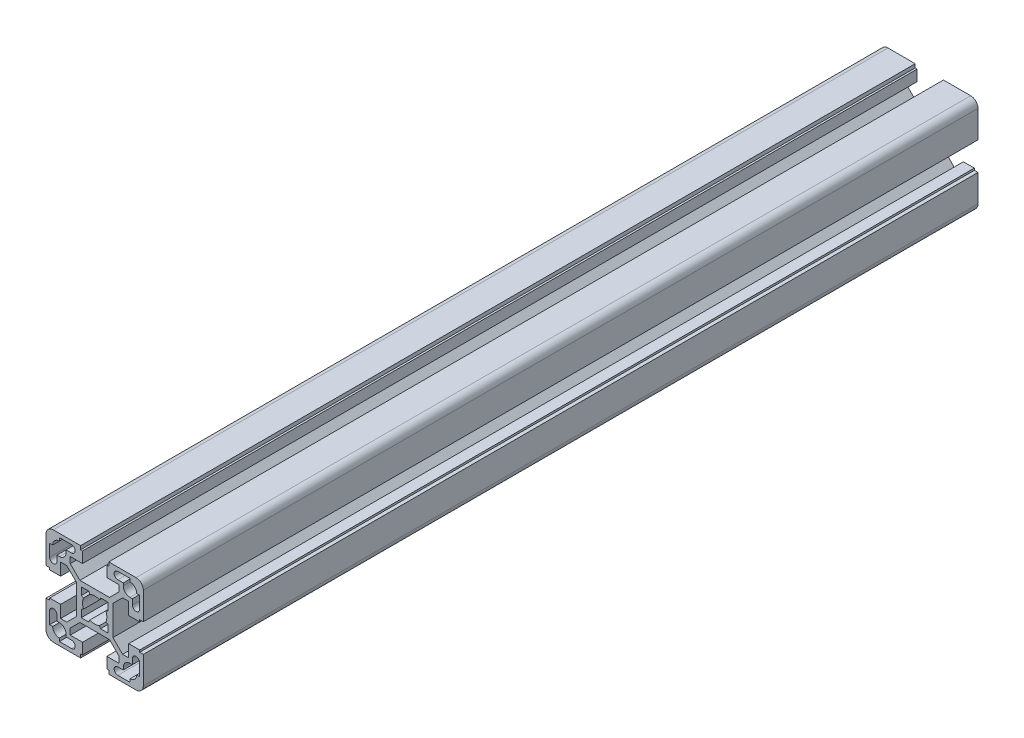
ISO-10303-21;
HEADER;
FILE_DESCRIPTION(('STEP AP214'),'2;1');
FILE_NAME('part.step','',(''),(''),'','','');
FILE_SCHEMA(('AUTOMOTIVE_DESIGN { 1 0 10303 214 1 1 1 1 }'));
ENDSEC;
DATA;
#1=APPLICATION_CONTEXT('core data for automotive mechanical design processes');
#2=APPLICATION_PROTOCOL_DEFINITION('international standard','automotive_design',2000,#1);
#3=PRODUCT_CONTEXT('',#1,'mechanical');
#4=PRODUCT('Part','Part','',(#3));
#5=PRODUCT_RELATED_PRODUCT_CATEGORY('part','',(#4));
#6=PRODUCT_DEFINITION_FORMATION('','',#4);
#7=PRODUCT_DEFINITION_CONTEXT('part definition',#1,'design');
#8=PRODUCT_DEFINITION('design','',#6,#7);
#9=PRODUCT_DEFINITION_SHAPE('','',#8);
#10=(LENGTH_UNIT() NAMED_UNIT(*) SI_UNIT(.MILLI.,.METRE.));
#11=(NAMED_UNIT(*) PLANE_ANGLE_UNIT() SI_UNIT($,.RADIAN.));
#12=(NAMED_UNIT(*) SI_UNIT($,.STERADIAN.) SOLID_ANGLE_UNIT());
#13=UNCERTAINTY_MEASURE_WITH_UNIT(LENGTH_MEASURE(1.E-05),#10,'distance_accuracy_value','');
#14=(GEOMETRIC_REPRESENTATION_CONTEXT(3) GLOBAL_UNCERTAINTY_ASSIGNED_CONTEXT((#13)) GLOBAL_UNIT_ASSIGNED_CONTEXT((#10,
#11,#12)) REPRESENTATION_CONTEXT('',''));
#15=CARTESIAN_POINT('',(0.,0.,0.));
#16=DIRECTION('',(0.,0.,1.));
#17=DIRECTION('',(1.,0.,0.));
#18=AXIS2_PLACEMENT_3D('',#15,#16,#17);
#19=CARTESIAN_POINT('',(-14.5000000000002,-11.75,343.));
#20=DIRECTION('',(0.,-1.,0.));
#21=DIRECTION('',(1.,0.,0.));
#22=AXIS2_PLACEMENT_3D('',#19,#20,#21);
#23=PLANE('',#22);
#24=DIRECTION('',(1.,0.,0.));
#25=VECTOR('',#24,1.);
#26=CARTESIAN_POINT('',(-14.5000000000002,-11.75,343.));
#27=LINE('',#26,#25);
#28=CARTESIAN_POINT('',(-14.5000000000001,-11.75,343.));
#29=VERTEX_POINT('',#28);
#30=CARTESIAN_POINT('',(-15.5000000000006,-11.75,343.));
#31=VERTEX_POINT('',#30);
#32=EDGE_CURVE('E806',#29,#31,#27,.F.);
#33=ORIENTED_EDGE('',*,*,#32,.T.);
#34=DIRECTION('',(0.,0.,1.));
#35=VECTOR('',#34,1.);
#36=CARTESIAN_POINT('',(-15.5000000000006,-11.75,343.));
#37=LINE('',#36,#35);
#38=CARTESIAN_POINT('',(-15.5000000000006,-11.75,0.));
#39=VERTEX_POINT('',#38);
#40=EDGE_CURVE('E804',#39,#31,#37,.T.);
#41=ORIENTED_EDGE('',*,*,#40,.F.);
#42=DIRECTION('',(1.,0.,0.));
#43=VECTOR('',#42,1.);
#44=CARTESIAN_POINT('',(-14.5000000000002,-11.75,0.));
#45=LINE('',#44,#43);
#46=CARTESIAN_POINT('',(-14.5000000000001,-11.75,0.));
#47=VERTEX_POINT('',#46);
#48=EDGE_CURVE('E20',#39,#47,#45,.T.);
#49=ORIENTED_EDGE('',*,*,#48,.T.);
#50=DIRECTION('',(0.,0.,-1.));
#51=VECTOR('',#50,1.);
#52=CARTESIAN_POINT('',(-14.5000000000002,-11.75,343.));
#53=LINE('',#52,#51);
#54=EDGE_CURVE('E801',#47,#29,#53,.F.);
#55=ORIENTED_EDGE('',*,*,#54,.T.);
#56=EDGE_LOOP('',(#33,#41,#49,#55));
#57=FACE_BOUND('',#56,.T.);
#58=ADVANCED_FACE('F17',(#57),#23,.T.);
#59=CARTESIAN_POINT('',(-11.7500000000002,-15.5,343.));
#60=DIRECTION('',(-1.,0.,0.));
#61=DIRECTION('',(0.,-1.,0.));
#62=AXIS2_PLACEMENT_3D('',#59,#60,#61);
#63=PLANE('',#62);
#64=DIRECTION('',(0.,-1.,0.));
#65=VECTOR('',#64,1.);
#66=CARTESIAN_POINT('',(-11.7500000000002,-15.5,343.));
#67=LINE('',#66,#65);
#68=CARTESIAN_POINT('',(-11.7500000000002,-15.5,343.));
#69=VERTEX_POINT('',#68);
#70=CARTESIAN_POINT('',(-11.7500000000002,-14.5,343.));
#71=VERTEX_POINT('',#70);
#72=EDGE_CURVE('E1218',#69,#71,#67,.F.);
#73=ORIENTED_EDGE('',*,*,#72,.T.);
#74=DIRECTION('',(0.,0.,-1.));
#75=VECTOR('',#74,1.);
#76=CARTESIAN_POINT('',(-11.7500000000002,-14.5,343.));
#77=LINE('',#76,#75);
#78=CARTESIAN_POINT('',(-11.7500000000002,-14.5,0.));
#79=VERTEX_POINT('',#78);
#80=EDGE_CURVE('E814',#71,#79,#77,.T.);
#81=ORIENTED_EDGE('',*,*,#80,.T.);
#82=DIRECTION('',(0.,-1.,0.));
#83=VECTOR('',#82,1.);
#84=CARTESIAN_POINT('',(-11.7500000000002,-15.5,0.));
#85=LINE('',#84,#83);
#86=CARTESIAN_POINT('',(-11.7500000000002,-15.5,0.));
#87=VERTEX_POINT('',#86);
#88=EDGE_CURVE('E819',#79,#87,#85,.T.);
#89=ORIENTED_EDGE('',*,*,#88,.T.);
#90=DIRECTION('',(0.,0.,-1.));
#91=VECTOR('',#90,1.);
#92=CARTESIAN_POINT('',(-11.7500000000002,-15.5,343.));
#93=LINE('',#92,#91);
#94=EDGE_CURVE('E1262',#69,#87,#93,.T.);
#95=ORIENTED_EDGE('',*,*,#94,.F.);
#96=EDGE_LOOP('',(#73,#81,#89,#95));
#97=FACE_BOUND('',#96,.T.);
#98=ADVANCED_FACE('F1555',(#97),#63,.T.);
#99=CARTESIAN_POINT('',(-14.5000000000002,-17.25,343.));
#100=DIRECTION('',(1.,0.,0.));
#101=DIRECTION('',(0.,0.,-1.));
#102=AXIS2_PLACEMENT_3D('',#99,#100,#101);
#103=PLANE('',#102);
#104=DIRECTION('',(0.,1.,0.));
#105=VECTOR('',#104,1.);
#106=CARTESIAN_POINT('',(-14.5000000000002,-17.25,343.));
#107=LINE('',#106,#105);
#108=CARTESIAN_POINT('',(-14.5000000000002,-17.25,343.));
#109=VERTEX_POINT('',#108);
#110=CARTESIAN_POINT('',(-14.5000000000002,-18.5,343.));
#111=VERTEX_POINT('',#110);
#112=EDGE_CURVE('E1214',#109,#111,#107,.F.);
#113=ORIENTED_EDGE('',*,*,#112,.T.);
#114=DIRECTION('',(0.,0.,1.));
#115=VECTOR('',#114,1.);
#116=CARTESIAN_POINT('',(-14.5000000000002,-18.5,343.));
#117=LINE('',#116,#115);
#118=CARTESIAN_POINT('',(-14.5000000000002,-18.5,0.));
#119=VERTEX_POINT('',#118);
#120=EDGE_CURVE('E1256',#119,#111,#117,.T.);
#121=ORIENTED_EDGE('',*,*,#120,.F.);
#122=DIRECTION('',(0.,1.,0.));
#123=VECTOR('',#122,1.);
#124=CARTESIAN_POINT('',(-14.5000000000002,-17.25,0.));
#125=LINE('',#124,#123);
#126=CARTESIAN_POINT('',(-14.5000000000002,-17.25,0.));
#127=VERTEX_POINT('',#126);
#128=EDGE_CURVE('E1216',#119,#127,#125,.T.);
#129=ORIENTED_EDGE('',*,*,#128,.T.);
#130=DIRECTION('',(0.,0.,-1.));
#131=VECTOR('',#130,1.);
#132=CARTESIAN_POINT('',(-14.5000000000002,-17.25,343.));
#133=LINE('',#132,#131);
#134=EDGE_CURVE('E1251',#127,#109,#133,.F.);
#135=ORIENTED_EDGE('',*,*,#134,.T.);
#136=EDGE_LOOP('',(#113,#121,#129,#135));
#137=FACE_BOUND('',#136,.T.);
#138=ADVANCED_FACE('F1560',(#137),#103,.T.);
#139=CARTESIAN_POINT('',(-18.5000000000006,-14.5000000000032,343.));
#140=DIRECTION('',(0.,1.,0.));
#141=DIRECTION('',(0.,0.,1.));
#142=AXIS2_PLACEMENT_3D('',#139,#140,#141);
#143=PLANE('',#142);
#144=DIRECTION('',(1.,0.,0.));
#145=VECTOR('',#144,1.);
#146=CARTESIAN_POINT('',(-18.5000000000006,-14.5000000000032,343.));
#147=LINE('',#146,#145);
#148=CARTESIAN_POINT('',(-18.5000000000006,-14.5000000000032,343.));
#149=VERTEX_POINT('',#148);
#150=CARTESIAN_POINT('',(-17.2500000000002,-14.5000000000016,343.));
#151=VERTEX_POINT('',#150);
#152=EDGE_CURVE('E1210',#149,#151,#147,.T.);
#153=ORIENTED_EDGE('',*,*,#152,.T.);
#154=DIRECTION('',(0.,0.,-1.));
#155=VECTOR('',#154,1.);
#156=CARTESIAN_POINT('',(-17.2500000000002,-14.5,343.));
#157=LINE('',#156,#155);
#158=CARTESIAN_POINT('',(-17.2500000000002,-14.5000000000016,0.));
#159=VERTEX_POINT('',#158);
#160=EDGE_CURVE('E1248',#151,#159,#157,.T.);
#161=ORIENTED_EDGE('',*,*,#160,.T.);
#162=DIRECTION('',(1.,0.,0.));
#163=VECTOR('',#162,1.);
#164=CARTESIAN_POINT('',(-18.5000000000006,-14.5000000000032,0.));
#165=LINE('',#164,#163);
#166=CARTESIAN_POINT('',(-18.5000000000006,-14.5000000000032,0.));
#167=VERTEX_POINT('',#166);
#168=EDGE_CURVE('E1212',#159,#167,#165,.F.);
#169=ORIENTED_EDGE('',*,*,#168,.T.);
#170=DIRECTION('',(0.,0.,-1.));
#171=VECTOR('',#170,1.);
#172=CARTESIAN_POINT('',(-18.5000000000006,-14.5000000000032,343.));
#173=LINE('',#172,#171);
#174=EDGE_CURVE('E1242',#149,#167,#173,.T.);
#175=ORIENTED_EDGE('',*,*,#174,.F.);
#176=EDGE_LOOP('',(#153,#161,#169,#175));
#177=FACE_BOUND('',#176,.T.);
#178=ADVANCED_FACE('F1569',(#177),#143,.T.);
#179=CARTESIAN_POINT('',(18.5000000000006,-14.5000000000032,343.));
#180=DIRECTION('',(0.,1.,0.));
#181=DIRECTION('',(0.,0.,1.));
#182=AXIS2_PLACEMENT_3D('',#179,#180,#181);
#183=PLANE('',#182);
#184=DIRECTION('',(1.,0.,0.));
#185=VECTOR('',#184,1.);
#186=CARTESIAN_POINT('',(18.5000000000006,-14.5000000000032,343.));
#187=LINE('',#186,#185);
#188=CARTESIAN_POINT('',(17.2500000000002,-14.5000000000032,343.));
#189=VERTEX_POINT('',#188);
#190=CARTESIAN_POINT('',(18.5000000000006,-14.5000000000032,343.));
#191=VERTEX_POINT('',#190);
#192=EDGE_CURVE('E1206',#189,#191,#187,.T.);
#193=ORIENTED_EDGE('',*,*,#192,.T.);
#194=DIRECTION('',(0.,0.,1.));
#195=VECTOR('',#194,1.);
#196=CARTESIAN_POINT('',(18.5000000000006,-14.5000000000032,343.));
#197=LINE('',#196,#195);
#198=CARTESIAN_POINT('',(18.5000000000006,-14.5000000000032,0.));
#199=VERTEX_POINT('',#198);
#200=EDGE_CURVE('E1947',#199,#191,#197,.T.);
#201=ORIENTED_EDGE('',*,*,#200,.F.);
#202=DIRECTION('',(1.,0.,0.));
#203=VECTOR('',#202,1.);
#204=CARTESIAN_POINT('',(18.5000000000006,-14.5000000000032,0.));
#205=LINE('',#204,#203);
#206=CARTESIAN_POINT('',(17.2500000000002,-14.5000000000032,0.));
#207=VERTEX_POINT('',#206);
#208=EDGE_CURVE('E1208',#199,#207,#205,.F.);
#209=ORIENTED_EDGE('',*,*,#208,.T.);
#210=DIRECTION('',(0.,0.,-1.));
#211=VECTOR('',#210,1.);
#212=CARTESIAN_POINT('',(17.2500000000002,-14.5000000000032,343.));
#213=LINE('',#212,#211);
#214=EDGE_CURVE('E1952',#207,#189,#213,.F.);
#215=ORIENTED_EDGE('',*,*,#214,.T.);
#216=EDGE_LOOP('',(#193,#201,#209,#215));
#217=FACE_BOUND('',#216,.T.);
#218=ADVANCED_FACE('F2472',(#217),#183,.T.);
#219=CARTESIAN_POINT('',(14.5000000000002,-17.25,343.));
#220=DIRECTION('',(-1.,0.,0.));
#221=DIRECTION('',(0.,0.,1.));
#222=AXIS2_PLACEMENT_3D('',#219,#220,#221);
#223=PLANE('',#222);
#224=DIRECTION('',(0.,1.,0.));
#225=VECTOR('',#224,1.);
#226=CARTESIAN_POINT('',(14.5000000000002,-17.25,343.));
#227=LINE('',#226,#225);
#228=CARTESIAN_POINT('',(14.5000000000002,-18.5,343.));
#229=VERTEX_POINT('',#228);
#230=CARTESIAN_POINT('',(14.5000000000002,-17.25,343.));
#231=VERTEX_POINT('',#230);
#232=EDGE_CURVE('E1202',#229,#231,#227,.T.);
#233=ORIENTED_EDGE('',*,*,#232,.T.);
#234=DIRECTION('',(0.,0.,-1.));
#235=VECTOR('',#234,1.);
#236=CARTESIAN_POINT('',(14.5000000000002,-17.25,343.));
#237=LINE('',#236,#235);
#238=CARTESIAN_POINT('',(14.5000000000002,-17.25,0.));
#239=VERTEX_POINT('',#238);
#240=EDGE_CURVE('E1955',#231,#239,#237,.T.);
#241=ORIENTED_EDGE('',*,*,#240,.T.);
#242=DIRECTION('',(0.,1.,0.));
#243=VECTOR('',#242,1.);
#244=CARTESIAN_POINT('',(14.5000000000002,-17.25,0.));
#245=LINE('',#244,#243);
#246=CARTESIAN_POINT('',(14.5000000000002,-18.5,0.));
#247=VERTEX_POINT('',#246);
#248=EDGE_CURVE('E1204',#239,#247,#245,.F.);
#249=ORIENTED_EDGE('',*,*,#248,.T.);
#250=DIRECTION('',(0.,0.,1.));
#251=VECTOR('',#250,1.);
#252=CARTESIAN_POINT('',(14.5000000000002,-18.5,343.));
#253=LINE('',#252,#251);
#254=EDGE_CURVE('E1958',#229,#247,#253,.F.);
#255=ORIENTED_EDGE('',*,*,#254,.F.);
#256=EDGE_LOOP('',(#233,#241,#249,#255));
#257=FACE_BOUND('',#256,.T.);
#258=ADVANCED_FACE('F2468',(#257),#223,.T.);
#259=CARTESIAN_POINT('',(11.7500000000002,-15.5,343.));
#260=DIRECTION('',(1.,0.,0.));
#261=DIRECTION('',(0.,1.,0.));
#262=AXIS2_PLACEMENT_3D('',#259,#260,#261);
#263=PLANE('',#262);
#264=DIRECTION('',(0.,1.,0.));
#265=VECTOR('',#264,1.);
#266=CARTESIAN_POINT('',(11.7500000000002,-15.5,343.));
#267=LINE('',#266,#265);
#268=CARTESIAN_POINT('',(11.7500000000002,-14.5,343.));
#269=VERTEX_POINT('',#268);
#270=CARTESIAN_POINT('',(11.7500000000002,-15.5,343.));
#271=VERTEX_POINT('',#270);
#272=EDGE_CURVE('E1198',#269,#271,#267,.F.);
#273=ORIENTED_EDGE('',*,*,#272,.T.);
#274=DIRECTION('',(0.,0.,-1.));
#275=VECTOR('',#274,1.);
#276=CARTESIAN_POINT('',(11.7500000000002,-15.5,343.));
#277=LINE('',#276,#275);
#278=CARTESIAN_POINT('',(11.7500000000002,-15.5,0.));
#279=VERTEX_POINT('',#278);
#280=EDGE_CURVE('E1964',#279,#271,#277,.F.);
#281=ORIENTED_EDGE('',*,*,#280,.F.);
#282=DIRECTION('',(0.,1.,0.));
#283=VECTOR('',#282,1.);
#284=CARTESIAN_POINT('',(11.7500000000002,-15.5,0.));
#285=LINE('',#284,#283);
#286=CARTESIAN_POINT('',(11.7500000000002,-14.5,0.));
#287=VERTEX_POINT('',#286);
#288=EDGE_CURVE('E1200',#279,#287,#285,.T.);
#289=ORIENTED_EDGE('',*,*,#288,.T.);
#290=DIRECTION('',(0.,0.,-1.));
#291=VECTOR('',#290,1.);
#292=CARTESIAN_POINT('',(11.7500000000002,-14.5,343.));
#293=LINE('',#292,#291);
#294=EDGE_CURVE('E1969',#287,#269,#293,.F.);
#295=ORIENTED_EDGE('',*,*,#294,.T.);
#296=EDGE_LOOP('',(#273,#281,#289,#295));
#297=FACE_BOUND('',#296,.T.);
#298=ADVANCED_FACE('F2465',(#297),#263,.T.);
#299=CARTESIAN_POINT('',(14.5000000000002,-11.75,343.));
#300=DIRECTION('',(0.,-1.,0.));
#301=DIRECTION('',(1.,0.,0.));
#302=AXIS2_PLACEMENT_3D('',#299,#300,#301);
#303=PLANE('',#302);
#304=DIRECTION('',(1.,0.,0.));
#305=VECTOR('',#304,1.);
#306=CARTESIAN_POINT('',(14.5000000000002,-11.75,343.));
#307=LINE('',#306,#305);
#308=CARTESIAN_POINT('',(15.5000000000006,-11.75,343.));
#309=VERTEX_POINT('',#308);
#310=CARTESIAN_POINT('',(14.5000000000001,-11.75,343.));
#311=VERTEX_POINT('',#310);
#312=EDGE_CURVE('E1194',#309,#311,#307,.F.);
#313=ORIENTED_EDGE('',*,*,#312,.T.);
#314=DIRECTION('',(0.,0.,-1.));
#315=VECTOR('',#314,1.);
#316=CARTESIAN_POINT('',(14.5000000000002,-11.75,343.));
#317=LINE('',#316,#315);
#318=CARTESIAN_POINT('',(14.5000000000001,-11.75,0.));
#319=VERTEX_POINT('',#318);
#320=EDGE_CURVE('E1940',#311,#319,#317,.T.);
#321=ORIENTED_EDGE('',*,*,#320,.T.);
#322=DIRECTION('',(1.,0.,0.));
#323=VECTOR('',#322,1.);
#324=CARTESIAN_POINT('',(14.5000000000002,-11.75,0.));
#325=LINE('',#324,#323);
#326=CARTESIAN_POINT('',(15.5000000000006,-11.75,0.));
#327=VERTEX_POINT('',#326);
#328=EDGE_CURVE('E1196',#319,#327,#325,.T.);
#329=ORIENTED_EDGE('',*,*,#328,.T.);
#330=DIRECTION('',(0.,0.,-1.));
#331=VECTOR('',#330,1.);
#332=CARTESIAN_POINT('',(15.5000000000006,-11.75,343.));
#333=LINE('',#332,#331);
#334=EDGE_CURVE('E1237',#309,#327,#333,.T.);
#335=ORIENTED_EDGE('',*,*,#334,.F.);
#336=EDGE_LOOP('',(#313,#321,#329,#335));
#337=FACE_BOUND('',#336,.T.);
#338=ADVANCED_FACE('F1939',(#337),#303,.T.);
#339=CARTESIAN_POINT('',(5.80000000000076,-18.5000000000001,343.));
#340=DIRECTION('',(1.,0.,0.));
#341=DIRECTION('',(0.,0.,-1.));
#342=AXIS2_PLACEMENT_3D('',#339,#340,#341);
#343=PLANE('',#342);
#344=DIRECTION('',(0.,0.,1.));
#345=VECTOR('',#344,1.);
#346=CARTESIAN_POINT('',(5.80000000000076,-20.,343.));
#347=LINE('',#346,#345);
#348=CARTESIAN_POINT('',(5.80000000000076,-20.,0.));
#349=VERTEX_POINT('',#348);
#350=CARTESIAN_POINT('',(5.80000000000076,-20.,343.));
#351=VERTEX_POINT('',#350);
#352=EDGE_CURVE('E1973',#349,#351,#347,.T.);
#353=ORIENTED_EDGE('',*,*,#352,.T.);
#354=DIRECTION('',(0.,1.,0.));
#355=VECTOR('',#354,1.);
#356=CARTESIAN_POINT('',(5.80000000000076,-17.,343.));
#357=LINE('',#356,#355);
#358=CARTESIAN_POINT('',(5.80000000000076,-18.5000000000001,343.));
#359=VERTEX_POINT('',#358);
#360=EDGE_CURVE('E1192',#359,#351,#357,.F.);
#361=ORIENTED_EDGE('',*,*,#360,.F.);
#362=DIRECTION('',(0.,0.,1.));
#363=VECTOR('',#362,1.);
#364=CARTESIAN_POINT('',(5.80000000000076,-18.5000000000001,343.));
#365=LINE('',#364,#363);
#366=CARTESIAN_POINT('',(5.80000000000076,-18.5000000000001,0.));
#367=VERTEX_POINT('',#366);
#368=EDGE_CURVE('E1116',#359,#367,#365,.F.);
#369=ORIENTED_EDGE('',*,*,#368,.T.);
#370=DIRECTION('',(0.,1.,0.));
#371=VECTOR('',#370,1.);
#372=CARTESIAN_POINT('',(5.80000000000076,-17.,0.));
#373=LINE('',#372,#371);
#374=EDGE_CURVE('E1190',#349,#367,#373,.T.);
#375=ORIENTED_EDGE('',*,*,#374,.F.);
#376=EDGE_LOOP('',(#353,#361,#369,#375));
#377=FACE_BOUND('',#376,.T.);
#378=ADVANCED_FACE('F2286',(#377),#343,.F.);
#379=CARTESIAN_POINT('',(20.,-5.79999999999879,343.));
#380=DIRECTION('',(0.,-1.,0.));
#381=DIRECTION('',(0.,0.,-1.));
#382=AXIS2_PLACEMENT_3D('',#379,#380,#381);
#383=PLANE('',#382);
#384=DIRECTION('',(0.,0.,1.));
#385=VECTOR('',#384,1.);
#386=CARTESIAN_POINT('',(18.5,-5.79999999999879,343.));
#387=LINE('',#386,#385);
#388=CARTESIAN_POINT('',(18.5,-5.79999999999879,0.));
#389=VERTEX_POINT('',#388);
#390=CARTESIAN_POINT('',(18.5,-5.79999999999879,343.));
#391=VERTEX_POINT('',#390);
#392=EDGE_CURVE('E1185',#389,#391,#387,.T.);
#393=ORIENTED_EDGE('',*,*,#392,.T.);
#394=DIRECTION('',(1.,0.,0.));
#395=VECTOR('',#394,1.);
#396=CARTESIAN_POINT('',(17.,-5.79999999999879,343.));
#397=LINE('',#396,#395);
#398=CARTESIAN_POINT('',(20.,-5.79999999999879,343.));
#399=VERTEX_POINT('',#398);
#400=EDGE_CURVE('E1188',#399,#391,#397,.F.);
#401=ORIENTED_EDGE('',*,*,#400,.F.);
#402=DIRECTION('',(0.,0.,1.));
#403=VECTOR('',#402,1.);
#404=CARTESIAN_POINT('',(20.,-5.79999999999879,343.));
#405=LINE('',#404,#403);
#406=CARTESIAN_POINT('',(20.,-5.79999999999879,0.));
#407=VERTEX_POINT('',#406);
#408=EDGE_CURVE('E1981',#399,#407,#405,.F.);
#409=ORIENTED_EDGE('',*,*,#408,.T.);
#410=DIRECTION('',(1.,0.,0.));
#411=VECTOR('',#410,1.);
#412=CARTESIAN_POINT('',(17.,-5.79999999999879,0.));
#413=LINE('',#412,#411);
#414=EDGE_CURVE('E1186',#389,#407,#413,.T.);
#415=ORIENTED_EDGE('',*,*,#414,.F.);
#416=EDGE_LOOP('',(#393,#401,#409,#415));
#417=FACE_BOUND('',#416,.T.);
#418=ADVANCED_FACE('F2294',(#417),#383,.F.);
#419=CARTESIAN_POINT('',(18.5,-5.79999999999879,343.));
#420=DIRECTION('',(-1.,0.,0.));
#421=DIRECTION('',(0.,0.,1.));
#422=AXIS2_PLACEMENT_3D('',#419,#420,#421);
#423=PLANE('',#422);
#424=DIRECTION('',(0.,0.,-1.));
#425=VECTOR('',#424,1.);
#426=CARTESIAN_POINT('',(18.5,-4.99999999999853,343.));
#427=LINE('',#426,#425);
#428=CARTESIAN_POINT('',(18.5,-4.99999999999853,0.));
#429=VERTEX_POINT('',#428);
#430=CARTESIAN_POINT('',(18.5,-4.99999999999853,343.));
#431=VERTEX_POINT('',#430);
#432=EDGE_CURVE('E1984',#429,#431,#427,.F.);
#433=ORIENTED_EDGE('',*,*,#432,.T.);
#434=DIRECTION('',(0.,1.,0.));
#435=VECTOR('',#434,1.);
#436=CARTESIAN_POINT('',(18.5,-17.,343.));
#437=LINE('',#436,#435);
#438=EDGE_CURVE('E1183',#391,#431,#437,.T.);
#439=ORIENTED_EDGE('',*,*,#438,.F.);
#440=ORIENTED_EDGE('',*,*,#392,.F.);
#441=DIRECTION('',(0.,1.,0.));
#442=VECTOR('',#441,1.);
#443=CARTESIAN_POINT('',(18.5,-17.,0.));
#444=LINE('',#443,#442);
#445=EDGE_CURVE('E1180',#429,#389,#444,.F.);
#446=ORIENTED_EDGE('',*,*,#445,.F.);
#447=EDGE_LOOP('',(#433,#439,#440,#446));
#448=FACE_BOUND('',#447,.T.);
#449=ADVANCED_FACE('F2297',(#448),#423,.F.);
#450=CARTESIAN_POINT('',(18.5,5.79999999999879,343.));
#451=DIRECTION('',(-1.,0.,0.));
#452=DIRECTION('',(0.,0.,1.));
#453=AXIS2_PLACEMENT_3D('',#450,#451,#452);
#454=PLANE('',#453);
#455=DIRECTION('',(0.,0.,1.));
#456=VECTOR('',#455,1.);
#457=CARTESIAN_POINT('',(18.5,5.79999999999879,343.));
#458=LINE('',#457,#456);
#459=CARTESIAN_POINT('',(18.5,5.79999999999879,0.));
#460=VERTEX_POINT('',#459);
#461=CARTESIAN_POINT('',(18.5,5.79999999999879,343.));
#462=VERTEX_POINT('',#461);
#463=EDGE_CURVE('E1175',#460,#462,#458,.T.);
#464=ORIENTED_EDGE('',*,*,#463,.T.);
#465=DIRECTION('',(0.,1.,0.));
#466=VECTOR('',#465,1.);
#467=CARTESIAN_POINT('',(18.5,-17.,343.));
#468=LINE('',#467,#466);
#469=CARTESIAN_POINT('',(18.5,4.99999999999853,343.));
#470=VERTEX_POINT('',#469);
#471=EDGE_CURVE('E1178',#470,#462,#468,.T.);
#472=ORIENTED_EDGE('',*,*,#471,.F.);
#473=DIRECTION('',(0.,0.,1.));
#474=VECTOR('',#473,1.);
#475=CARTESIAN_POINT('',(18.5,4.99999999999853,343.));
#476=LINE('',#475,#474);
#477=CARTESIAN_POINT('',(18.5,4.99999999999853,0.));
#478=VERTEX_POINT('',#477);
#479=EDGE_CURVE('E2011',#470,#478,#476,.F.);
#480=ORIENTED_EDGE('',*,*,#479,.T.);
#481=DIRECTION('',(0.,1.,0.));
#482=VECTOR('',#481,1.);
#483=CARTESIAN_POINT('',(18.5,-17.,0.));
#484=LINE('',#483,#482);
#485=EDGE_CURVE('E1176',#460,#478,#484,.F.);
#486=ORIENTED_EDGE('',*,*,#485,.F.);
#487=EDGE_LOOP('',(#464,#472,#480,#486));
#488=FACE_BOUND('',#487,.T.);
#489=ADVANCED_FACE('F2319',(#488),#454,.F.);
#490=CARTESIAN_POINT('',(20.,5.79999999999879,343.));
#491=DIRECTION('',(0.,1.,0.));
#492=DIRECTION('',(0.,0.,1.));
#493=AXIS2_PLACEMENT_3D('',#490,#491,#492);
#494=PLANE('',#493);
#495=DIRECTION('',(0.,0.,1.));
#496=VECTOR('',#495,1.);
#497=CARTESIAN_POINT('',(20.,5.79999999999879,343.));
#498=LINE('',#497,#496);
#499=CARTESIAN_POINT('',(20.,5.79999999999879,0.));
#500=VERTEX_POINT('',#499);
#501=CARTESIAN_POINT('',(20.,5.79999999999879,343.));
#502=VERTEX_POINT('',#501);
#503=EDGE_CURVE('E2014',#500,#502,#498,.T.);
#504=ORIENTED_EDGE('',*,*,#503,.T.);
#505=DIRECTION('',(1.,0.,0.));
#506=VECTOR('',#505,1.);
#507=CARTESIAN_POINT('',(17.,5.79999999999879,343.));
#508=LINE('',#507,#506);
#509=EDGE_CURVE('E1173',#462,#502,#508,.T.);
#510=ORIENTED_EDGE('',*,*,#509,.F.);
#511=ORIENTED_EDGE('',*,*,#463,.F.);
#512=DIRECTION('',(1.,0.,0.));
#513=VECTOR('',#512,1.);
#514=CARTESIAN_POINT('',(17.,5.79999999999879,0.));
#515=LINE('',#514,#513);
#516=EDGE_CURVE('E1170',#500,#460,#515,.F.);
#517=ORIENTED_EDGE('',*,*,#516,.F.);
#518=EDGE_LOOP('',(#504,#510,#511,#517));
#519=FACE_BOUND('',#518,.T.);
#520=ADVANCED_FACE('F2323',(#519),#494,.F.);
#521=CARTESIAN_POINT('',(5.80000000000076,18.5000000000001,343.));
#522=DIRECTION('',(1.,0.,0.));
#523=DIRECTION('',(0.,0.,-1.));
#524=AXIS2_PLACEMENT_3D('',#521,#522,#523);
#525=PLANE('',#524);
#526=DIRECTION('',(0.,0.,-1.));
#527=VECTOR('',#526,1.);
#528=CARTESIAN_POINT('',(5.80000000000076,18.5000000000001,343.));
#529=LINE('',#528,#527);
#530=CARTESIAN_POINT('',(5.80000000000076,18.5000000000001,0.));
#531=VERTEX_POINT('',#530);
#532=CARTESIAN_POINT('',(5.80000000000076,18.5000000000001,343.));
#533=VERTEX_POINT('',#532);
#534=EDGE_CURVE('E1165',#531,#533,#529,.F.);
#535=ORIENTED_EDGE('',*,*,#534,.T.);
#536=DIRECTION('',(0.,1.,0.));
#537=VECTOR('',#536,1.);
#538=CARTESIAN_POINT('',(5.80000000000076,-17.,343.));
#539=LINE('',#538,#537);
#540=CARTESIAN_POINT('',(5.80000000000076,20.,343.));
#541=VERTEX_POINT('',#540);
#542=EDGE_CURVE('E1168',#541,#533,#539,.F.);
#543=ORIENTED_EDGE('',*,*,#542,.F.);
#544=DIRECTION('',(0.,0.,-1.));
#545=VECTOR('',#544,1.);
#546=CARTESIAN_POINT('',(5.80000000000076,20.,343.));
#547=LINE('',#546,#545);
#548=CARTESIAN_POINT('',(5.80000000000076,20.,0.));
#549=VERTEX_POINT('',#548);
#550=EDGE_CURVE('E2022',#541,#549,#547,.T.);
#551=ORIENTED_EDGE('',*,*,#550,.T.);
#552=DIRECTION('',(0.,1.,0.));
#553=VECTOR('',#552,1.);
#554=CARTESIAN_POINT('',(5.80000000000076,-17.,0.));
#555=LINE('',#554,#553);
#556=EDGE_CURVE('E1166',#531,#549,#555,.T.);
#557=ORIENTED_EDGE('',*,*,#556,.F.);
#558=EDGE_LOOP('',(#535,#543,#551,#557));
#559=FACE_BOUND('',#558,.T.);
#560=ADVANCED_FACE('F2334',(#559),#525,.F.);
#561=CARTESIAN_POINT('',(5.00000000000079,18.5000000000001,343.));
#562=DIRECTION('',(0.,-1.,0.));
#563=DIRECTION('',(0.,0.,-1.));
#564=AXIS2_PLACEMENT_3D('',#561,#562,#563);
#565=PLANE('',#564);
#566=DIRECTION('',(0.,0.,1.));
#567=VECTOR('',#566,1.);
#568=CARTESIAN_POINT('',(5.00000000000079,18.5000000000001,343.));
#569=LINE('',#568,#567);
#570=CARTESIAN_POINT('',(5.00000000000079,18.5000000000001,0.));
#571=VERTEX_POINT('',#570);
#572=CARTESIAN_POINT('',(5.00000000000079,18.5000000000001,343.));
#573=VERTEX_POINT('',#572);
#574=EDGE_CURVE('E2025',#571,#573,#569,.T.);
#575=ORIENTED_EDGE('',*,*,#574,.T.);
#576=DIRECTION('',(1.,0.,0.));
#577=VECTOR('',#576,1.);
#578=CARTESIAN_POINT('',(17.,18.5000000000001,343.));
#579=LINE('',#578,#577);
#580=EDGE_CURVE('E1163',#533,#573,#579,.F.);
#581=ORIENTED_EDGE('',*,*,#580,.F.);
#582=ORIENTED_EDGE('',*,*,#534,.F.);
#583=DIRECTION('',(1.,0.,0.));
#584=VECTOR('',#583,1.);
#585=CARTESIAN_POINT('',(17.,18.5000000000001,0.));
#586=LINE('',#585,#584);
#587=EDGE_CURVE('E1160',#571,#531,#586,.T.);
#588=ORIENTED_EDGE('',*,*,#587,.F.);
#589=EDGE_LOOP('',(#575,#581,#582,#588));
#590=FACE_BOUND('',#589,.T.);
#591=ADVANCED_FACE('F2338',(#590),#565,.F.);
#592=CARTESIAN_POINT('',(-5.00000000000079,18.5000000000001,343.));
#593=DIRECTION('',(0.,-1.,0.));
#594=DIRECTION('',(0.,0.,-1.));
#595=AXIS2_PLACEMENT_3D('',#592,#593,#594);
#596=PLANE('',#595);
#597=DIRECTION('',(0.,0.,1.));
#598=VECTOR('',#597,1.);
#599=CARTESIAN_POINT('',(-5.80000000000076,18.5000000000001,343.));
#600=LINE('',#599,#598);
#601=CARTESIAN_POINT('',(-5.80000000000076,18.5000000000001,0.));
#602=VERTEX_POINT('',#601);
#603=CARTESIAN_POINT('',(-5.80000000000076,18.5000000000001,343.));
#604=VERTEX_POINT('',#603);
#605=EDGE_CURVE('E1155',#602,#604,#600,.T.);
#606=ORIENTED_EDGE('',*,*,#605,.T.);
#607=DIRECTION('',(1.,0.,0.));
#608=VECTOR('',#607,1.);
#609=CARTESIAN_POINT('',(17.,18.5000000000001,343.));
#610=LINE('',#609,#608);
#611=CARTESIAN_POINT('',(-5.00000000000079,18.5000000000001,343.));
#612=VERTEX_POINT('',#611);
#613=EDGE_CURVE('E1158',#612,#604,#610,.F.);
#614=ORIENTED_EDGE('',*,*,#613,.F.);
#615=DIRECTION('',(0.,0.,1.));
#616=VECTOR('',#615,1.);
#617=CARTESIAN_POINT('',(-5.00000000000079,18.5000000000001,343.));
#618=LINE('',#617,#616);
#619=CARTESIAN_POINT('',(-5.00000000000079,18.5000000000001,0.));
#620=VERTEX_POINT('',#619);
#621=EDGE_CURVE('E2052',#612,#620,#618,.F.);
#622=ORIENTED_EDGE('',*,*,#621,.T.);
#623=DIRECTION('',(1.,0.,0.));
#624=VECTOR('',#623,1.);
#625=CARTESIAN_POINT('',(17.,18.5000000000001,0.));
#626=LINE('',#625,#624);
#627=EDGE_CURVE('E1156',#602,#620,#626,.T.);
#628=ORIENTED_EDGE('',*,*,#627,.F.);
#629=EDGE_LOOP('',(#606,#614,#622,#628));
#630=FACE_BOUND('',#629,.T.);
#631=ADVANCED_FACE('F2360',(#630),#596,.F.);
#632=CARTESIAN_POINT('',(-5.80000000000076,18.5000000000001,343.));
#633=DIRECTION('',(-1.,0.,0.));
#634=DIRECTION('',(0.,0.,1.));
#635=AXIS2_PLACEMENT_3D('',#632,#633,#634);
#636=PLANE('',#635);
#637=DIRECTION('',(0.,0.,1.));
#638=VECTOR('',#637,1.);
#639=CARTESIAN_POINT('',(-5.80000000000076,20.,343.));
#640=LINE('',#639,#638);
#641=CARTESIAN_POINT('',(-5.80000000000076,20.,0.));
#642=VERTEX_POINT('',#641);
#643=CARTESIAN_POINT('',(-5.80000000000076,20.,343.));
#644=VERTEX_POINT('',#643);
#645=EDGE_CURVE('E2055',#642,#644,#640,.T.);
#646=ORIENTED_EDGE('',*,*,#645,.T.);
#647=DIRECTION('',(0.,1.,0.));
#648=VECTOR('',#647,1.);
#649=CARTESIAN_POINT('',(-5.80000000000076,-17.,343.));
#650=LINE('',#649,#648);
#651=EDGE_CURVE('E1153',#604,#644,#650,.T.);
#652=ORIENTED_EDGE('',*,*,#651,.F.);
#653=ORIENTED_EDGE('',*,*,#605,.F.);
#654=DIRECTION('',(0.,1.,0.));
#655=VECTOR('',#654,1.);
#656=CARTESIAN_POINT('',(-5.80000000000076,-17.,0.));
#657=LINE('',#656,#655);
#658=EDGE_CURVE('E1150',#642,#602,#657,.F.);
#659=ORIENTED_EDGE('',*,*,#658,.F.);
#660=EDGE_LOOP('',(#646,#652,#653,#659));
#661=FACE_BOUND('',#660,.T.);
#662=ADVANCED_FACE('F2364',(#661),#636,.F.);
#663=CARTESIAN_POINT('',(-20.,5.79999999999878,343.));
#664=DIRECTION('',(0.,1.,0.));
#665=DIRECTION('',(0.,0.,1.));
#666=AXIS2_PLACEMENT_3D('',#663,#664,#665);
#667=PLANE('',#666);
#668=DIRECTION('',(0.,0.,-1.));
#669=VECTOR('',#668,1.);
#670=CARTESIAN_POINT('',(-18.5,5.79999999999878,343.));
#671=LINE('',#670,#669);
#672=CARTESIAN_POINT('',(-18.5,5.79999999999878,0.));
#673=VERTEX_POINT('',#672);
#674=CARTESIAN_POINT('',(-18.5,5.79999999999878,343.));
#675=VERTEX_POINT('',#674);
#676=EDGE_CURVE('E1145',#673,#675,#671,.F.);
#677=ORIENTED_EDGE('',*,*,#676,.T.);
#678=DIRECTION('',(1.,0.,0.));
#679=VECTOR('',#678,1.);
#680=CARTESIAN_POINT('',(17.,5.79999999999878,343.));
#681=LINE('',#680,#679);
#682=CARTESIAN_POINT('',(-20.,5.79999999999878,343.));
#683=VERTEX_POINT('',#682);
#684=EDGE_CURVE('E1148',#683,#675,#681,.T.);
#685=ORIENTED_EDGE('',*,*,#684,.F.);
#686=DIRECTION('',(0.,0.,1.));
#687=VECTOR('',#686,1.);
#688=CARTESIAN_POINT('',(-20.,5.79999999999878,343.));
#689=LINE('',#688,#687);
#690=CARTESIAN_POINT('',(-20.,5.79999999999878,0.));
#691=VERTEX_POINT('',#690);
#692=EDGE_CURVE('E2063',#683,#691,#689,.F.);
#693=ORIENTED_EDGE('',*,*,#692,.T.);
#694=DIRECTION('',(1.,0.,0.));
#695=VECTOR('',#694,1.);
#696=CARTESIAN_POINT('',(17.,5.79999999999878,0.));
#697=LINE('',#696,#695);
#698=EDGE_CURVE('E1146',#673,#691,#697,.F.);
#699=ORIENTED_EDGE('',*,*,#698,.F.);
#700=EDGE_LOOP('',(#677,#685,#693,#699));
#701=FACE_BOUND('',#700,.T.);
#702=ADVANCED_FACE('F2375',(#701),#667,.F.);
#703=CARTESIAN_POINT('',(-18.5,5.79999999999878,343.));
#704=DIRECTION('',(1.,0.,0.));
#705=DIRECTION('',(0.,0.,-1.));
#706=AXIS2_PLACEMENT_3D('',#703,#704,#705);
#707=PLANE('',#706);
#708=DIRECTION('',(0.,0.,1.));
#709=VECTOR('',#708,1.);
#710=CARTESIAN_POINT('',(-18.5,4.99999999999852,343.));
#711=LINE('',#710,#709);
#712=CARTESIAN_POINT('',(-18.5,4.99999999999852,0.));
#713=VERTEX_POINT('',#712);
#714=CARTESIAN_POINT('',(-18.5,4.99999999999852,343.));
#715=VERTEX_POINT('',#714);
#716=EDGE_CURVE('E2066',#713,#715,#711,.T.);
#717=ORIENTED_EDGE('',*,*,#716,.T.);
#718=DIRECTION('',(0.,1.,0.));
#719=VECTOR('',#718,1.);
#720=CARTESIAN_POINT('',(-18.5,-17.,343.));
#721=LINE('',#720,#719);
#722=EDGE_CURVE('E1143',#675,#715,#721,.F.);
#723=ORIENTED_EDGE('',*,*,#722,.F.);
#724=ORIENTED_EDGE('',*,*,#676,.F.);
#725=DIRECTION('',(0.,1.,0.));
#726=VECTOR('',#725,1.);
#727=CARTESIAN_POINT('',(-18.5,-17.,0.));
#728=LINE('',#727,#726);
#729=EDGE_CURVE('E1140',#713,#673,#728,.T.);
#730=ORIENTED_EDGE('',*,*,#729,.F.);
#731=EDGE_LOOP('',(#717,#723,#724,#730));
#732=FACE_BOUND('',#731,.T.);
#733=ADVANCED_FACE('F2379',(#732),#707,.F.);
#734=CARTESIAN_POINT('',(-18.5,-5.79999999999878,343.));
#735=DIRECTION('',(1.,0.,0.));
#736=DIRECTION('',(0.,0.,-1.));
#737=AXIS2_PLACEMENT_3D('',#734,#735,#736);
#738=PLANE('',#737);
#739=DIRECTION('',(0.,0.,-1.));
#740=VECTOR('',#739,1.);
#741=CARTESIAN_POINT('',(-18.5,-5.79999999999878,343.));
#742=LINE('',#741,#740);
#743=CARTESIAN_POINT('',(-18.5,-5.79999999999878,0.));
#744=VERTEX_POINT('',#743);
#745=CARTESIAN_POINT('',(-18.5,-5.79999999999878,343.));
#746=VERTEX_POINT('',#745);
#747=EDGE_CURVE('E1135',#744,#746,#742,.F.);
#748=ORIENTED_EDGE('',*,*,#747,.T.);
#749=DIRECTION('',(0.,1.,0.));
#750=VECTOR('',#749,1.);
#751=CARTESIAN_POINT('',(-18.5,-17.,343.));
#752=LINE('',#751,#750);
#753=CARTESIAN_POINT('',(-18.5,-4.99999999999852,343.));
#754=VERTEX_POINT('',#753);
#755=EDGE_CURVE('E1138',#754,#746,#752,.F.);
#756=ORIENTED_EDGE('',*,*,#755,.F.);
#757=DIRECTION('',(0.,0.,1.));
#758=VECTOR('',#757,1.);
#759=CARTESIAN_POINT('',(-18.5,-4.99999999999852,343.));
#760=LINE('',#759,#758);
#761=CARTESIAN_POINT('',(-18.5,-4.99999999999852,0.));
#762=VERTEX_POINT('',#761);
#763=EDGE_CURVE('E2093',#754,#762,#760,.F.);
#764=ORIENTED_EDGE('',*,*,#763,.T.);
#765=DIRECTION('',(0.,1.,0.));
#766=VECTOR('',#765,1.);
#767=CARTESIAN_POINT('',(-18.5,-17.,0.));
#768=LINE('',#767,#766);
#769=EDGE_CURVE('E1136',#744,#762,#768,.T.);
#770=ORIENTED_EDGE('',*,*,#769,.F.);
#771=EDGE_LOOP('',(#748,#756,#764,#770));
#772=FACE_BOUND('',#771,.T.);
#773=ADVANCED_FACE('F2401',(#772),#738,.F.);
#774=CARTESIAN_POINT('',(-20.,-5.79999999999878,343.));
#775=DIRECTION('',(0.,-1.,0.));
#776=DIRECTION('',(0.,0.,-1.));
#777=AXIS2_PLACEMENT_3D('',#774,#775,#776);
#778=PLANE('',#777);
#779=DIRECTION('',(0.,0.,1.));
#780=VECTOR('',#779,1.);
#781=CARTESIAN_POINT('',(-20.,-5.79999999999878,343.));
#782=LINE('',#781,#780);
#783=CARTESIAN_POINT('',(-20.,-5.79999999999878,0.));
#784=VERTEX_POINT('',#783);
#785=CARTESIAN_POINT('',(-20.,-5.79999999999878,343.));
#786=VERTEX_POINT('',#785);
#787=EDGE_CURVE('E2096',#784,#786,#782,.T.);
#788=ORIENTED_EDGE('',*,*,#787,.T.);
#789=DIRECTION('',(1.,0.,0.));
#790=VECTOR('',#789,1.);
#791=CARTESIAN_POINT('',(17.,-5.79999999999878,343.));
#792=LINE('',#791,#790);
#793=EDGE_CURVE('E1133',#746,#786,#792,.F.);
#794=ORIENTED_EDGE('',*,*,#793,.F.);
#795=ORIENTED_EDGE('',*,*,#747,.F.);
#796=DIRECTION('',(1.,0.,0.));
#797=VECTOR('',#796,1.);
#798=CARTESIAN_POINT('',(17.,-5.79999999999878,0.));
#799=LINE('',#798,#797);
#800=EDGE_CURVE('E1130',#784,#744,#799,.T.);
#801=ORIENTED_EDGE('',*,*,#800,.F.);
#802=EDGE_LOOP('',(#788,#794,#795,#801));
#803=FACE_BOUND('',#802,.T.);
#804=ADVANCED_FACE('F2405',(#803),#778,.F.);
#805=CARTESIAN_POINT('',(-5.80000000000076,-18.5000000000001,343.));
#806=DIRECTION('',(-1.,0.,0.));
#807=DIRECTION('',(0.,0.,1.));
#808=AXIS2_PLACEMENT_3D('',#805,#806,#807);
#809=PLANE('',#808);
#810=DIRECTION('',(0.,0.,1.));
#811=VECTOR('',#810,1.);
#812=CARTESIAN_POINT('',(-5.80000000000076,-18.5000000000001,343.));
#813=LINE('',#812,#811);
#814=CARTESIAN_POINT('',(-5.80000000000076,-18.5000000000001,0.));
#815=VERTEX_POINT('',#814);
#816=CARTESIAN_POINT('',(-5.80000000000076,-18.5000000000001,343.));
#817=VERTEX_POINT('',#816);
#818=EDGE_CURVE('E1125',#815,#817,#813,.T.);
#819=ORIENTED_EDGE('',*,*,#818,.T.);
#820=DIRECTION('',(0.,1.,0.));
#821=VECTOR('',#820,1.);
#822=CARTESIAN_POINT('',(-5.80000000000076,-17.,343.));
#823=LINE('',#822,#821);
#824=CARTESIAN_POINT('',(-5.80000000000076,-20.,343.));
#825=VERTEX_POINT('',#824);
#826=EDGE_CURVE('E1128',#825,#817,#823,.T.);
#827=ORIENTED_EDGE('',*,*,#826,.F.);
#828=DIRECTION('',(0.,0.,1.));
#829=VECTOR('',#828,1.);
#830=CARTESIAN_POINT('',(-5.80000000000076,-20.,343.));
#831=LINE('',#830,#829);
#832=CARTESIAN_POINT('',(-5.80000000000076,-20.,0.));
#833=VERTEX_POINT('',#832);
#834=EDGE_CURVE('E2104',#825,#833,#831,.F.);
#835=ORIENTED_EDGE('',*,*,#834,.T.);
#836=DIRECTION('',(0.,1.,0.));
#837=VECTOR('',#836,1.);
#838=CARTESIAN_POINT('',(-5.80000000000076,-17.,0.));
#839=LINE('',#838,#837);
#840=EDGE_CURVE('E1126',#815,#833,#839,.F.);
#841=ORIENTED_EDGE('',*,*,#840,.F.);
#842=EDGE_LOOP('',(#819,#827,#835,#841));
#843=FACE_BOUND('',#842,.T.);
#844=ADVANCED_FACE('F2416',(#843),#809,.F.);
#845=CARTESIAN_POINT('',(-5.00000000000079,-18.5000000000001,343.));
#846=DIRECTION('',(0.,1.,0.));
#847=DIRECTION('',(0.,0.,1.));
#848=AXIS2_PLACEMENT_3D('',#845,#846,#847);
#849=PLANE('',#848);
#850=DIRECTION('',(0.,0.,1.));
#851=VECTOR('',#850,1.);
#852=CARTESIAN_POINT('',(-5.00000000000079,-18.5000000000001,343.));
#853=LINE('',#852,#851);
#854=CARTESIAN_POINT('',(-5.00000000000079,-18.5000000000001,0.));
#855=VERTEX_POINT('',#854);
#856=CARTESIAN_POINT('',(-5.00000000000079,-18.5000000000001,343.));
#857=VERTEX_POINT('',#856);
#858=EDGE_CURVE('E2107',#855,#857,#853,.T.);
#859=ORIENTED_EDGE('',*,*,#858,.T.);
#860=DIRECTION('',(1.,0.,0.));
#861=VECTOR('',#860,1.);
#862=CARTESIAN_POINT('',(17.,-18.5000000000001,343.));
#863=LINE('',#862,#861);
#864=EDGE_CURVE('E1123',#817,#857,#863,.T.);
#865=ORIENTED_EDGE('',*,*,#864,.F.);
#866=ORIENTED_EDGE('',*,*,#818,.F.);
#867=DIRECTION('',(1.,0.,0.));
#868=VECTOR('',#867,1.);
#869=CARTESIAN_POINT('',(17.,-18.5000000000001,0.));
#870=LINE('',#869,#868);
#871=EDGE_CURVE('E1120',#855,#815,#870,.F.);
#872=ORIENTED_EDGE('',*,*,#871,.F.);
#873=EDGE_LOOP('',(#859,#865,#866,#872));
#874=FACE_BOUND('',#873,.T.);
#875=ADVANCED_FACE('F2420',(#874),#849,.F.);
#876=CARTESIAN_POINT('',(5.00000000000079,-18.5000000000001,343.));
#877=DIRECTION('',(0.,1.,0.));
#878=DIRECTION('',(0.,0.,1.));
#879=AXIS2_PLACEMENT_3D('',#876,#877,#878);
#880=PLANE('',#879);
#881=ORIENTED_EDGE('',*,*,#368,.F.);
#882=DIRECTION('',(1.,0.,0.));
#883=VECTOR('',#882,1.);
#884=CARTESIAN_POINT('',(17.,-18.5000000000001,343.));
#885=LINE('',#884,#883);
#886=CARTESIAN_POINT('',(5.00000000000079,-18.5000000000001,343.));
#887=VERTEX_POINT('',#886);
#888=EDGE_CURVE('E1117',#887,#359,#885,.T.);
#889=ORIENTED_EDGE('',*,*,#888,.F.);
#890=DIRECTION('',(0.,0.,1.));
#891=VECTOR('',#890,1.);
#892=CARTESIAN_POINT('',(5.00000000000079,-18.5000000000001,343.));
#893=LINE('',#892,#891);
#894=CARTESIAN_POINT('',(5.00000000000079,-18.5000000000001,0.));
#895=VERTEX_POINT('',#894);
#896=EDGE_CURVE('E2126',#887,#895,#893,.F.);
#897=ORIENTED_EDGE('',*,*,#896,.T.);
#898=DIRECTION('',(1.,0.,0.));
#899=VECTOR('',#898,1.);
#900=CARTESIAN_POINT('',(17.,-18.5000000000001,0.));
#901=LINE('',#900,#899);
#902=EDGE_CURVE('E1114',#367,#895,#901,.F.);
#903=ORIENTED_EDGE('',*,*,#902,.F.);
#904=EDGE_LOOP('',(#881,#889,#897,#903));
#905=FACE_BOUND('',#904,.T.);
#906=ADVANCED_FACE('F2277',(#905),#880,.F.);
#907=CARTESIAN_POINT('',(14.5000000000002,11.75,343.));
#908=DIRECTION('',(0.,1.,0.));
#909=DIRECTION('',(-1.,0.,0.));
#910=AXIS2_PLACEMENT_3D('',#907,#908,#909);
#911=PLANE('',#910);
#912=DIRECTION('',(-1.,0.,0.));
#913=VECTOR('',#912,1.);
#914=CARTESIAN_POINT('',(14.5000000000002,11.75,343.));
#915=LINE('',#914,#913);
#916=CARTESIAN_POINT('',(14.5000000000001,11.75,343.));
#917=VERTEX_POINT('',#916);
#918=CARTESIAN_POINT('',(15.5000000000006,11.75,343.));
#919=VERTEX_POINT('',#918);
#920=EDGE_CURVE('E1110',#917,#919,#915,.F.);
#921=ORIENTED_EDGE('',*,*,#920,.T.);
#922=DIRECTION('',(0.,0.,-1.));
#923=VECTOR('',#922,1.);
#924=CARTESIAN_POINT('',(15.5000000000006,11.75,343.));
#925=LINE('',#924,#923);
#926=CARTESIAN_POINT('',(15.5000000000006,11.75,0.));
#927=VERTEX_POINT('',#926);
#928=EDGE_CURVE('E2129',#927,#919,#925,.F.);
#929=ORIENTED_EDGE('',*,*,#928,.F.);
#930=DIRECTION('',(-1.,0.,0.));
#931=VECTOR('',#930,1.);
#932=CARTESIAN_POINT('',(14.5000000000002,11.75,0.));
#933=LINE('',#932,#931);
#934=CARTESIAN_POINT('',(14.5000000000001,11.75,0.));
#935=VERTEX_POINT('',#934);
#936=EDGE_CURVE('E1112',#927,#935,#933,.T.);
#937=ORIENTED_EDGE('',*,*,#936,.T.);
#938=DIRECTION('',(0.,0.,-1.));
#939=VECTOR('',#938,1.);
#940=CARTESIAN_POINT('',(14.5000000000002,11.75,343.));
#941=LINE('',#940,#939);
#942=EDGE_CURVE('E2132',#935,#917,#941,.F.);
#943=ORIENTED_EDGE('',*,*,#942,.T.);
#944=EDGE_LOOP('',(#921,#929,#937,#943));
#945=FACE_BOUND('',#944,.T.);
#946=ADVANCED_FACE('F2432',(#945),#911,.T.);
#947=CARTESIAN_POINT('',(11.7500000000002,15.5,343.));
#948=DIRECTION('',(1.,0.,0.));
#949=DIRECTION('',(0.,1.,0.));
#950=AXIS2_PLACEMENT_3D('',#947,#948,#949);
#951=PLANE('',#950);
#952=DIRECTION('',(0.,1.,0.));
#953=VECTOR('',#952,1.);
#954=CARTESIAN_POINT('',(11.7500000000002,15.5,343.));
#955=LINE('',#954,#953);
#956=CARTESIAN_POINT('',(11.7500000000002,15.5,343.));
#957=VERTEX_POINT('',#956);
#958=CARTESIAN_POINT('',(11.7500000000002,14.5,343.));
#959=VERTEX_POINT('',#958);
#960=EDGE_CURVE('E1106',#957,#959,#955,.F.);
#961=ORIENTED_EDGE('',*,*,#960,.T.);
#962=DIRECTION('',(0.,0.,-1.));
#963=VECTOR('',#962,1.);
#964=CARTESIAN_POINT('',(11.7500000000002,14.5,343.));
#965=LINE('',#964,#963);
#966=CARTESIAN_POINT('',(11.7500000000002,14.5,0.));
#967=VERTEX_POINT('',#966);
#968=EDGE_CURVE('E2135',#959,#967,#965,.T.);
#969=ORIENTED_EDGE('',*,*,#968,.T.);
#970=DIRECTION('',(0.,1.,0.));
#971=VECTOR('',#970,1.);
#972=CARTESIAN_POINT('',(11.7500000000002,15.5,0.));
#973=LINE('',#972,#971);
#974=CARTESIAN_POINT('',(11.7500000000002,15.5,0.));
#975=VERTEX_POINT('',#974);
#976=EDGE_CURVE('E1108',#967,#975,#973,.T.);
#977=ORIENTED_EDGE('',*,*,#976,.T.);
#978=DIRECTION('',(0.,0.,1.));
#979=VECTOR('',#978,1.);
#980=CARTESIAN_POINT('',(11.7500000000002,15.5,343.));
#981=LINE('',#980,#979);
#982=EDGE_CURVE('E2138',#957,#975,#981,.F.);
#983=ORIENTED_EDGE('',*,*,#982,.F.);
#984=EDGE_LOOP('',(#961,#969,#977,#983));
#985=FACE_BOUND('',#984,.T.);
#986=ADVANCED_FACE('F2634',(#985),#951,.T.);
#987=CARTESIAN_POINT('',(14.5000000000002,17.25,343.));
#988=DIRECTION('',(-1.,0.,0.));
#989=DIRECTION('',(0.,0.,1.));
#990=AXIS2_PLACEMENT_3D('',#987,#988,#989);
#991=PLANE('',#990);
#992=DIRECTION('',(0.,1.,0.));
#993=VECTOR('',#992,1.);
#994=CARTESIAN_POINT('',(14.5000000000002,17.25,343.));
#995=LINE('',#994,#993);
#996=CARTESIAN_POINT('',(14.5000000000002,17.25,343.));
#997=VERTEX_POINT('',#996);
#998=CARTESIAN_POINT('',(14.5000000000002,18.5,343.));
#999=VERTEX_POINT('',#998);
#1000=EDGE_CURVE('E1102',#997,#999,#995,.T.);
#1001=ORIENTED_EDGE('',*,*,#1000,.T.);
#1002=DIRECTION('',(0.,0.,-1.));
#1003=VECTOR('',#1002,1.);
#1004=CARTESIAN_POINT('',(14.5000000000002,18.5,343.));
#1005=LINE('',#1004,#1003);
#1006=CARTESIAN_POINT('',(14.5000000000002,18.5,0.));
#1007=VERTEX_POINT('',#1006);
#1008=EDGE_CURVE('E2144',#1007,#999,#1005,.F.);
#1009=ORIENTED_EDGE('',*,*,#1008,.F.);
#1010=DIRECTION('',(0.,1.,0.));
#1011=VECTOR('',#1010,1.);
#1012=CARTESIAN_POINT('',(14.5000000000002,17.25,0.));
#1013=LINE('',#1012,#1011);
#1014=CARTESIAN_POINT('',(14.5000000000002,17.25,0.));
#1015=VERTEX_POINT('',#1014);
#1016=EDGE_CURVE('E1104',#1007,#1015,#1013,.F.);
#1017=ORIENTED_EDGE('',*,*,#1016,.T.);
#1018=DIRECTION('',(0.,0.,-1.));
#1019=VECTOR('',#1018,1.);
#1020=CARTESIAN_POINT('',(14.5000000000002,17.25,343.));
#1021=LINE('',#1020,#1019);
#1022=EDGE_CURVE('E2150',#1015,#997,#1021,.F.);
#1023=ORIENTED_EDGE('',*,*,#1022,.T.);
#1024=EDGE_LOOP('',(#1001,#1009,#1017,#1023));
#1025=FACE_BOUND('',#1024,.T.);
#1026=ADVANCED_FACE('F2643',(#1025),#991,.T.);
#1027=CARTESIAN_POINT('',(18.5000000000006,14.5000000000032,343.));
#1028=DIRECTION('',(0.,-1.,0.));
#1029=DIRECTION('',(0.,0.,-1.));
#1030=AXIS2_PLACEMENT_3D('',#1027,#1028,#1029);
#1031=PLANE('',#1030);
#1032=DIRECTION('',(1.,0.,0.));
#1033=VECTOR('',#1032,1.);
#1034=CARTESIAN_POINT('',(18.5000000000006,14.5000000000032,343.));
#1035=LINE('',#1034,#1033);
#1036=CARTESIAN_POINT('',(18.5000000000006,14.5000000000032,343.));
#1037=VERTEX_POINT('',#1036);
#1038=CARTESIAN_POINT('',(17.2500000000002,14.5000000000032,343.));
#1039=VERTEX_POINT('',#1038);
#1040=EDGE_CURVE('E1098',#1037,#1039,#1035,.F.);
#1041=ORIENTED_EDGE('',*,*,#1040,.T.);
#1042=DIRECTION('',(0.,0.,-1.));
#1043=VECTOR('',#1042,1.);
#1044=CARTESIAN_POINT('',(17.2500000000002,14.5000000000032,343.));
#1045=LINE('',#1044,#1043);
#1046=CARTESIAN_POINT('',(17.2500000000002,14.5000000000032,0.));
#1047=VERTEX_POINT('',#1046);
#1048=EDGE_CURVE('E2153',#1039,#1047,#1045,.T.);
#1049=ORIENTED_EDGE('',*,*,#1048,.T.);
#1050=DIRECTION('',(1.,0.,0.));
#1051=VECTOR('',#1050,1.);
#1052=CARTESIAN_POINT('',(18.5000000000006,14.5000000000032,0.));
#1053=LINE('',#1052,#1051);
#1054=CARTESIAN_POINT('',(18.5000000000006,14.5000000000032,0.));
#1055=VERTEX_POINT('',#1054);
#1056=EDGE_CURVE('E1100',#1047,#1055,#1053,.T.);
#1057=ORIENTED_EDGE('',*,*,#1056,.T.);
#1058=DIRECTION('',(0.,0.,1.));
#1059=VECTOR('',#1058,1.);
#1060=CARTESIAN_POINT('',(18.5000000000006,14.5000000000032,343.));
#1061=LINE('',#1060,#1059);
#1062=EDGE_CURVE('E2156',#1037,#1055,#1061,.F.);
#1063=ORIENTED_EDGE('',*,*,#1062,.F.);
#1064=EDGE_LOOP('',(#1041,#1049,#1057,#1063));
#1065=FACE_BOUND('',#1064,.T.);
#1066=ADVANCED_FACE('F2653',(#1065),#1031,.T.);
#1067=CARTESIAN_POINT('',(4.58333333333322,1.99826313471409,343.));
#1068=DIRECTION('',(-0.399652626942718,0.91666666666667,0.));
#1069=DIRECTION('',(-0.91666666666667,-0.399652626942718,0.));
#1070=AXIS2_PLACEMENT_3D('',#1067,#1068,#1069);
#1071=PLANE('',#1070);
#1072=DIRECTION('',(-0.91666666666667,-0.399652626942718,0.));
#1073=VECTOR('',#1072,1.);
#1074=CARTESIAN_POINT('',(4.58333333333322,1.99826313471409,343.));
#1075=LINE('',#1074,#1073);
#1076=CARTESIAN_POINT('',(4.58333333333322,1.99826313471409,343.));
#1077=VERTEX_POINT('',#1076);
#1078=CARTESIAN_POINT('',(5.49999999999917,2.39791576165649,343.));
#1079=VERTEX_POINT('',#1078);
#1080=EDGE_CURVE('E1094',#1077,#1079,#1075,.F.);
#1081=ORIENTED_EDGE('',*,*,#1080,.T.);
#1082=DIRECTION('',(0.,0.,1.));
#1083=VECTOR('',#1082,1.);
#1084=CARTESIAN_POINT('',(5.49999999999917,2.39791576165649,343.));
#1085=LINE('',#1084,#1083);
#1086=CARTESIAN_POINT('',(5.49999999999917,2.39791576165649,-1.11022302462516E-13));
#1087=VERTEX_POINT('',#1086);
#1088=EDGE_CURVE('E2168',#1087,#1079,#1085,.T.);
#1089=ORIENTED_EDGE('',*,*,#1088,.F.);
#1090=DIRECTION('',(-0.91666666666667,-0.399652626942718,0.));
#1091=VECTOR('',#1090,1.);
#1092=CARTESIAN_POINT('',(4.58333333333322,1.99826313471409,-2.22044604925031E-13));
#1093=LINE('',#1092,#1091);
#1094=CARTESIAN_POINT('',(4.58333333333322,1.99826313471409,-1.11022302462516E-13));
#1095=VERTEX_POINT('',#1094);
#1096=EDGE_CURVE('E1096',#1087,#1095,#1093,.T.);
#1097=ORIENTED_EDGE('',*,*,#1096,.T.);
#1098=DIRECTION('',(0.,0.,-1.));
#1099=VECTOR('',#1098,1.);
#1100=CARTESIAN_POINT('',(4.58333333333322,1.99826313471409,343.));
#1101=LINE('',#1100,#1099);
#1102=EDGE_CURVE('E2174',#1095,#1077,#1101,.F.);
#1103=ORIENTED_EDGE('',*,*,#1102,.T.);
#1104=EDGE_LOOP('',(#1081,#1089,#1097,#1103));
#1105=FACE_BOUND('',#1104,.T.);
#1106=ADVANCED_FACE('F2663',(#1105),#1071,.T.);
#1107=CARTESIAN_POINT('',(4.58333333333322,-1.99826313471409,343.));
#1108=DIRECTION('',(-0.399652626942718,-0.91666666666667,0.));
#1109=DIRECTION('',(0.91666666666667,-0.399652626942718,0.));
#1110=AXIS2_PLACEMENT_3D('',#1107,#1108,#1109);
#1111=PLANE('',#1110);
#1112=DIRECTION('',(0.91666666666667,-0.399652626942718,0.));
#1113=VECTOR('',#1112,1.);
#1114=CARTESIAN_POINT('',(4.58333333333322,-1.99826313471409,343.));
#1115=LINE('',#1114,#1113);
#1116=CARTESIAN_POINT('',(5.49999999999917,-2.39791576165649,343.));
#1117=VERTEX_POINT('',#1116);
#1118=CARTESIAN_POINT('',(4.58333333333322,-1.99826313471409,343.));
#1119=VERTEX_POINT('',#1118);
#1120=EDGE_CURVE('E1090',#1117,#1119,#1115,.F.);
#1121=ORIENTED_EDGE('',*,*,#1120,.T.);
#1122=DIRECTION('',(0.,0.,-1.));
#1123=VECTOR('',#1122,1.);
#1124=CARTESIAN_POINT('',(4.58333333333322,-1.99826313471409,343.));
#1125=LINE('',#1124,#1123);
#1126=CARTESIAN_POINT('',(4.58333333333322,-1.99826313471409,-1.11022302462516E-13));
#1127=VERTEX_POINT('',#1126);
#1128=EDGE_CURVE('E2177',#1119,#1127,#1125,.T.);
#1129=ORIENTED_EDGE('',*,*,#1128,.T.);
#1130=DIRECTION('',(0.91666666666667,-0.399652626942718,0.));
#1131=VECTOR('',#1130,1.);
#1132=CARTESIAN_POINT('',(4.58333333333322,-1.99826313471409,-2.22044604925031E-13));
#1133=LINE('',#1132,#1131);
#1134=CARTESIAN_POINT('',(5.49999999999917,-2.39791576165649,-1.11022302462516E-13));
#1135=VERTEX_POINT('',#1134);
#1136=EDGE_CURVE('E1092',#1127,#1135,#1133,.T.);
#1137=ORIENTED_EDGE('',*,*,#1136,.T.);
#1138=DIRECTION('',(0.,0.,1.));
#1139=VECTOR('',#1138,1.);
#1140=CARTESIAN_POINT('',(5.49999999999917,-2.39791576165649,343.));
#1141=LINE('',#1140,#1139);
#1142=EDGE_CURVE('E2180',#1117,#1135,#1141,.F.);
#1143=ORIENTED_EDGE('',*,*,#1142,.F.);
#1144=EDGE_LOOP('',(#1121,#1129,#1137,#1143));
#1145=FACE_BOUND('',#1144,.T.);
#1146=ADVANCED_FACE('F2673',(#1145),#1111,.T.);
#1147=CARTESIAN_POINT('',(2.39791576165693,-5.49999999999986,343.));
#1148=DIRECTION('',(0.916666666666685,0.399652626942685,0.));
#1149=DIRECTION('',(-0.399652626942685,0.916666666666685,0.));
#1150=AXIS2_PLACEMENT_3D('',#1147,#1148,#1149);
#1151=PLANE('',#1150);
#1152=DIRECTION('',(-0.399652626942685,0.916666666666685,0.));
#1153=VECTOR('',#1152,1.);
#1154=CARTESIAN_POINT('',(2.39791576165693,-5.49999999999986,343.));
#1155=LINE('',#1154,#1153);
#1156=CARTESIAN_POINT('',(1.99826313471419,-4.58333333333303,343.));
#1157=VERTEX_POINT('',#1156);
#1158=CARTESIAN_POINT('',(2.39791576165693,-5.49999999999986,343.));
#1159=VERTEX_POINT('',#1158);
#1160=EDGE_CURVE('E1086',#1157,#1159,#1155,.F.);
#1161=ORIENTED_EDGE('',*,*,#1160,.T.);
#1162=DIRECTION('',(0.,0.,1.));
#1163=VECTOR('',#1162,1.);
#1164=CARTESIAN_POINT('',(2.39791576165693,-5.49999999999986,343.));
#1165=LINE('',#1164,#1163);
#1166=CARTESIAN_POINT('',(2.39791576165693,-5.49999999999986,0.));
#1167=VERTEX_POINT('',#1166);
#1168=EDGE_CURVE('E2183',#1167,#1159,#1165,.T.);
#1169=ORIENTED_EDGE('',*,*,#1168,.F.);
#1170=DIRECTION('',(-0.399652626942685,0.916666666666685,0.));
#1171=VECTOR('',#1170,1.);
#1172=CARTESIAN_POINT('',(2.39791576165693,-5.49999999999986,0.));
#1173=LINE('',#1172,#1171);
#1174=CARTESIAN_POINT('',(1.99826313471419,-4.58333333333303,0.));
#1175=VERTEX_POINT('',#1174);
#1176=EDGE_CURVE('E1088',#1167,#1175,#1173,.T.);
#1177=ORIENTED_EDGE('',*,*,#1176,.T.);
#1178=DIRECTION('',(0.,0.,-1.));
#1179=VECTOR('',#1178,1.);
#1180=CARTESIAN_POINT('',(1.99826313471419,-4.58333333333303,343.));
#1181=LINE('',#1180,#1179);
#1182=EDGE_CURVE('E2189',#1175,#1157,#1181,.F.);
#1183=ORIENTED_EDGE('',*,*,#1182,.T.);
#1184=EDGE_LOOP('',(#1161,#1169,#1177,#1183));
#1185=FACE_BOUND('',#1184,.T.);
#1186=ADVANCED_FACE('F2683',(#1185),#1151,.T.);
#1187=CARTESIAN_POINT('',(-2.39791576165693,-5.49999999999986,343.));
#1188=DIRECTION('',(-0.916666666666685,0.399652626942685,0.));
#1189=DIRECTION('',(-0.399652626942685,-0.916666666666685,0.));
#1190=AXIS2_PLACEMENT_3D('',#1187,#1188,#1189);
#1191=PLANE('',#1190);
#1192=DIRECTION('',(-0.399652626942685,-0.916666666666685,0.));
#1193=VECTOR('',#1192,1.);
#1194=CARTESIAN_POINT('',(-2.39791576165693,-5.49999999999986,343.));
#1195=LINE('',#1194,#1193);
#1196=CARTESIAN_POINT('',(-2.39791576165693,-5.49999999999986,343.));
#1197=VERTEX_POINT('',#1196);
#1198=CARTESIAN_POINT('',(-1.99826313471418,-4.58333333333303,343.));
#1199=VERTEX_POINT('',#1198);
#1200=EDGE_CURVE('E1082',#1197,#1199,#1195,.F.);
#1201=ORIENTED_EDGE('',*,*,#1200,.T.);
#1202=DIRECTION('',(0.,0.,-1.));
#1203=VECTOR('',#1202,1.);
#1204=CARTESIAN_POINT('',(-1.99826313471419,-4.58333333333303,343.));
#1205=LINE('',#1204,#1203);
#1206=CARTESIAN_POINT('',(-1.99826313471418,-4.58333333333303,0.));
#1207=VERTEX_POINT('',#1206);
#1208=EDGE_CURVE('E2192',#1199,#1207,#1205,.T.);
#1209=ORIENTED_EDGE('',*,*,#1208,.T.);
#1210=DIRECTION('',(-0.399652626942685,-0.916666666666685,0.));
#1211=VECTOR('',#1210,1.);
#1212=CARTESIAN_POINT('',(-2.39791576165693,-5.49999999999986,0.));
#1213=LINE('',#1212,#1211);
#1214=CARTESIAN_POINT('',(-2.39791576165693,-5.49999999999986,0.));
#1215=VERTEX_POINT('',#1214);
#1216=EDGE_CURVE('E1084',#1207,#1215,#1213,.T.);
#1217=ORIENTED_EDGE('',*,*,#1216,.T.);
#1218=DIRECTION('',(0.,0.,1.));
#1219=VECTOR('',#1218,1.);
#1220=CARTESIAN_POINT('',(-2.39791576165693,-5.49999999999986,343.));
#1221=LINE('',#1220,#1219);
#1222=EDGE_CURVE('E2195',#1197,#1215,#1221,.F.);
#1223=ORIENTED_EDGE('',*,*,#1222,.F.);
#1224=EDGE_LOOP('',(#1201,#1209,#1217,#1223));
#1225=FACE_BOUND('',#1224,.T.);
#1226=ADVANCED_FACE('F2693',(#1225),#1191,.T.);
#1227=CARTESIAN_POINT('',(-4.58333333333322,-1.99826313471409,343.));
#1228=DIRECTION('',(0.399652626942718,-0.91666666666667,0.));
#1229=DIRECTION('',(0.91666666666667,0.399652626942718,0.));
#1230=AXIS2_PLACEMENT_3D('',#1227,#1228,#1229);
#1231=PLANE('',#1230);
#1232=DIRECTION('',(0.91666666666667,0.399652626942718,0.));
#1233=VECTOR('',#1232,1.);
#1234=CARTESIAN_POINT('',(-4.58333333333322,-1.99826313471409,343.));
#1235=LINE('',#1234,#1233);
#1236=CARTESIAN_POINT('',(-4.58333333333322,-1.99826313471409,343.));
#1237=VERTEX_POINT('',#1236);
#1238=CARTESIAN_POINT('',(-5.49999999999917,-2.39791576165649,343.));
#1239=VERTEX_POINT('',#1238);
#1240=EDGE_CURVE('E1077',#1237,#1239,#1235,.F.);
#1241=ORIENTED_EDGE('',*,*,#1240,.T.);
#1242=DIRECTION('',(0.,0.,1.));
#1243=VECTOR('',#1242,1.);
#1244=CARTESIAN_POINT('',(-5.49999999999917,-2.39791576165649,343.));
#1245=LINE('',#1244,#1243);
#1246=CARTESIAN_POINT('',(-5.49999999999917,-2.39791576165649,-1.11022302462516E-13));
#1247=VERTEX_POINT('',#1246);
#1248=EDGE_CURVE('E2198',#1247,#1239,#1245,.T.);
#1249=ORIENTED_EDGE('',*,*,#1248,.F.);
#1250=DIRECTION('',(0.91666666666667,0.399652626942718,0.));
#1251=VECTOR('',#1250,1.);
#1252=CARTESIAN_POINT('',(-4.58333333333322,-1.99826313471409,-2.22044604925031E-13));
#1253=LINE('',#1252,#1251);
#1254=CARTESIAN_POINT('',(-4.58333333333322,-1.99826313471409,-1.11022302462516E-13));
#1255=VERTEX_POINT('',#1254);
#1256=EDGE_CURVE('E1079',#1247,#1255,#1253,.T.);
#1257=ORIENTED_EDGE('',*,*,#1256,.T.);
#1258=DIRECTION('',(0.,0.,-1.));
#1259=VECTOR('',#1258,1.);
#1260=CARTESIAN_POINT('',(-4.58333333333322,-1.99826313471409,343.));
#1261=LINE('',#1260,#1259);
#1262=EDGE_CURVE('E2204',#1255,#1237,#1261,.F.);
#1263=ORIENTED_EDGE('',*,*,#1262,.T.);
#1264=EDGE_LOOP('',(#1241,#1249,#1257,#1263));
#1265=FACE_BOUND('',#1264,.T.);
#1266=ADVANCED_FACE('F2703',(#1265),#1231,.T.);
#1267=CARTESIAN_POINT('',(-4.58333333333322,1.99826313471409,343.));
#1268=DIRECTION('',(0.399652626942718,0.91666666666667,0.));
#1269=DIRECTION('',(-0.91666666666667,0.399652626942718,0.));
#1270=AXIS2_PLACEMENT_3D('',#1267,#1268,#1269);
#1271=PLANE('',#1270);
#1272=DIRECTION('',(-0.91666666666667,0.399652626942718,0.));
#1273=VECTOR('',#1272,1.);
#1274=CARTESIAN_POINT('',(-4.58333333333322,1.99826313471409,343.));
#1275=LINE('',#1274,#1273);
#1276=CARTESIAN_POINT('',(-5.49999999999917,2.39791576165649,343.));
#1277=VERTEX_POINT('',#1276);
#1278=CARTESIAN_POINT('',(-4.58333333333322,1.99826313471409,343.));
#1279=VERTEX_POINT('',#1278);
#1280=EDGE_CURVE('E1073',#1277,#1279,#1275,.F.);
#1281=ORIENTED_EDGE('',*,*,#1280,.T.);
#1282=DIRECTION('',(0.,0.,-1.));
#1283=VECTOR('',#1282,1.);
#1284=CARTESIAN_POINT('',(-4.58333333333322,1.99826313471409,343.));
#1285=LINE('',#1284,#1283);
#1286=CARTESIAN_POINT('',(-4.58333333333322,1.99826313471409,-1.11022302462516E-13));
#1287=VERTEX_POINT('',#1286);
#1288=EDGE_CURVE('E2207',#1279,#1287,#1285,.T.);
#1289=ORIENTED_EDGE('',*,*,#1288,.T.);
#1290=DIRECTION('',(-0.91666666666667,0.399652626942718,0.));
#1291=VECTOR('',#1290,1.);
#1292=CARTESIAN_POINT('',(-4.58333333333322,1.99826313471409,-2.22044604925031E-13));
#1293=LINE('',#1292,#1291);
#1294=CARTESIAN_POINT('',(-5.49999999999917,2.39791576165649,-1.11022302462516E-13));
#1295=VERTEX_POINT('',#1294);
#1296=EDGE_CURVE('E1075',#1287,#1295,#1293,.T.);
#1297=ORIENTED_EDGE('',*,*,#1296,.T.);
#1298=DIRECTION('',(0.,0.,1.));
#1299=VECTOR('',#1298,1.);
#1300=CARTESIAN_POINT('',(-5.49999999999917,2.39791576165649,343.));
#1301=LINE('',#1300,#1299);
#1302=EDGE_CURVE('E2210',#1277,#1295,#1301,.F.);
#1303=ORIENTED_EDGE('',*,*,#1302,.F.);
#1304=EDGE_LOOP('',(#1281,#1289,#1297,#1303));
#1305=FACE_BOUND('',#1304,.T.);
#1306=ADVANCED_FACE('F2713',(#1305),#1271,.T.);
#1307=CARTESIAN_POINT('',(-2.39791576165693,5.49999999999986,343.));
#1308=DIRECTION('',(-0.916666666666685,-0.399652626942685,0.));
#1309=DIRECTION('',(0.399652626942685,-0.916666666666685,0.));
#1310=AXIS2_PLACEMENT_3D('',#1307,#1308,#1309);
#1311=PLANE('',#1310);
#1312=DIRECTION('',(0.399652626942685,-0.916666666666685,0.));
#1313=VECTOR('',#1312,1.);
#1314=CARTESIAN_POINT('',(-2.39791576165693,5.49999999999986,343.));
#1315=LINE('',#1314,#1313);
#1316=CARTESIAN_POINT('',(-1.99826313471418,4.58333333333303,343.));
#1317=VERTEX_POINT('',#1316);
#1318=CARTESIAN_POINT('',(-2.39791576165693,5.49999999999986,343.));
#1319=VERTEX_POINT('',#1318);
#1320=EDGE_CURVE('E1069',#1317,#1319,#1315,.F.);
#1321=ORIENTED_EDGE('',*,*,#1320,.T.);
#1322=DIRECTION('',(0.,0.,-1.));
#1323=VECTOR('',#1322,1.);
#1324=CARTESIAN_POINT('',(-2.39791576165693,5.49999999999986,343.));
#1325=LINE('',#1324,#1323);
#1326=CARTESIAN_POINT('',(-2.39791576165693,5.49999999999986,0.));
#1327=VERTEX_POINT('',#1326);
#1328=EDGE_CURVE('E2213',#1327,#1319,#1325,.F.);
#1329=ORIENTED_EDGE('',*,*,#1328,.F.);
#1330=DIRECTION('',(0.399652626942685,-0.916666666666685,0.));
#1331=VECTOR('',#1330,1.);
#1332=CARTESIAN_POINT('',(-2.39791576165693,5.49999999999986,0.));
#1333=LINE('',#1332,#1331);
#1334=CARTESIAN_POINT('',(-1.99826313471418,4.58333333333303,0.));
#1335=VERTEX_POINT('',#1334);
#1336=EDGE_CURVE('E1071',#1327,#1335,#1333,.T.);
#1337=ORIENTED_EDGE('',*,*,#1336,.T.);
#1338=DIRECTION('',(0.,0.,-1.));
#1339=VECTOR('',#1338,1.);
#1340=CARTESIAN_POINT('',(-1.99826313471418,4.58333333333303,343.));
#1341=LINE('',#1340,#1339);
#1342=EDGE_CURVE('E2219',#1335,#1317,#1341,.F.);
#1343=ORIENTED_EDGE('',*,*,#1342,.T.);
#1344=EDGE_LOOP('',(#1321,#1329,#1337,#1343));
#1345=FACE_BOUND('',#1344,.T.);
#1346=ADVANCED_FACE('F2723',(#1345),#1311,.T.);
#1347=CARTESIAN_POINT('',(2.39791576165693,5.49999999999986,343.));
#1348=DIRECTION('',(0.916666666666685,-0.399652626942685,0.));
#1349=DIRECTION('',(0.399652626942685,0.916666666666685,0.));
#1350=AXIS2_PLACEMENT_3D('',#1347,#1348,#1349);
#1351=PLANE('',#1350);
#1352=DIRECTION('',(0.399652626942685,0.916666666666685,0.));
#1353=VECTOR('',#1352,1.);
#1354=CARTESIAN_POINT('',(2.39791576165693,5.49999999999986,343.));
#1355=LINE('',#1354,#1353);
#1356=CARTESIAN_POINT('',(2.39791576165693,5.49999999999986,343.));
#1357=VERTEX_POINT('',#1356);
#1358=CARTESIAN_POINT('',(1.99826313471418,4.58333333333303,343.));
#1359=VERTEX_POINT('',#1358);
#1360=EDGE_CURVE('E1065',#1357,#1359,#1355,.F.);
#1361=ORIENTED_EDGE('',*,*,#1360,.T.);
#1362=DIRECTION('',(0.,0.,-1.));
#1363=VECTOR('',#1362,1.);
#1364=CARTESIAN_POINT('',(1.99826313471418,4.58333333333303,343.));
#1365=LINE('',#1364,#1363);
#1366=CARTESIAN_POINT('',(1.99826313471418,4.58333333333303,0.));
#1367=VERTEX_POINT('',#1366);
#1368=EDGE_CURVE('E2222',#1359,#1367,#1365,.T.);
#1369=ORIENTED_EDGE('',*,*,#1368,.T.);
#1370=DIRECTION('',(0.399652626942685,0.916666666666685,0.));
#1371=VECTOR('',#1370,1.);
#1372=CARTESIAN_POINT('',(2.39791576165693,5.49999999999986,0.));
#1373=LINE('',#1372,#1371);
#1374=CARTESIAN_POINT('',(2.39791576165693,5.49999999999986,0.));
#1375=VERTEX_POINT('',#1374);
#1376=EDGE_CURVE('E1067',#1367,#1375,#1373,.T.);
#1377=ORIENTED_EDGE('',*,*,#1376,.T.);
#1378=DIRECTION('',(0.,0.,-1.));
#1379=VECTOR('',#1378,1.);
#1380=CARTESIAN_POINT('',(2.39791576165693,5.49999999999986,343.));
#1381=LINE('',#1380,#1379);
#1382=EDGE_CURVE('E2165',#1357,#1375,#1381,.T.);
#1383=ORIENTED_EDGE('',*,*,#1382,.F.);
#1384=EDGE_LOOP('',(#1361,#1369,#1377,#1383));
#1385=FACE_BOUND('',#1384,.T.);
#1386=ADVANCED_FACE('F2733',(#1385),#1351,.T.);
#1387=CARTESIAN_POINT('',(-18.5000000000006,14.5000000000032,343.));
#1388=DIRECTION('',(0.,-1.,0.));
#1389=DIRECTION('',(0.,0.,-1.));
#1390=AXIS2_PLACEMENT_3D('',#1387,#1388,#1389);
#1391=PLANE('',#1390);
#1392=DIRECTION('',(1.,0.,0.));
#1393=VECTOR('',#1392,1.);
#1394=CARTESIAN_POINT('',(-18.5000000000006,14.5000000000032,343.));
#1395=LINE('',#1394,#1393);
#1396=CARTESIAN_POINT('',(-17.2500000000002,14.5000000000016,343.));
#1397=VERTEX_POINT('',#1396);
#1398=CARTESIAN_POINT('',(-18.5000000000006,14.5000000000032,343.));
#1399=VERTEX_POINT('',#1398);
#1400=EDGE_CURVE('E1061',#1397,#1399,#1395,.F.);
#1401=ORIENTED_EDGE('',*,*,#1400,.T.);
#1402=DIRECTION('',(0.,0.,-1.));
#1403=VECTOR('',#1402,1.);
#1404=CARTESIAN_POINT('',(-18.5000000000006,14.5000000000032,343.));
#1405=LINE('',#1404,#1403);
#1406=CARTESIAN_POINT('',(-18.5000000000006,14.5000000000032,0.));
#1407=VERTEX_POINT('',#1406);
#1408=EDGE_CURVE('E2231',#1407,#1399,#1405,.F.);
#1409=ORIENTED_EDGE('',*,*,#1408,.F.);
#1410=DIRECTION('',(1.,0.,0.));
#1411=VECTOR('',#1410,1.);
#1412=CARTESIAN_POINT('',(-18.5000000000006,14.5000000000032,0.));
#1413=LINE('',#1412,#1411);
#1414=CARTESIAN_POINT('',(-17.2500000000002,14.5000000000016,0.));
#1415=VERTEX_POINT('',#1414);
#1416=EDGE_CURVE('E1063',#1407,#1415,#1413,.T.);
#1417=ORIENTED_EDGE('',*,*,#1416,.T.);
#1418=DIRECTION('',(0.,0.,-1.));
#1419=VECTOR('',#1418,1.);
#1420=CARTESIAN_POINT('',(-17.2500000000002,14.5,343.));
#1421=LINE('',#1420,#1419);
#1422=EDGE_CURVE('E2237',#1415,#1397,#1421,.F.);
#1423=ORIENTED_EDGE('',*,*,#1422,.T.);
#1424=EDGE_LOOP('',(#1401,#1409,#1417,#1423));
#1425=FACE_BOUND('',#1424,.T.);
#1426=ADVANCED_FACE('F2743',(#1425),#1391,.T.);
#1427=CARTESIAN_POINT('',(-14.5000000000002,17.25,343.));
#1428=DIRECTION('',(1.,0.,0.));
#1429=DIRECTION('',(0.,0.,-1.));
#1430=AXIS2_PLACEMENT_3D('',#1427,#1428,#1429);
#1431=PLANE('',#1430);
#1432=DIRECTION('',(0.,1.,0.));
#1433=VECTOR('',#1432,1.);
#1434=CARTESIAN_POINT('',(-14.5000000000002,17.25,343.));
#1435=LINE('',#1434,#1433);
#1436=CARTESIAN_POINT('',(-14.5000000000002,18.5,343.));
#1437=VERTEX_POINT('',#1436);
#1438=CARTESIAN_POINT('',(-14.5000000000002,17.25,343.));
#1439=VERTEX_POINT('',#1438);
#1440=EDGE_CURVE('E1057',#1437,#1439,#1435,.F.);
#1441=ORIENTED_EDGE('',*,*,#1440,.T.);
#1442=DIRECTION('',(0.,0.,-1.));
#1443=VECTOR('',#1442,1.);
#1444=CARTESIAN_POINT('',(-14.5000000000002,17.25,343.));
#1445=LINE('',#1444,#1443);
#1446=CARTESIAN_POINT('',(-14.5000000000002,17.25,0.));
#1447=VERTEX_POINT('',#1446);
#1448=EDGE_CURVE('E2240',#1439,#1447,#1445,.T.);
#1449=ORIENTED_EDGE('',*,*,#1448,.T.);
#1450=DIRECTION('',(0.,1.,0.));
#1451=VECTOR('',#1450,1.);
#1452=CARTESIAN_POINT('',(-14.5000000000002,17.25,0.));
#1453=LINE('',#1452,#1451);
#1454=CARTESIAN_POINT('',(-14.5000000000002,18.5,0.));
#1455=VERTEX_POINT('',#1454);
#1456=EDGE_CURVE('E1059',#1447,#1455,#1453,.T.);
#1457=ORIENTED_EDGE('',*,*,#1456,.T.);
#1458=DIRECTION('',(0.,0.,-1.));
#1459=VECTOR('',#1458,1.);
#1460=CARTESIAN_POINT('',(-14.5000000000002,18.5,343.));
#1461=LINE('',#1460,#1459);
#1462=EDGE_CURVE('E2243',#1437,#1455,#1461,.T.);
#1463=ORIENTED_EDGE('',*,*,#1462,.F.);
#1464=EDGE_LOOP('',(#1441,#1449,#1457,#1463));
#1465=FACE_BOUND('',#1464,.T.);
#1466=ADVANCED_FACE('F2753',(#1465),#1431,.T.);
#1467=CARTESIAN_POINT('',(-11.7500000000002,15.5,343.));
#1468=DIRECTION('',(-1.,0.,0.));
#1469=DIRECTION('',(0.,-1.,0.));
#1470=AXIS2_PLACEMENT_3D('',#1467,#1468,#1469);
#1471=PLANE('',#1470);
#1472=DIRECTION('',(0.,-1.,0.));
#1473=VECTOR('',#1472,1.);
#1474=CARTESIAN_POINT('',(-11.7500000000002,15.5,343.));
#1475=LINE('',#1474,#1473);
#1476=CARTESIAN_POINT('',(-11.7500000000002,14.5,343.));
#1477=VERTEX_POINT('',#1476);
#1478=CARTESIAN_POINT('',(-11.7500000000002,15.5,343.));
#1479=VERTEX_POINT('',#1478);
#1480=EDGE_CURVE('E1053',#1477,#1479,#1475,.F.);
#1481=ORIENTED_EDGE('',*,*,#1480,.T.);
#1482=DIRECTION('',(0.,0.,1.));
#1483=VECTOR('',#1482,1.);
#1484=CARTESIAN_POINT('',(-11.7500000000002,15.5,343.));
#1485=LINE('',#1484,#1483);
#1486=CARTESIAN_POINT('',(-11.7500000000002,15.5,0.));
#1487=VERTEX_POINT('',#1486);
#1488=EDGE_CURVE('E2249',#1487,#1479,#1485,.T.);
#1489=ORIENTED_EDGE('',*,*,#1488,.F.);
#1490=DIRECTION('',(0.,-1.,0.));
#1491=VECTOR('',#1490,1.);
#1492=CARTESIAN_POINT('',(-11.7500000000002,15.5,0.));
#1493=LINE('',#1492,#1491);
#1494=CARTESIAN_POINT('',(-11.7500000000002,14.5,0.));
#1495=VERTEX_POINT('',#1494);
#1496=EDGE_CURVE('E1055',#1487,#1495,#1493,.T.);
#1497=ORIENTED_EDGE('',*,*,#1496,.T.);
#1498=DIRECTION('',(0.,0.,-1.));
#1499=VECTOR('',#1498,1.);
#1500=CARTESIAN_POINT('',(-11.7500000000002,14.5,343.));
#1501=LINE('',#1500,#1499);
#1502=EDGE_CURVE('E2255',#1495,#1477,#1501,.F.);
#1503=ORIENTED_EDGE('',*,*,#1502,.T.);
#1504=EDGE_LOOP('',(#1481,#1489,#1497,#1503));
#1505=FACE_BOUND('',#1504,.T.);
#1506=ADVANCED_FACE('F2763',(#1505),#1471,.T.);
#1507=CARTESIAN_POINT('',(-14.5000000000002,11.75,343.));
#1508=DIRECTION('',(0.,1.,0.));
#1509=DIRECTION('',(-1.,0.,0.));
#1510=AXIS2_PLACEMENT_3D('',#1507,#1508,#1509);
#1511=PLANE('',#1510);
#1512=DIRECTION('',(-1.,0.,0.));
#1513=VECTOR('',#1512,1.);
#1514=CARTESIAN_POINT('',(-14.5000000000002,11.75,343.));
#1515=LINE('',#1514,#1513);
#1516=CARTESIAN_POINT('',(-15.5000000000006,11.75,343.));
#1517=VERTEX_POINT('',#1516);
#1518=CARTESIAN_POINT('',(-14.5000000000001,11.75,343.));
#1519=VERTEX_POINT('',#1518);
#1520=EDGE_CURVE('E1049',#1517,#1519,#1515,.F.);
#1521=ORIENTED_EDGE('',*,*,#1520,.T.);
#1522=DIRECTION('',(0.,0.,-1.));
#1523=VECTOR('',#1522,1.);
#1524=CARTESIAN_POINT('',(-14.5000000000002,11.75,343.));
#1525=LINE('',#1524,#1523);
#1526=CARTESIAN_POINT('',(-14.5000000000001,11.75,0.));
#1527=VERTEX_POINT('',#1526);
#1528=EDGE_CURVE('E2119',#1519,#1527,#1525,.T.);
#1529=ORIENTED_EDGE('',*,*,#1528,.T.);
#1530=DIRECTION('',(-1.,0.,0.));
#1531=VECTOR('',#1530,1.);
#1532=CARTESIAN_POINT('',(-14.5000000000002,11.75,0.));
#1533=LINE('',#1532,#1531);
#1534=CARTESIAN_POINT('',(-15.5000000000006,11.75,0.));
#1535=VERTEX_POINT('',#1534);
#1536=EDGE_CURVE('E1051',#1527,#1535,#1533,.T.);
#1537=ORIENTED_EDGE('',*,*,#1536,.T.);
#1538=DIRECTION('',(0.,0.,1.));
#1539=VECTOR('',#1538,1.);
#1540=CARTESIAN_POINT('',(-15.5000000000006,11.75,343.));
#1541=LINE('',#1540,#1539);
#1542=EDGE_CURVE('E2225',#1517,#1535,#1541,.F.);
#1543=ORIENTED_EDGE('',*,*,#1542,.F.);
#1544=EDGE_LOOP('',(#1521,#1529,#1537,#1543));
#1545=FACE_BOUND('',#1544,.T.);
#1546=ADVANCED_FACE('F2773',(#1545),#1511,.T.);
#1547=CARTESIAN_POINT('',(-15.5000000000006,-11.75,343.));
#1548=DIRECTION('',(-1.,0.,0.));
#1549=DIRECTION('',(0.,0.,1.));
#1550=AXIS2_PLACEMENT_3D('',#1547,#1548,#1549);
#1551=PLANE('',#1550);
#1552=DIRECTION('',(0.,1.,0.));
#1553=VECTOR('',#1552,1.);
#1554=CARTESIAN_POINT('',(-15.5000000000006,-17.,343.));
#1555=LINE('',#1554,#1553);
#1556=CARTESIAN_POINT('',(-15.5000000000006,-9.50000000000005,343.));
#1557=VERTEX_POINT('',#1556);
#1558=EDGE_CURVE('E1040',#1557,#31,#1555,.F.);
#1559=ORIENTED_EDGE('',*,*,#1558,.F.);
#1560=DIRECTION('',(0.,0.,-1.));
#1561=VECTOR('',#1560,1.);
#1562=CARTESIAN_POINT('',(-15.5000000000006,-9.50000000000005,343.));
#1563=LINE('',#1562,#1561);
#1564=CARTESIAN_POINT('',(-15.5000000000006,-9.50000000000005,0.));
#1565=VERTEX_POINT('',#1564);
#1566=EDGE_CURVE('E1235',#1557,#1565,#1563,.T.);
#1567=ORIENTED_EDGE('',*,*,#1566,.T.);
#1568=DIRECTION('',(0.,1.,0.));
#1569=VECTOR('',#1568,1.);
#1570=CARTESIAN_POINT('',(-15.5000000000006,-11.75,0.));
#1571=LINE('',#1570,#1569);
#1572=EDGE_CURVE('E822',#1565,#39,#1571,.F.);
#1573=ORIENTED_EDGE('',*,*,#1572,.T.);
#1574=ORIENTED_EDGE('',*,*,#40,.T.);
#1575=EDGE_LOOP('',(#1559,#1567,#1573,#1574));
#1576=FACE_BOUND('',#1575,.T.);
#1577=ADVANCED_FACE('F1223',(#1576),#1551,.T.);
#1578=CARTESIAN_POINT('',(-14.5000000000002,-14.5,343.));
#1579=DIRECTION('',(0.,0.,-1.));
#1580=DIRECTION('',(-1.,0.,0.));
#1581=AXIS2_PLACEMENT_3D('',#1578,#1579,#1580);
#1582=CYLINDRICAL_SURFACE('',#1581,2.75);
#1583=ORIENTED_EDGE('',*,*,#80,.F.);
#1584=CARTESIAN_POINT('',(-14.5000000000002,-14.5,343.));
#1585=DIRECTION('',(0.,0.,-1.));
#1586=DIRECTION('',(-1.,0.,0.));
#1587=AXIS2_PLACEMENT_3D('',#1584,#1585,#1586);
#1588=CIRCLE('',#1587,2.75);
#1589=EDGE_CURVE('E813',#29,#71,#1588,.T.);
#1590=ORIENTED_EDGE('',*,*,#1589,.F.);
#1591=ORIENTED_EDGE('',*,*,#54,.F.);
#1592=CARTESIAN_POINT('',(-14.5000000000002,-14.5,0.));
#1593=DIRECTION('',(0.,0.,-1.));
#1594=DIRECTION('',(-1.,0.,0.));
#1595=AXIS2_PLACEMENT_3D('',#1592,#1593,#1594);
#1596=CIRCLE('',#1595,2.75);
#1597=EDGE_CURVE('E811',#47,#79,#1596,.T.);
#1598=ORIENTED_EDGE('',*,*,#1597,.T.);
#1599=EDGE_LOOP('',(#1583,#1590,#1591,#1598));
#1600=FACE_BOUND('',#1599,.T.);
#1601=ADVANCED_FACE('F810',(#1600),#1582,.F.);
#1602=CARTESIAN_POINT('',(-9.50000000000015,-15.5,343.));
#1603=DIRECTION('',(0.,-1.,0.));
#1604=DIRECTION('',(0.,0.,-1.));
#1605=AXIS2_PLACEMENT_3D('',#1602,#1603,#1604);
#1606=PLANE('',#1605);
#1607=DIRECTION('',(1.,0.,0.));
#1608=VECTOR('',#1607,1.);
#1609=CARTESIAN_POINT('',(17.,-15.5,343.));
#1610=LINE('',#1609,#1608);
#1611=CARTESIAN_POINT('',(-9.50000000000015,-15.5,343.));
#1612=VERTEX_POINT('',#1611);
#1613=EDGE_CURVE('E1037',#69,#1612,#1610,.T.);
#1614=ORIENTED_EDGE('',*,*,#1613,.F.);
#1615=ORIENTED_EDGE('',*,*,#94,.T.);
#1616=DIRECTION('',(1.,0.,0.));
#1617=VECTOR('',#1616,1.);
#1618=CARTESIAN_POINT('',(-9.50000000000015,-15.5,0.));
#1619=LINE('',#1618,#1617);
#1620=CARTESIAN_POINT('',(-9.50000000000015,-15.5,0.));
#1621=VERTEX_POINT('',#1620);
#1622=EDGE_CURVE('E821',#87,#1621,#1619,.T.);
#1623=ORIENTED_EDGE('',*,*,#1622,.T.);
#1624=DIRECTION('',(0.,0.,-1.));
#1625=VECTOR('',#1624,1.);
#1626=CARTESIAN_POINT('',(-9.50000000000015,-15.5,343.));
#1627=LINE('',#1626,#1625);
#1628=EDGE_CURVE('E1259',#1621,#1612,#1627,.F.);
#1629=ORIENTED_EDGE('',*,*,#1628,.T.);
#1630=EDGE_LOOP('',(#1614,#1615,#1623,#1629));
#1631=FACE_BOUND('',#1630,.T.);
#1632=ADVANCED_FACE('F1552',(#1631),#1606,.T.);
#1633=CARTESIAN_POINT('',(-9.50000000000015,-17.,343.));
#1634=DIRECTION('',(0.,0.,-1.));
#1635=DIRECTION('',(-1.,0.,0.));
#1636=AXIS2_PLACEMENT_3D('',#1633,#1634,#1635);
#1637=CYLINDRICAL_SURFACE('',#1636,1.5);
#1638=DIRECTION('',(0.,0.,1.));
#1639=VECTOR('',#1638,1.);
#1640=CARTESIAN_POINT('',(-9.50000000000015,-18.5,343.));
#1641=LINE('',#1640,#1639);
#1642=CARTESIAN_POINT('',(-9.50000000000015,-18.5,343.));
#1643=VERTEX_POINT('',#1642);
#1644=CARTESIAN_POINT('',(-9.50000000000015,-18.5,0.));
#1645=VERTEX_POINT('',#1644);
#1646=EDGE_CURVE('E1254',#1643,#1645,#1641,.F.);
#1647=ORIENTED_EDGE('',*,*,#1646,.F.);
#1648=CARTESIAN_POINT('',(-9.50000000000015,-17.,343.));
#1649=DIRECTION('',(0.,0.,-1.));
#1650=DIRECTION('',(-1.,0.,0.));
#1651=AXIS2_PLACEMENT_3D('',#1648,#1649,#1650);
#1652=CIRCLE('',#1651,1.5);
#1653=EDGE_CURVE('E1035',#1612,#1643,#1652,.T.);
#1654=ORIENTED_EDGE('',*,*,#1653,.F.);
#1655=ORIENTED_EDGE('',*,*,#1628,.F.);
#1656=CARTESIAN_POINT('',(-9.50000000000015,-17.,0.));
#1657=DIRECTION('',(0.,0.,-1.));
#1658=DIRECTION('',(-1.,0.,0.));
#1659=AXIS2_PLACEMENT_3D('',#1656,#1657,#1658);
#1660=CIRCLE('',#1659,1.5);
#1661=EDGE_CURVE('E825',#1621,#1645,#1660,.T.);
#1662=ORIENTED_EDGE('',*,*,#1661,.T.);
#1663=EDGE_LOOP('',(#1647,#1654,#1655,#1662));
#1664=FACE_BOUND('',#1663,.T.);
#1665=ADVANCED_FACE('F1546',(#1664),#1637,.F.);
#1666=CARTESIAN_POINT('',(-14.5000000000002,-18.5,343.));
#1667=DIRECTION('',(0.,1.,0.));
#1668=DIRECTION('',(0.,0.,1.));
#1669=AXIS2_PLACEMENT_3D('',#1666,#1667,#1668);
#1670=PLANE('',#1669);
#1671=DIRECTION('',(1.,0.,0.));
#1672=VECTOR('',#1671,1.);
#1673=CARTESIAN_POINT('',(17.,-18.5,343.));
#1674=LINE('',#1673,#1672);
#1675=EDGE_CURVE('E1032',#1643,#111,#1674,.F.);
#1676=ORIENTED_EDGE('',*,*,#1675,.F.);
#1677=ORIENTED_EDGE('',*,*,#1646,.T.);
#1678=DIRECTION('',(1.,0.,0.));
#1679=VECTOR('',#1678,1.);
#1680=CARTESIAN_POINT('',(-14.5000000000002,-18.5,0.));
#1681=LINE('',#1680,#1679);
#1682=EDGE_CURVE('E1540',#1645,#119,#1681,.F.);
#1683=ORIENTED_EDGE('',*,*,#1682,.T.);
#1684=ORIENTED_EDGE('',*,*,#120,.T.);
#1685=EDGE_LOOP('',(#1676,#1677,#1683,#1684));
#1686=FACE_BOUND('',#1685,.T.);
#1687=ADVANCED_FACE('F1557',(#1686),#1670,.T.);
#1688=CARTESIAN_POINT('',(-14.5000000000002,-14.5,343.));
#1689=DIRECTION('',(0.,0.,-1.));
#1690=DIRECTION('',(-1.,0.,0.));
#1691=AXIS2_PLACEMENT_3D('',#1688,#1689,#1690);
#1692=CYLINDRICAL_SURFACE('',#1691,2.75000000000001);
#1693=ORIENTED_EDGE('',*,*,#160,.F.);
#1694=CARTESIAN_POINT('',(-14.5000000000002,-14.5,343.));
#1695=DIRECTION('',(0.,0.,-1.));
#1696=DIRECTION('',(-1.,0.,0.));
#1697=AXIS2_PLACEMENT_3D('',#1694,#1695,#1696);
#1698=CIRCLE('',#1697,2.75000000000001);
#1699=EDGE_CURVE('E1029',#109,#151,#1698,.T.);
#1700=ORIENTED_EDGE('',*,*,#1699,.F.);
#1701=ORIENTED_EDGE('',*,*,#134,.F.);
#1702=CARTESIAN_POINT('',(-14.5000000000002,-14.5,0.));
#1703=DIRECTION('',(0.,0.,-1.));
#1704=DIRECTION('',(-1.,0.,0.));
#1705=AXIS2_PLACEMENT_3D('',#1702,#1703,#1704);
#1706=CIRCLE('',#1705,2.75000000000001);
#1707=EDGE_CURVE('E1537',#127,#159,#1706,.T.);
#1708=ORIENTED_EDGE('',*,*,#1707,.T.);
#1709=EDGE_LOOP('',(#1693,#1700,#1701,#1708));
#1710=FACE_BOUND('',#1709,.T.);
#1711=ADVANCED_FACE('F1566',(#1710),#1692,.F.);
#1712=CARTESIAN_POINT('',(-18.5000000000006,-9.50000000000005,343.));
#1713=DIRECTION('',(1.,0.,0.));
#1714=DIRECTION('',(0.,0.,-1.));
#1715=AXIS2_PLACEMENT_3D('',#1712,#1713,#1714);
#1716=PLANE('',#1715);
#1717=DIRECTION('',(0.,1.,0.));
#1718=VECTOR('',#1717,1.);
#1719=CARTESIAN_POINT('',(-18.5000000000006,-17.,343.));
#1720=LINE('',#1719,#1718);
#1721=CARTESIAN_POINT('',(-18.5000000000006,-9.50000000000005,343.));
#1722=VERTEX_POINT('',#1721);
#1723=EDGE_CURVE('E1046',#149,#1722,#1720,.T.);
#1724=ORIENTED_EDGE('',*,*,#1723,.F.);
#1725=ORIENTED_EDGE('',*,*,#174,.T.);
#1726=DIRECTION('',(0.,1.,0.));
#1727=VECTOR('',#1726,1.);
#1728=CARTESIAN_POINT('',(-18.5000000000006,-9.50000000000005,0.));
#1729=LINE('',#1728,#1727);
#1730=CARTESIAN_POINT('',(-18.5000000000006,-9.50000000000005,0.));
#1731=VERTEX_POINT('',#1730);
#1732=EDGE_CURVE('E1534',#167,#1731,#1729,.T.);
#1733=ORIENTED_EDGE('',*,*,#1732,.T.);
#1734=DIRECTION('',(0.,0.,-1.));
#1735=VECTOR('',#1734,1.);
#1736=CARTESIAN_POINT('',(-18.5000000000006,-9.50000000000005,343.));
#1737=LINE('',#1736,#1735);
#1738=EDGE_CURVE('E1233',#1731,#1722,#1737,.F.);
#1739=ORIENTED_EDGE('',*,*,#1738,.T.);
#1740=EDGE_LOOP('',(#1724,#1725,#1733,#1739));
#1741=FACE_BOUND('',#1740,.T.);
#1742=ADVANCED_FACE('F1571',(#1741),#1716,.T.);
#1743=CARTESIAN_POINT('',(-17.0000000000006,-9.50000000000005,343.));
#1744=DIRECTION('',(0.,0.,-1.));
#1745=DIRECTION('',(-1.,0.,0.));
#1746=AXIS2_PLACEMENT_3D('',#1743,#1744,#1745);
#1747=CYLINDRICAL_SURFACE('',#1746,1.49999999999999);
#1748=ORIENTED_EDGE('',*,*,#1566,.F.);
#1749=CARTESIAN_POINT('',(-17.0000000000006,-9.50000000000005,343.));
#1750=DIRECTION('',(0.,0.,-1.));
#1751=DIRECTION('',(-1.,0.,0.));
#1752=AXIS2_PLACEMENT_3D('',#1749,#1750,#1751);
#1753=CIRCLE('',#1752,1.49999999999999);
#1754=EDGE_CURVE('E1043',#1722,#1557,#1753,.T.);
#1755=ORIENTED_EDGE('',*,*,#1754,.F.);
#1756=ORIENTED_EDGE('',*,*,#1738,.F.);
#1757=CARTESIAN_POINT('',(-17.0000000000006,-9.50000000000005,0.));
#1758=DIRECTION('',(0.,0.,-1.));
#1759=DIRECTION('',(-1.,0.,0.));
#1760=AXIS2_PLACEMENT_3D('',#1757,#1758,#1759);
#1761=CIRCLE('',#1760,1.49999999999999);
#1762=EDGE_CURVE('E1236',#1731,#1565,#1761,.T.);
#1763=ORIENTED_EDGE('',*,*,#1762,.T.);
#1764=EDGE_LOOP('',(#1748,#1755,#1756,#1763));
#1765=FACE_BOUND('',#1764,.T.);
#1766=ADVANCED_FACE('F1231',(#1765),#1747,.F.);
#1767=CARTESIAN_POINT('',(15.5000000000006,-11.75,343.));
#1768=DIRECTION('',(1.,0.,0.));
#1769=DIRECTION('',(0.,0.,-1.));
#1770=AXIS2_PLACEMENT_3D('',#1767,#1768,#1769);
#1771=PLANE('',#1770);
#1772=DIRECTION('',(0.,1.,0.));
#1773=VECTOR('',#1772,1.);
#1774=CARTESIAN_POINT('',(15.5000000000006,-17.,343.));
#1775=LINE('',#1774,#1773);
#1776=CARTESIAN_POINT('',(15.5000000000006,-9.50000000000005,343.));
#1777=VERTEX_POINT('',#1776);
#1778=EDGE_CURVE('E1024',#309,#1777,#1775,.T.);
#1779=ORIENTED_EDGE('',*,*,#1778,.F.);
#1780=ORIENTED_EDGE('',*,*,#334,.T.);
#1781=DIRECTION('',(0.,1.,0.));
#1782=VECTOR('',#1781,1.);
#1783=CARTESIAN_POINT('',(15.5000000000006,-11.75,0.));
#1784=LINE('',#1783,#1782);
#1785=CARTESIAN_POINT('',(15.5000000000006,-9.50000000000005,0.));
#1786=VERTEX_POINT('',#1785);
#1787=EDGE_CURVE('E1530',#327,#1786,#1784,.T.);
#1788=ORIENTED_EDGE('',*,*,#1787,.T.);
#1789=DIRECTION('',(0.,0.,-1.));
#1790=VECTOR('',#1789,1.);
#1791=CARTESIAN_POINT('',(15.5000000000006,-9.50000000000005,343.));
#1792=LINE('',#1791,#1790);
#1793=EDGE_CURVE('E1240',#1786,#1777,#1792,.F.);
#1794=ORIENTED_EDGE('',*,*,#1793,.T.);
#1795=EDGE_LOOP('',(#1779,#1780,#1788,#1794));
#1796=FACE_BOUND('',#1795,.T.);
#1797=ADVANCED_FACE('F1579',(#1796),#1771,.T.);
#1798=CARTESIAN_POINT('',(17.0000000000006,-9.50000000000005,343.));
#1799=DIRECTION('',(0.,0.,-1.));
#1800=DIRECTION('',(-1.,0.,0.));
#1801=AXIS2_PLACEMENT_3D('',#1798,#1799,#1800);
#1802=CYLINDRICAL_SURFACE('',#1801,1.49999999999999);
#1803=DIRECTION('',(0.,0.,1.));
#1804=VECTOR('',#1803,1.);
#1805=CARTESIAN_POINT('',(18.5000000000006,-9.50000000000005,343.));
#1806=LINE('',#1805,#1804);
#1807=CARTESIAN_POINT('',(18.5000000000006,-9.50000000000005,343.));
#1808=VERTEX_POINT('',#1807);
#1809=CARTESIAN_POINT('',(18.5000000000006,-9.50000000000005,0.));
#1810=VERTEX_POINT('',#1809);
#1811=EDGE_CURVE('E1945',#1808,#1810,#1806,.F.);
#1812=ORIENTED_EDGE('',*,*,#1811,.F.);
#1813=CARTESIAN_POINT('',(17.0000000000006,-9.50000000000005,343.));
#1814=DIRECTION('',(0.,0.,-1.));
#1815=DIRECTION('',(-1.,0.,0.));
#1816=AXIS2_PLACEMENT_3D('',#1813,#1814,#1815);
#1817=CIRCLE('',#1816,1.49999999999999);
#1818=EDGE_CURVE('E1022',#1777,#1808,#1817,.T.);
#1819=ORIENTED_EDGE('',*,*,#1818,.F.);
#1820=ORIENTED_EDGE('',*,*,#1793,.F.);
#1821=CARTESIAN_POINT('',(17.0000000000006,-9.50000000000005,0.));
#1822=DIRECTION('',(0.,0.,-1.));
#1823=DIRECTION('',(-1.,0.,0.));
#1824=AXIS2_PLACEMENT_3D('',#1821,#1822,#1823);
#1825=CIRCLE('',#1824,1.49999999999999);
#1826=EDGE_CURVE('E1527',#1786,#1810,#1825,.T.);
#1827=ORIENTED_EDGE('',*,*,#1826,.T.);
#1828=EDGE_LOOP('',(#1812,#1819,#1820,#1827));
#1829=FACE_BOUND('',#1828,.T.);
#1830=ADVANCED_FACE('F1919',(#1829),#1802,.F.);
#1831=CARTESIAN_POINT('',(18.5000000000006,-9.50000000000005,343.));
#1832=DIRECTION('',(-1.,0.,0.));
#1833=DIRECTION('',(0.,0.,1.));
#1834=AXIS2_PLACEMENT_3D('',#1831,#1832,#1833);
#1835=PLANE('',#1834);
#1836=DIRECTION('',(0.,1.,0.));
#1837=VECTOR('',#1836,1.);
#1838=CARTESIAN_POINT('',(18.5000000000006,-17.,343.));
#1839=LINE('',#1838,#1837);
#1840=EDGE_CURVE('E1019',#1808,#191,#1839,.F.);
#1841=ORIENTED_EDGE('',*,*,#1840,.F.);
#1842=ORIENTED_EDGE('',*,*,#1811,.T.);
#1843=DIRECTION('',(0.,1.,0.));
#1844=VECTOR('',#1843,1.);
#1845=CARTESIAN_POINT('',(18.5000000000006,-9.50000000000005,0.));
#1846=LINE('',#1845,#1844);
#1847=EDGE_CURVE('E1524',#1810,#199,#1846,.F.);
#1848=ORIENTED_EDGE('',*,*,#1847,.T.);
#1849=ORIENTED_EDGE('',*,*,#200,.T.);
#1850=EDGE_LOOP('',(#1841,#1842,#1848,#1849));
#1851=FACE_BOUND('',#1850,.T.);
#1852=ADVANCED_FACE('F1915',(#1851),#1835,.T.);
#1853=CARTESIAN_POINT('',(14.5000000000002,-14.5,343.));
#1854=DIRECTION('',(0.,0.,-1.));
#1855=DIRECTION('',(-1.,0.,0.));
#1856=AXIS2_PLACEMENT_3D('',#1853,#1854,#1855);
#1857=CYLINDRICAL_SURFACE('',#1856,2.75000000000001);
#1858=ORIENTED_EDGE('',*,*,#240,.F.);
#1859=CARTESIAN_POINT('',(14.5000000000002,-14.5,343.));
#1860=DIRECTION('',(0.,0.,-1.));
#1861=DIRECTION('',(-1.,0.,0.));
#1862=AXIS2_PLACEMENT_3D('',#1859,#1860,#1861);
#1863=CIRCLE('',#1862,2.75000000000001);
#1864=EDGE_CURVE('E1016',#189,#231,#1863,.T.);
#1865=ORIENTED_EDGE('',*,*,#1864,.F.);
#1866=ORIENTED_EDGE('',*,*,#214,.F.);
#1867=CARTESIAN_POINT('',(14.5000000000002,-14.5,0.));
#1868=DIRECTION('',(0.,0.,-1.));
#1869=DIRECTION('',(-1.,0.,0.));
#1870=AXIS2_PLACEMENT_3D('',#1867,#1868,#1869);
#1871=CIRCLE('',#1870,2.75000000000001);
#1872=EDGE_CURVE('E1521',#207,#239,#1871,.T.);
#1873=ORIENTED_EDGE('',*,*,#1872,.T.);
#1874=EDGE_LOOP('',(#1858,#1865,#1866,#1873));
#1875=FACE_BOUND('',#1874,.T.);
#1876=ADVANCED_FACE('F1911',(#1875),#1857,.F.);
#1877=CARTESIAN_POINT('',(14.5000000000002,-18.5,343.));
#1878=DIRECTION('',(0.,1.,0.));
#1879=DIRECTION('',(0.,0.,1.));
#1880=AXIS2_PLACEMENT_3D('',#1877,#1878,#1879);
#1881=PLANE('',#1880);
#1882=DIRECTION('',(1.,0.,0.));
#1883=VECTOR('',#1882,1.);
#1884=CARTESIAN_POINT('',(17.,-18.5,343.));
#1885=LINE('',#1884,#1883);
#1886=CARTESIAN_POINT('',(9.50000000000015,-18.5,343.));
#1887=VERTEX_POINT('',#1886);
#1888=EDGE_CURVE('E1013',#229,#1887,#1885,.F.);
#1889=ORIENTED_EDGE('',*,*,#1888,.F.);
#1890=ORIENTED_EDGE('',*,*,#254,.T.);
#1891=DIRECTION('',(1.,0.,0.));
#1892=VECTOR('',#1891,1.);
#1893=CARTESIAN_POINT('',(14.5000000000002,-18.5,0.));
#1894=LINE('',#1893,#1892);
#1895=CARTESIAN_POINT('',(9.50000000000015,-18.5,0.));
#1896=VERTEX_POINT('',#1895);
#1897=EDGE_CURVE('E1518',#247,#1896,#1894,.F.);
#1898=ORIENTED_EDGE('',*,*,#1897,.T.);
#1899=DIRECTION('',(0.,0.,-1.));
#1900=VECTOR('',#1899,1.);
#1901=CARTESIAN_POINT('',(9.50000000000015,-18.5,343.));
#1902=LINE('',#1901,#1900);
#1903=EDGE_CURVE('E1961',#1896,#1887,#1902,.F.);
#1904=ORIENTED_EDGE('',*,*,#1903,.T.);
#1905=EDGE_LOOP('',(#1889,#1890,#1898,#1904));
#1906=FACE_BOUND('',#1905,.T.);
#1907=ADVANCED_FACE('F1907',(#1906),#1881,.T.);
#1908=CARTESIAN_POINT('',(9.50000000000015,-17.,343.));
#1909=DIRECTION('',(0.,0.,-1.));
#1910=DIRECTION('',(-1.,0.,0.));
#1911=AXIS2_PLACEMENT_3D('',#1908,#1909,#1910);
#1912=CYLINDRICAL_SURFACE('',#1911,1.5);
#1913=CARTESIAN_POINT('',(9.50000000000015,-17.,343.));
#1914=DIRECTION('',(0.,0.,-1.));
#1915=DIRECTION('',(-1.,0.,0.));
#1916=AXIS2_PLACEMENT_3D('',#1913,#1914,#1915);
#1917=CIRCLE('',#1916,1.5);
#1918=CARTESIAN_POINT('',(9.50000000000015,-15.5,343.));
#1919=VERTEX_POINT('',#1918);
#1920=EDGE_CURVE('E1011',#1887,#1919,#1917,.T.);
#1921=ORIENTED_EDGE('',*,*,#1920,.F.);
#1922=ORIENTED_EDGE('',*,*,#1903,.F.);
#1923=CARTESIAN_POINT('',(9.50000000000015,-17.,0.));
#1924=DIRECTION('',(0.,0.,-1.));
#1925=DIRECTION('',(-1.,0.,0.));
#1926=AXIS2_PLACEMENT_3D('',#1923,#1924,#1925);
#1927=CIRCLE('',#1926,1.5);
#1928=CARTESIAN_POINT('',(9.50000000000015,-15.5,0.));
#1929=VERTEX_POINT('',#1928);
#1930=EDGE_CURVE('E1515',#1896,#1929,#1927,.T.);
#1931=ORIENTED_EDGE('',*,*,#1930,.T.);
#1932=DIRECTION('',(0.,0.,-1.));
#1933=VECTOR('',#1932,1.);
#1934=CARTESIAN_POINT('',(9.50000000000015,-15.5,343.));
#1935=LINE('',#1934,#1933);
#1936=EDGE_CURVE('E1967',#1919,#1929,#1935,.T.);
#1937=ORIENTED_EDGE('',*,*,#1936,.F.);
#1938=EDGE_LOOP('',(#1921,#1922,#1931,#1937));
#1939=FACE_BOUND('',#1938,.T.);
#1940=ADVANCED_FACE('F1903',(#1939),#1912,.F.);
#1941=CARTESIAN_POINT('',(9.50000000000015,-15.5,343.));
#1942=DIRECTION('',(0.,-1.,0.));
#1943=DIRECTION('',(0.,0.,-1.));
#1944=AXIS2_PLACEMENT_3D('',#1941,#1942,#1943);
#1945=PLANE('',#1944);
#1946=DIRECTION('',(1.,0.,0.));
#1947=VECTOR('',#1946,1.);
#1948=CARTESIAN_POINT('',(17.,-15.5,343.));
#1949=LINE('',#1948,#1947);
#1950=EDGE_CURVE('E1008',#1919,#271,#1949,.T.);
#1951=ORIENTED_EDGE('',*,*,#1950,.F.);
#1952=ORIENTED_EDGE('',*,*,#1936,.T.);
#1953=DIRECTION('',(1.,0.,0.));
#1954=VECTOR('',#1953,1.);
#1955=CARTESIAN_POINT('',(9.50000000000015,-15.5,0.));
#1956=LINE('',#1955,#1954);
#1957=EDGE_CURVE('E1512',#1929,#279,#1956,.T.);
#1958=ORIENTED_EDGE('',*,*,#1957,.T.);
#1959=ORIENTED_EDGE('',*,*,#280,.T.);
#1960=EDGE_LOOP('',(#1951,#1952,#1958,#1959));
#1961=FACE_BOUND('',#1960,.T.);
#1962=ADVANCED_FACE('F1899',(#1961),#1945,.T.);
#1963=CARTESIAN_POINT('',(14.5000000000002,-14.5,343.));
#1964=DIRECTION('',(0.,0.,-1.));
#1965=DIRECTION('',(-1.,0.,0.));
#1966=AXIS2_PLACEMENT_3D('',#1963,#1964,#1965);
#1967=CYLINDRICAL_SURFACE('',#1966,2.75);
#1968=ORIENTED_EDGE('',*,*,#320,.F.);
#1969=CARTESIAN_POINT('',(14.5000000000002,-14.5,343.));
#1970=DIRECTION('',(0.,0.,-1.));
#1971=DIRECTION('',(-1.,0.,0.));
#1972=AXIS2_PLACEMENT_3D('',#1969,#1970,#1971);
#1973=CIRCLE('',#1972,2.75);
#1974=EDGE_CURVE('E1026',#269,#311,#1973,.T.);
#1975=ORIENTED_EDGE('',*,*,#1974,.F.);
#1976=ORIENTED_EDGE('',*,*,#294,.F.);
#1977=CARTESIAN_POINT('',(14.5000000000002,-14.5,0.));
#1978=DIRECTION('',(0.,0.,-1.));
#1979=DIRECTION('',(-1.,0.,0.));
#1980=AXIS2_PLACEMENT_3D('',#1977,#1978,#1979);
#1981=CIRCLE('',#1980,2.75);
#1982=EDGE_CURVE('E1509',#287,#319,#1981,.T.);
#1983=ORIENTED_EDGE('',*,*,#1982,.T.);
#1984=EDGE_LOOP('',(#1968,#1975,#1976,#1983));
#1985=FACE_BOUND('',#1984,.T.);
#1986=ADVANCED_FACE('F1895',(#1985),#1967,.F.);
#1987=CARTESIAN_POINT('',(5.80000000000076,-20.,343.));
#1988=DIRECTION('',(0.,1.,0.));
#1989=DIRECTION('',(0.,0.,1.));
#1990=AXIS2_PLACEMENT_3D('',#1987,#1988,#1989);
#1991=PLANE('',#1990);
#1992=DIRECTION('',(0.,0.,-1.));
#1993=VECTOR('',#1992,1.);
#1994=CARTESIAN_POINT('',(17.,-20.,343.));
#1995=LINE('',#1994,#1993);
#1996=CARTESIAN_POINT('',(17.,-20.,343.));
#1997=VERTEX_POINT('',#1996);
#1998=CARTESIAN_POINT('',(17.,-20.,0.));
#1999=VERTEX_POINT('',#1998);
#2000=EDGE_CURVE('E1976',#1997,#1999,#1995,.T.);
#2001=ORIENTED_EDGE('',*,*,#2000,.F.);
#2002=DIRECTION('',(1.,0.,0.));
#2003=VECTOR('',#2002,1.);
#2004=CARTESIAN_POINT('',(17.,-20.,343.));
#2005=LINE('',#2004,#2003);
#2006=EDGE_CURVE('E1006',#351,#1997,#2005,.T.);
#2007=ORIENTED_EDGE('',*,*,#2006,.F.);
#2008=ORIENTED_EDGE('',*,*,#352,.F.);
#2009=DIRECTION('',(1.,0.,0.));
#2010=VECTOR('',#2009,1.);
#2011=CARTESIAN_POINT('',(5.80000000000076,-20.,0.));
#2012=LINE('',#2011,#2010);
#2013=EDGE_CURVE('E1506',#349,#1999,#2012,.T.);
#2014=ORIENTED_EDGE('',*,*,#2013,.T.);
#2015=EDGE_LOOP('',(#2001,#2007,#2008,#2014));
#2016=FACE_BOUND('',#2015,.T.);
#2017=ADVANCED_FACE('F1891',(#2016),#1991,.F.);
#2018=CARTESIAN_POINT('',(17.,-17.,343.));
#2019=DIRECTION('',(0.,0.,-1.));
#2020=DIRECTION('',(-1.,0.,0.));
#2021=AXIS2_PLACEMENT_3D('',#2018,#2019,#2020);
#2022=CYLINDRICAL_SURFACE('',#2021,3.00000000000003);
#2023=CARTESIAN_POINT('',(17.,-17.,343.));
#2024=DIRECTION('',(0.,0.,-1.));
#2025=DIRECTION('',(-1.,0.,0.));
#2026=AXIS2_PLACEMENT_3D('',#2023,#2024,#2025);
#2027=CIRCLE('',#2026,3.00000000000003);
#2028=CARTESIAN_POINT('',(20.,-17.,343.));
#2029=VERTEX_POINT('',#2028);
#2030=EDGE_CURVE('E1004',#1997,#2029,#2027,.F.);
#2031=ORIENTED_EDGE('',*,*,#2030,.F.);
#2032=ORIENTED_EDGE('',*,*,#2000,.T.);
#2033=CARTESIAN_POINT('',(17.,-17.,0.));
#2034=DIRECTION('',(0.,0.,-1.));
#2035=DIRECTION('',(-1.,0.,0.));
#2036=AXIS2_PLACEMENT_3D('',#2033,#2034,#2035);
#2037=CIRCLE('',#2036,3.00000000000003);
#2038=CARTESIAN_POINT('',(20.,-17.,0.));
#2039=VERTEX_POINT('',#2038);
#2040=EDGE_CURVE('E1503',#1999,#2039,#2037,.F.);
#2041=ORIENTED_EDGE('',*,*,#2040,.T.);
#2042=DIRECTION('',(0.,0.,1.));
#2043=VECTOR('',#2042,1.);
#2044=CARTESIAN_POINT('',(20.,-17.,343.));
#2045=LINE('',#2044,#2043);
#2046=EDGE_CURVE('E1978',#2039,#2029,#2045,.T.);
#2047=ORIENTED_EDGE('',*,*,#2046,.T.);
#2048=EDGE_LOOP('',(#2031,#2032,#2041,#2047));
#2049=FACE_BOUND('',#2048,.T.);
#2050=ADVANCED_FACE('F1887',(#2049),#2022,.T.);
#2051=CARTESIAN_POINT('',(20.,-17.,343.));
#2052=DIRECTION('',(-1.,0.,0.));
#2053=DIRECTION('',(0.,-1.,0.));
#2054=AXIS2_PLACEMENT_3D('',#2051,#2052,#2053);
#2055=PLANE('',#2054);
#2056=ORIENTED_EDGE('',*,*,#408,.F.);
#2057=DIRECTION('',(0.,1.,0.));
#2058=VECTOR('',#2057,1.);
#2059=CARTESIAN_POINT('',(20.,-17.,343.));
#2060=LINE('',#2059,#2058);
#2061=EDGE_CURVE('E1001',#2029,#399,#2060,.T.);
#2062=ORIENTED_EDGE('',*,*,#2061,.F.);
#2063=ORIENTED_EDGE('',*,*,#2046,.F.);
#2064=DIRECTION('',(0.,-1.,0.));
#2065=VECTOR('',#2064,1.);
#2066=CARTESIAN_POINT('',(20.,-17.,0.));
#2067=LINE('',#2066,#2065);
#2068=EDGE_CURVE('E1500',#2039,#407,#2067,.F.);
#2069=ORIENTED_EDGE('',*,*,#2068,.T.);
#2070=EDGE_LOOP('',(#2056,#2062,#2063,#2069));
#2071=FACE_BOUND('',#2070,.T.);
#2072=ADVANCED_FACE('F1883',(#2071),#2055,.F.);
#2073=CARTESIAN_POINT('',(18.5,-4.99999999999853,343.));
#2074=DIRECTION('',(0.,-1.,0.));
#2075=DIRECTION('',(0.,0.,-1.));
#2076=AXIS2_PLACEMENT_3D('',#2073,#2074,#2075);
#2077=PLANE('',#2076);
#2078=DIRECTION('',(0.,0.,1.));
#2079=VECTOR('',#2078,1.);
#2080=CARTESIAN_POINT('',(14.,-4.99999999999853,343.));
#2081=LINE('',#2080,#2079);
#2082=CARTESIAN_POINT('',(14.,-4.99999999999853,0.));
#2083=VERTEX_POINT('',#2082);
#2084=CARTESIAN_POINT('',(14.,-4.99999999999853,343.));
#2085=VERTEX_POINT('',#2084);
#2086=EDGE_CURVE('E1987',#2083,#2085,#2081,.T.);
#2087=ORIENTED_EDGE('',*,*,#2086,.T.);
#2088=DIRECTION('',(1.,0.,0.));
#2089=VECTOR('',#2088,1.);
#2090=CARTESIAN_POINT('',(17.,-4.99999999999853,343.));
#2091=LINE('',#2090,#2089);
#2092=EDGE_CURVE('E999',#431,#2085,#2091,.F.);
#2093=ORIENTED_EDGE('',*,*,#2092,.F.);
#2094=ORIENTED_EDGE('',*,*,#432,.F.);
#2095=DIRECTION('',(1.,0.,0.));
#2096=VECTOR('',#2095,1.);
#2097=CARTESIAN_POINT('',(18.5,-4.99999999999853,0.));
#2098=LINE('',#2097,#2096);
#2099=EDGE_CURVE('E1497',#429,#2083,#2098,.F.);
#2100=ORIENTED_EDGE('',*,*,#2099,.T.);
#2101=EDGE_LOOP('',(#2087,#2093,#2094,#2100));
#2102=FACE_BOUND('',#2101,.T.);
#2103=ADVANCED_FACE('F1879',(#2102),#2077,.F.);
#2104=CARTESIAN_POINT('',(14.,-4.99999999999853,343.));
#2105=DIRECTION('',(1.,0.,0.));
#2106=DIRECTION('',(0.,1.,0.));
#2107=AXIS2_PLACEMENT_3D('',#2104,#2105,#2106);
#2108=PLANE('',#2107);
#2109=DIRECTION('',(0.,0.,-1.));
#2110=VECTOR('',#2109,1.);
#2111=CARTESIAN_POINT('',(14.,-10.0499999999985,343.));
#2112=LINE('',#2111,#2110);
#2113=CARTESIAN_POINT('',(14.,-10.0499999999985,0.));
#2114=VERTEX_POINT('',#2113);
#2115=CARTESIAN_POINT('',(14.,-10.0499999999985,343.));
#2116=VERTEX_POINT('',#2115);
#2117=EDGE_CURVE('E1990',#2114,#2116,#2112,.F.);
#2118=ORIENTED_EDGE('',*,*,#2117,.T.);
#2119=DIRECTION('',(0.,1.,0.));
#2120=VECTOR('',#2119,1.);
#2121=CARTESIAN_POINT('',(14.,-17.,343.));
#2122=LINE('',#2121,#2120);
#2123=EDGE_CURVE('E997',#2085,#2116,#2122,.F.);
#2124=ORIENTED_EDGE('',*,*,#2123,.F.);
#2125=ORIENTED_EDGE('',*,*,#2086,.F.);
#2126=DIRECTION('',(0.,1.,0.));
#2127=VECTOR('',#2126,1.);
#2128=CARTESIAN_POINT('',(14.,-4.99999999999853,0.));
#2129=LINE('',#2128,#2127);
#2130=EDGE_CURVE('E1494',#2083,#2114,#2129,.F.);
#2131=ORIENTED_EDGE('',*,*,#2130,.T.);
#2132=EDGE_LOOP('',(#2118,#2124,#2125,#2131));
#2133=FACE_BOUND('',#2132,.T.);
#2134=ADVANCED_FACE('F1875',(#2133),#2108,.F.);
#2135=CARTESIAN_POINT('',(14.,-10.0499999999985,343.));
#2136=DIRECTION('',(0.,-1.,0.));
#2137=DIRECTION('',(0.,0.,-1.));
#2138=AXIS2_PLACEMENT_3D('',#2135,#2136,#2137);
#2139=PLANE('',#2138);
#2140=DIRECTION('',(0.,0.,1.));
#2141=VECTOR('',#2140,1.);
#2142=CARTESIAN_POINT('',(11.4642135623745,-10.0499999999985,343.));
#2143=LINE('',#2142,#2141);
#2144=CARTESIAN_POINT('',(11.4642135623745,-10.0499999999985,0.));
#2145=VERTEX_POINT('',#2144);
#2146=CARTESIAN_POINT('',(11.4642135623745,-10.0499999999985,343.));
#2147=VERTEX_POINT('',#2146);
#2148=EDGE_CURVE('E1993',#2145,#2147,#2143,.T.);
#2149=ORIENTED_EDGE('',*,*,#2148,.T.);
#2150=DIRECTION('',(1.,0.,0.));
#2151=VECTOR('',#2150,1.);
#2152=CARTESIAN_POINT('',(17.,-10.0499999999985,343.));
#2153=LINE('',#2152,#2151);
#2154=EDGE_CURVE('E995',#2116,#2147,#2153,.F.);
#2155=ORIENTED_EDGE('',*,*,#2154,.F.);
#2156=ORIENTED_EDGE('',*,*,#2117,.F.);
#2157=DIRECTION('',(1.,0.,0.));
#2158=VECTOR('',#2157,1.);
#2159=CARTESIAN_POINT('',(14.,-10.0499999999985,0.));
#2160=LINE('',#2159,#2158);
#2161=EDGE_CURVE('E1491',#2114,#2145,#2160,.F.);
#2162=ORIENTED_EDGE('',*,*,#2161,.T.);
#2163=EDGE_LOOP('',(#2149,#2155,#2156,#2162));
#2164=FACE_BOUND('',#2163,.T.);
#2165=ADVANCED_FACE('F1871',(#2164),#2139,.F.);
#2166=CARTESIAN_POINT('',(11.4642135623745,-10.0499999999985,343.));
#2167=DIRECTION('',(-0.707106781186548,-0.707106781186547,0.));
#2168=DIRECTION('',(0.707106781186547,-0.707106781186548,0.));
#2169=AXIS2_PLACEMENT_3D('',#2166,#2167,#2168);
#2170=PLANE('',#2169);
#2171=DIRECTION('',(0.,0.,1.));
#2172=VECTOR('',#2171,1.);
#2173=CARTESIAN_POINT('',(7.50000000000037,-6.08578643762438,343.));
#2174=LINE('',#2173,#2172);
#2175=CARTESIAN_POINT('',(7.50000000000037,-6.08578643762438,0.));
#2176=VERTEX_POINT('',#2175);
#2177=CARTESIAN_POINT('',(7.50000000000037,-6.08578643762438,343.));
#2178=VERTEX_POINT('',#2177);
#2179=EDGE_CURVE('E1996',#2176,#2178,#2174,.T.);
#2180=ORIENTED_EDGE('',*,*,#2179,.T.);
#2181=DIRECTION('',(-0.707106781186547,0.707106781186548,0.));
#2182=VECTOR('',#2181,1.);
#2183=CARTESIAN_POINT('',(11.4642135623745,-10.0499999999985,343.));
#2184=LINE('',#2183,#2182);
#2185=EDGE_CURVE('E993',#2147,#2178,#2184,.T.);
#2186=ORIENTED_EDGE('',*,*,#2185,.F.);
#2187=ORIENTED_EDGE('',*,*,#2148,.F.);
#2188=DIRECTION('',(0.707106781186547,-0.707106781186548,0.));
#2189=VECTOR('',#2188,1.);
#2190=CARTESIAN_POINT('',(11.4642135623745,-10.0499999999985,-1.66533453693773E-13));
#2191=LINE('',#2190,#2189);
#2192=EDGE_CURVE('E1488',#2145,#2176,#2191,.F.);
#2193=ORIENTED_EDGE('',*,*,#2192,.T.);
#2194=EDGE_LOOP('',(#2180,#2186,#2187,#2193));
#2195=FACE_BOUND('',#2194,.T.);
#2196=ADVANCED_FACE('F1867',(#2195),#2170,.F.);
#2197=CARTESIAN_POINT('',(7.50000000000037,-6.08578643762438,343.));
#2198=DIRECTION('',(-1.,0.,0.));
#2199=DIRECTION('',(0.,0.,1.));
#2200=AXIS2_PLACEMENT_3D('',#2197,#2198,#2199);
#2201=PLANE('',#2200);
#2202=DIRECTION('',(0.,0.,1.));
#2203=VECTOR('',#2202,1.);
#2204=CARTESIAN_POINT('',(7.50000000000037,6.08578643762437,343.));
#2205=LINE('',#2204,#2203);
#2206=CARTESIAN_POINT('',(7.50000000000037,6.08578643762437,0.));
#2207=VERTEX_POINT('',#2206);
#2208=CARTESIAN_POINT('',(7.50000000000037,6.08578643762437,343.));
#2209=VERTEX_POINT('',#2208);
#2210=EDGE_CURVE('E1999',#2207,#2209,#2205,.T.);
#2211=ORIENTED_EDGE('',*,*,#2210,.T.);
#2212=DIRECTION('',(0.,1.,0.));
#2213=VECTOR('',#2212,1.);
#2214=CARTESIAN_POINT('',(7.50000000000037,-17.,343.));
#2215=LINE('',#2214,#2213);
#2216=EDGE_CURVE('E991',#2178,#2209,#2215,.T.);
#2217=ORIENTED_EDGE('',*,*,#2216,.F.);
#2218=ORIENTED_EDGE('',*,*,#2179,.F.);
#2219=DIRECTION('',(0.,1.,0.));
#2220=VECTOR('',#2219,1.);
#2221=CARTESIAN_POINT('',(7.50000000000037,-6.08578643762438,0.));
#2222=LINE('',#2221,#2220);
#2223=EDGE_CURVE('E1485',#2176,#2207,#2222,.T.);
#2224=ORIENTED_EDGE('',*,*,#2223,.T.);
#2225=EDGE_LOOP('',(#2211,#2217,#2218,#2224));
#2226=FACE_BOUND('',#2225,.T.);
#2227=ADVANCED_FACE('F1863',(#2226),#2201,.F.);
#2228=CARTESIAN_POINT('',(11.4642135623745,10.0499999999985,343.));
#2229=DIRECTION('',(-0.707106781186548,0.707106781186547,0.));
#2230=DIRECTION('',(-0.707106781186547,-0.707106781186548,0.));
#2231=AXIS2_PLACEMENT_3D('',#2228,#2229,#2230);
#2232=PLANE('',#2231);
#2233=DIRECTION('',(0.,0.,1.));
#2234=VECTOR('',#2233,1.);
#2235=CARTESIAN_POINT('',(11.4642135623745,10.0499999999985,343.));
#2236=LINE('',#2235,#2234);
#2237=CARTESIAN_POINT('',(11.4642135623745,10.0499999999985,0.));
#2238=VERTEX_POINT('',#2237);
#2239=CARTESIAN_POINT('',(11.4642135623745,10.0499999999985,343.));
#2240=VERTEX_POINT('',#2239);
#2241=EDGE_CURVE('E2002',#2238,#2240,#2236,.T.);
#2242=ORIENTED_EDGE('',*,*,#2241,.T.);
#2243=DIRECTION('',(0.707106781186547,0.707106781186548,0.));
#2244=VECTOR('',#2243,1.);
#2245=CARTESIAN_POINT('',(7.50000000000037,6.08578643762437,343.));
#2246=LINE('',#2245,#2244);
#2247=EDGE_CURVE('E989',#2209,#2240,#2246,.T.);
#2248=ORIENTED_EDGE('',*,*,#2247,.F.);
#2249=ORIENTED_EDGE('',*,*,#2210,.F.);
#2250=DIRECTION('',(-0.707106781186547,-0.707106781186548,0.));
#2251=VECTOR('',#2250,1.);
#2252=CARTESIAN_POINT('',(11.4642135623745,10.0499999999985,-1.66533453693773E-13));
#2253=LINE('',#2252,#2251);
#2254=EDGE_CURVE('E1482',#2207,#2238,#2253,.F.);
#2255=ORIENTED_EDGE('',*,*,#2254,.T.);
#2256=EDGE_LOOP('',(#2242,#2248,#2249,#2255));
#2257=FACE_BOUND('',#2256,.T.);
#2258=ADVANCED_FACE('F1859',(#2257),#2232,.F.);
#2259=CARTESIAN_POINT('',(14.,10.0499999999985,343.));
#2260=DIRECTION('',(0.,1.,0.));
#2261=DIRECTION('',(0.,0.,1.));
#2262=AXIS2_PLACEMENT_3D('',#2259,#2260,#2261);
#2263=PLANE('',#2262);
#2264=DIRECTION('',(0.,0.,1.));
#2265=VECTOR('',#2264,1.);
#2266=CARTESIAN_POINT('',(14.,10.0499999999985,343.));
#2267=LINE('',#2266,#2265);
#2268=CARTESIAN_POINT('',(14.,10.0499999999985,0.));
#2269=VERTEX_POINT('',#2268);
#2270=CARTESIAN_POINT('',(14.,10.0499999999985,343.));
#2271=VERTEX_POINT('',#2270);
#2272=EDGE_CURVE('E2005',#2269,#2271,#2267,.T.);
#2273=ORIENTED_EDGE('',*,*,#2272,.T.);
#2274=DIRECTION('',(1.,0.,0.));
#2275=VECTOR('',#2274,1.);
#2276=CARTESIAN_POINT('',(17.,10.0499999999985,343.));
#2277=LINE('',#2276,#2275);
#2278=EDGE_CURVE('E987',#2240,#2271,#2277,.T.);
#2279=ORIENTED_EDGE('',*,*,#2278,.F.);
#2280=ORIENTED_EDGE('',*,*,#2241,.F.);
#2281=DIRECTION('',(1.,0.,0.));
#2282=VECTOR('',#2281,1.);
#2283=CARTESIAN_POINT('',(14.,10.0499999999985,0.));
#2284=LINE('',#2283,#2282);
#2285=EDGE_CURVE('E1479',#2238,#2269,#2284,.T.);
#2286=ORIENTED_EDGE('',*,*,#2285,.T.);
#2287=EDGE_LOOP('',(#2273,#2279,#2280,#2286));
#2288=FACE_BOUND('',#2287,.T.);
#2289=ADVANCED_FACE('F1855',(#2288),#2263,.F.);
#2290=CARTESIAN_POINT('',(14.,4.99999999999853,343.));
#2291=DIRECTION('',(1.,0.,0.));
#2292=DIRECTION('',(0.,1.,0.));
#2293=AXIS2_PLACEMENT_3D('',#2290,#2291,#2292);
#2294=PLANE('',#2293);
#2295=DIRECTION('',(0.,0.,1.));
#2296=VECTOR('',#2295,1.);
#2297=CARTESIAN_POINT('',(14.,4.99999999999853,343.));
#2298=LINE('',#2297,#2296);
#2299=CARTESIAN_POINT('',(14.,4.99999999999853,0.));
#2300=VERTEX_POINT('',#2299);
#2301=CARTESIAN_POINT('',(14.,4.99999999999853,343.));
#2302=VERTEX_POINT('',#2301);
#2303=EDGE_CURVE('E2008',#2300,#2302,#2298,.T.);
#2304=ORIENTED_EDGE('',*,*,#2303,.T.);
#2305=DIRECTION('',(0.,1.,0.));
#2306=VECTOR('',#2305,1.);
#2307=CARTESIAN_POINT('',(14.,-17.,343.));
#2308=LINE('',#2307,#2306);
#2309=EDGE_CURVE('E985',#2271,#2302,#2308,.F.);
#2310=ORIENTED_EDGE('',*,*,#2309,.F.);
#2311=ORIENTED_EDGE('',*,*,#2272,.F.);
#2312=DIRECTION('',(0.,1.,0.));
#2313=VECTOR('',#2312,1.);
#2314=CARTESIAN_POINT('',(14.,4.99999999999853,0.));
#2315=LINE('',#2314,#2313);
#2316=EDGE_CURVE('E1476',#2269,#2300,#2315,.F.);
#2317=ORIENTED_EDGE('',*,*,#2316,.T.);
#2318=EDGE_LOOP('',(#2304,#2310,#2311,#2317));
#2319=FACE_BOUND('',#2318,.T.);
#2320=ADVANCED_FACE('F1851',(#2319),#2294,.F.);
#2321=CARTESIAN_POINT('',(18.5,4.99999999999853,343.));
#2322=DIRECTION('',(0.,1.,0.));
#2323=DIRECTION('',(0.,0.,1.));
#2324=AXIS2_PLACEMENT_3D('',#2321,#2322,#2323);
#2325=PLANE('',#2324);
#2326=ORIENTED_EDGE('',*,*,#479,.F.);
#2327=DIRECTION('',(1.,0.,0.));
#2328=VECTOR('',#2327,1.);
#2329=CARTESIAN_POINT('',(17.,4.99999999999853,343.));
#2330=LINE('',#2329,#2328);
#2331=EDGE_CURVE('E982',#2302,#470,#2330,.T.);
#2332=ORIENTED_EDGE('',*,*,#2331,.F.);
#2333=ORIENTED_EDGE('',*,*,#2303,.F.);
#2334=DIRECTION('',(1.,0.,0.));
#2335=VECTOR('',#2334,1.);
#2336=CARTESIAN_POINT('',(18.5,4.99999999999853,0.));
#2337=LINE('',#2336,#2335);
#2338=EDGE_CURVE('E1473',#2300,#478,#2337,.T.);
#2339=ORIENTED_EDGE('',*,*,#2338,.T.);
#2340=EDGE_LOOP('',(#2326,#2332,#2333,#2339));
#2341=FACE_BOUND('',#2340,.T.);
#2342=ADVANCED_FACE('F1847',(#2341),#2325,.F.);
#2343=CARTESIAN_POINT('',(20.,17.,343.));
#2344=DIRECTION('',(-1.,0.,0.));
#2345=DIRECTION('',(0.,-1.,0.));
#2346=AXIS2_PLACEMENT_3D('',#2343,#2344,#2345);
#2347=PLANE('',#2346);
#2348=DIRECTION('',(0.,0.,-1.));
#2349=VECTOR('',#2348,1.);
#2350=CARTESIAN_POINT('',(20.,17.,343.));
#2351=LINE('',#2350,#2349);
#2352=CARTESIAN_POINT('',(20.,17.,343.));
#2353=VERTEX_POINT('',#2352);
#2354=CARTESIAN_POINT('',(20.,17.,0.));
#2355=VERTEX_POINT('',#2354);
#2356=EDGE_CURVE('E2017',#2353,#2355,#2351,.T.);
#2357=ORIENTED_EDGE('',*,*,#2356,.F.);
#2358=DIRECTION('',(0.,1.,0.));
#2359=VECTOR('',#2358,1.);
#2360=CARTESIAN_POINT('',(20.,-17.,343.));
#2361=LINE('',#2360,#2359);
#2362=EDGE_CURVE('E980',#502,#2353,#2361,.T.);
#2363=ORIENTED_EDGE('',*,*,#2362,.F.);
#2364=ORIENTED_EDGE('',*,*,#503,.F.);
#2365=DIRECTION('',(0.,-1.,0.));
#2366=VECTOR('',#2365,1.);
#2367=CARTESIAN_POINT('',(20.,17.,0.));
#2368=LINE('',#2367,#2366);
#2369=EDGE_CURVE('E1470',#500,#2355,#2368,.F.);
#2370=ORIENTED_EDGE('',*,*,#2369,.T.);
#2371=EDGE_LOOP('',(#2357,#2363,#2364,#2370));
#2372=FACE_BOUND('',#2371,.T.);
#2373=ADVANCED_FACE('F1843',(#2372),#2347,.F.);
#2374=CARTESIAN_POINT('',(17.,17.,343.));
#2375=DIRECTION('',(0.,0.,-1.));
#2376=DIRECTION('',(-1.,0.,0.));
#2377=AXIS2_PLACEMENT_3D('',#2374,#2375,#2376);
#2378=CYLINDRICAL_SURFACE('',#2377,3.00000000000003);
#2379=CARTESIAN_POINT('',(17.,17.,343.));
#2380=DIRECTION('',(0.,0.,-1.));
#2381=DIRECTION('',(-1.,0.,0.));
#2382=AXIS2_PLACEMENT_3D('',#2379,#2380,#2381);
#2383=CIRCLE('',#2382,3.00000000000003);
#2384=CARTESIAN_POINT('',(17.,20.,343.));
#2385=VERTEX_POINT('',#2384);
#2386=EDGE_CURVE('E978',#2353,#2385,#2383,.F.);
#2387=ORIENTED_EDGE('',*,*,#2386,.F.);
#2388=ORIENTED_EDGE('',*,*,#2356,.T.);
#2389=CARTESIAN_POINT('',(17.,17.,0.));
#2390=DIRECTION('',(0.,0.,-1.));
#2391=DIRECTION('',(-1.,0.,0.));
#2392=AXIS2_PLACEMENT_3D('',#2389,#2390,#2391);
#2393=CIRCLE('',#2392,3.00000000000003);
#2394=CARTESIAN_POINT('',(17.,20.,0.));
#2395=VERTEX_POINT('',#2394);
#2396=EDGE_CURVE('E1467',#2355,#2395,#2393,.F.);
#2397=ORIENTED_EDGE('',*,*,#2396,.T.);
#2398=DIRECTION('',(0.,0.,-1.));
#2399=VECTOR('',#2398,1.);
#2400=CARTESIAN_POINT('',(17.,20.,343.));
#2401=LINE('',#2400,#2399);
#2402=EDGE_CURVE('E2019',#2395,#2385,#2401,.F.);
#2403=ORIENTED_EDGE('',*,*,#2402,.T.);
#2404=EDGE_LOOP('',(#2387,#2388,#2397,#2403));
#2405=FACE_BOUND('',#2404,.T.);
#2406=ADVANCED_FACE('F1839',(#2405),#2378,.T.);
#2407=CARTESIAN_POINT('',(5.80000000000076,20.,343.));
#2408=DIRECTION('',(0.,-1.,0.));
#2409=DIRECTION('',(0.,0.,-1.));
#2410=AXIS2_PLACEMENT_3D('',#2407,#2408,#2409);
#2411=PLANE('',#2410);
#2412=ORIENTED_EDGE('',*,*,#550,.F.);
#2413=DIRECTION('',(1.,0.,0.));
#2414=VECTOR('',#2413,1.);
#2415=CARTESIAN_POINT('',(17.,20.,343.));
#2416=LINE('',#2415,#2414);
#2417=EDGE_CURVE('E975',#2385,#541,#2416,.F.);
#2418=ORIENTED_EDGE('',*,*,#2417,.F.);
#2419=ORIENTED_EDGE('',*,*,#2402,.F.);
#2420=DIRECTION('',(1.,0.,0.));
#2421=VECTOR('',#2420,1.);
#2422=CARTESIAN_POINT('',(5.80000000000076,20.,0.));
#2423=LINE('',#2422,#2421);
#2424=EDGE_CURVE('E1464',#2395,#549,#2423,.F.);
#2425=ORIENTED_EDGE('',*,*,#2424,.T.);
#2426=EDGE_LOOP('',(#2412,#2418,#2419,#2425));
#2427=FACE_BOUND('',#2426,.T.);
#2428=ADVANCED_FACE('F1835',(#2427),#2411,.F.);
#2429=CARTESIAN_POINT('',(5.0000000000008,14.0000000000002,343.));
#2430=DIRECTION('',(1.,0.,0.));
#2431=DIRECTION('',(0.,1.,0.));
#2432=AXIS2_PLACEMENT_3D('',#2429,#2430,#2431);
#2433=PLANE('',#2432);
#2434=DIRECTION('',(0.,0.,1.));
#2435=VECTOR('',#2434,1.);
#2436=CARTESIAN_POINT('',(5.0000000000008,14.0000000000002,343.));
#2437=LINE('',#2436,#2435);
#2438=CARTESIAN_POINT('',(5.0000000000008,14.0000000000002,0.));
#2439=VERTEX_POINT('',#2438);
#2440=CARTESIAN_POINT('',(5.00000000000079,14.0000000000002,343.));
#2441=VERTEX_POINT('',#2440);
#2442=EDGE_CURVE('E2028',#2439,#2441,#2437,.T.);
#2443=ORIENTED_EDGE('',*,*,#2442,.T.);
#2444=DIRECTION('',(0.,1.,0.));
#2445=VECTOR('',#2444,1.);
#2446=CARTESIAN_POINT('',(5.00000000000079,-17.,343.));
#2447=LINE('',#2446,#2445);
#2448=EDGE_CURVE('E973',#573,#2441,#2447,.F.);
#2449=ORIENTED_EDGE('',*,*,#2448,.F.);
#2450=ORIENTED_EDGE('',*,*,#574,.F.);
#2451=DIRECTION('',(0.,1.,0.));
#2452=VECTOR('',#2451,1.);
#2453=CARTESIAN_POINT('',(5.0000000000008,14.0000000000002,0.));
#2454=LINE('',#2453,#2452);
#2455=EDGE_CURVE('E1461',#571,#2439,#2454,.F.);
#2456=ORIENTED_EDGE('',*,*,#2455,.T.);
#2457=EDGE_LOOP('',(#2443,#2449,#2450,#2456));
#2458=FACE_BOUND('',#2457,.T.);
#2459=ADVANCED_FACE('F1831',(#2458),#2433,.F.);
#2460=CARTESIAN_POINT('',(10.0500000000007,14.0000000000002,343.));
#2461=DIRECTION('',(0.,1.,0.));
#2462=DIRECTION('',(-1.,0.,0.));
#2463=AXIS2_PLACEMENT_3D('',#2460,#2461,#2462);
#2464=PLANE('',#2463);
#2465=DIRECTION('',(0.,0.,-1.));
#2466=VECTOR('',#2465,1.);
#2467=CARTESIAN_POINT('',(10.0500000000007,14.0000000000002,343.));
#2468=LINE('',#2467,#2466);
#2469=CARTESIAN_POINT('',(10.0500000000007,14.0000000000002,0.));
#2470=VERTEX_POINT('',#2469);
#2471=CARTESIAN_POINT('',(10.0500000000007,14.0000000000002,343.));
#2472=VERTEX_POINT('',#2471);
#2473=EDGE_CURVE('E2031',#2470,#2472,#2468,.F.);
#2474=ORIENTED_EDGE('',*,*,#2473,.T.);
#2475=DIRECTION('',(1.,0.,0.));
#2476=VECTOR('',#2475,1.);
#2477=CARTESIAN_POINT('',(17.,14.0000000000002,343.));
#2478=LINE('',#2477,#2476);
#2479=EDGE_CURVE('E971',#2441,#2472,#2478,.T.);
#2480=ORIENTED_EDGE('',*,*,#2479,.F.);
#2481=ORIENTED_EDGE('',*,*,#2442,.F.);
#2482=DIRECTION('',(-1.,0.,0.));
#2483=VECTOR('',#2482,1.);
#2484=CARTESIAN_POINT('',(10.0500000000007,14.0000000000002,0.));
#2485=LINE('',#2484,#2483);
#2486=EDGE_CURVE('E1458',#2439,#2470,#2485,.F.);
#2487=ORIENTED_EDGE('',*,*,#2486,.T.);
#2488=EDGE_LOOP('',(#2474,#2480,#2481,#2487));
#2489=FACE_BOUND('',#2488,.T.);
#2490=ADVANCED_FACE('F1827',(#2489),#2464,.F.);
#2491=CARTESIAN_POINT('',(10.0500000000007,11.4642135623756,343.));
#2492=DIRECTION('',(1.,0.,0.));
#2493=DIRECTION('',(0.,0.,-1.));
#2494=AXIS2_PLACEMENT_3D('',#2491,#2492,#2493);
#2495=PLANE('',#2494);
#2496=DIRECTION('',(0.,0.,1.));
#2497=VECTOR('',#2496,1.);
#2498=CARTESIAN_POINT('',(10.0500000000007,11.4642135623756,343.));
#2499=LINE('',#2498,#2497);
#2500=CARTESIAN_POINT('',(10.0500000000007,11.4642135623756,0.));
#2501=VERTEX_POINT('',#2500);
#2502=CARTESIAN_POINT('',(10.0500000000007,11.4642135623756,343.));
#2503=VERTEX_POINT('',#2502);
#2504=EDGE_CURVE('E2034',#2501,#2503,#2499,.T.);
#2505=ORIENTED_EDGE('',*,*,#2504,.T.);
#2506=DIRECTION('',(0.,1.,0.));
#2507=VECTOR('',#2506,1.);
#2508=CARTESIAN_POINT('',(10.0500000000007,-17.,343.));
#2509=LINE('',#2508,#2507);
#2510=EDGE_CURVE('E969',#2472,#2503,#2509,.F.);
#2511=ORIENTED_EDGE('',*,*,#2510,.F.);
#2512=ORIENTED_EDGE('',*,*,#2473,.F.);
#2513=DIRECTION('',(0.,1.,0.));
#2514=VECTOR('',#2513,1.);
#2515=CARTESIAN_POINT('',(10.0500000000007,11.4642135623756,0.));
#2516=LINE('',#2515,#2514);
#2517=EDGE_CURVE('E1455',#2470,#2501,#2516,.F.);
#2518=ORIENTED_EDGE('',*,*,#2517,.T.);
#2519=EDGE_LOOP('',(#2505,#2511,#2512,#2518));
#2520=FACE_BOUND('',#2519,.T.);
#2521=ADVANCED_FACE('F1823',(#2520),#2495,.F.);
#2522=CARTESIAN_POINT('',(6.08578643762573,7.50000000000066,343.));
#2523=DIRECTION('',(0.707106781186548,-0.707106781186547,0.));
#2524=DIRECTION('',(0.707106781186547,0.707106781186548,0.));
#2525=AXIS2_PLACEMENT_3D('',#2522,#2523,#2524);
#2526=PLANE('',#2525);
#2527=DIRECTION('',(0.,0.,1.));
#2528=VECTOR('',#2527,1.);
#2529=CARTESIAN_POINT('',(6.08578643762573,7.50000000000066,343.));
#2530=LINE('',#2529,#2528);
#2531=CARTESIAN_POINT('',(6.08578643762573,7.50000000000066,0.));
#2532=VERTEX_POINT('',#2531);
#2533=CARTESIAN_POINT('',(6.08578643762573,7.50000000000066,343.));
#2534=VERTEX_POINT('',#2533);
#2535=EDGE_CURVE('E2037',#2532,#2534,#2530,.T.);
#2536=ORIENTED_EDGE('',*,*,#2535,.T.);
#2537=DIRECTION('',(-0.707106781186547,-0.707106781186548,0.));
#2538=VECTOR('',#2537,1.);
#2539=CARTESIAN_POINT('',(10.0500000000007,11.4642135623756,343.));
#2540=LINE('',#2539,#2538);
#2541=EDGE_CURVE('E967',#2503,#2534,#2540,.T.);
#2542=ORIENTED_EDGE('',*,*,#2541,.F.);
#2543=ORIENTED_EDGE('',*,*,#2504,.F.);
#2544=DIRECTION('',(0.707106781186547,0.707106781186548,0.));
#2545=VECTOR('',#2544,1.);
#2546=CARTESIAN_POINT('',(6.08578643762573,7.50000000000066,0.));
#2547=LINE('',#2546,#2545);
#2548=EDGE_CURVE('E1452',#2501,#2532,#2547,.F.);
#2549=ORIENTED_EDGE('',*,*,#2548,.T.);
#2550=EDGE_LOOP('',(#2536,#2542,#2543,#2549));
#2551=FACE_BOUND('',#2550,.T.);
#2552=ADVANCED_FACE('F1819',(#2551),#2526,.F.);
#2553=CARTESIAN_POINT('',(-6.08578643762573,7.50000000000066,343.));
#2554=DIRECTION('',(0.,-1.,0.));
#2555=DIRECTION('',(1.,0.,0.));
#2556=AXIS2_PLACEMENT_3D('',#2553,#2554,#2555);
#2557=PLANE('',#2556);
#2558=DIRECTION('',(0.,0.,1.));
#2559=VECTOR('',#2558,1.);
#2560=CARTESIAN_POINT('',(-6.08578643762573,7.50000000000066,343.));
#2561=LINE('',#2560,#2559);
#2562=CARTESIAN_POINT('',(-6.08578643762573,7.50000000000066,0.));
#2563=VERTEX_POINT('',#2562);
#2564=CARTESIAN_POINT('',(-6.08578643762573,7.50000000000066,343.));
#2565=VERTEX_POINT('',#2564);
#2566=EDGE_CURVE('E2040',#2563,#2565,#2561,.T.);
#2567=ORIENTED_EDGE('',*,*,#2566,.T.);
#2568=DIRECTION('',(1.,0.,0.));
#2569=VECTOR('',#2568,1.);
#2570=CARTESIAN_POINT('',(17.,7.50000000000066,343.));
#2571=LINE('',#2570,#2569);
#2572=EDGE_CURVE('E965',#2534,#2565,#2571,.F.);
#2573=ORIENTED_EDGE('',*,*,#2572,.F.);
#2574=ORIENTED_EDGE('',*,*,#2535,.F.);
#2575=DIRECTION('',(1.,0.,0.));
#2576=VECTOR('',#2575,1.);
#2577=CARTESIAN_POINT('',(-6.08578643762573,7.50000000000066,0.));
#2578=LINE('',#2577,#2576);
#2579=EDGE_CURVE('E1449',#2532,#2563,#2578,.F.);
#2580=ORIENTED_EDGE('',*,*,#2579,.T.);
#2581=EDGE_LOOP('',(#2567,#2573,#2574,#2580));
#2582=FACE_BOUND('',#2581,.T.);
#2583=ADVANCED_FACE('F1815',(#2582),#2557,.F.);
#2584=CARTESIAN_POINT('',(-6.08578643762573,7.50000000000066,343.));
#2585=DIRECTION('',(-0.707106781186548,-0.707106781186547,0.));
#2586=DIRECTION('',(0.707106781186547,-0.707106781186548,0.));
#2587=AXIS2_PLACEMENT_3D('',#2584,#2585,#2586);
#2588=PLANE('',#2587);
#2589=DIRECTION('',(0.,0.,1.));
#2590=VECTOR('',#2589,1.);
#2591=CARTESIAN_POINT('',(-10.0500000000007,11.4642135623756,343.));
#2592=LINE('',#2591,#2590);
#2593=CARTESIAN_POINT('',(-10.0500000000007,11.4642135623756,0.));
#2594=VERTEX_POINT('',#2593);
#2595=CARTESIAN_POINT('',(-10.0500000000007,11.4642135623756,343.));
#2596=VERTEX_POINT('',#2595);
#2597=EDGE_CURVE('E2043',#2594,#2596,#2592,.T.);
#2598=ORIENTED_EDGE('',*,*,#2597,.T.);
#2599=DIRECTION('',(-0.707106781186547,0.707106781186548,0.));
#2600=VECTOR('',#2599,1.);
#2601=CARTESIAN_POINT('',(-6.08578643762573,7.50000000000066,343.));
#2602=LINE('',#2601,#2600);
#2603=EDGE_CURVE('E963',#2565,#2596,#2602,.T.);
#2604=ORIENTED_EDGE('',*,*,#2603,.F.);
#2605=ORIENTED_EDGE('',*,*,#2566,.F.);
#2606=DIRECTION('',(0.707106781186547,-0.707106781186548,0.));
#2607=VECTOR('',#2606,1.);
#2608=CARTESIAN_POINT('',(-6.08578643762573,7.50000000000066,0.));
#2609=LINE('',#2608,#2607);
#2610=EDGE_CURVE('E1446',#2563,#2594,#2609,.F.);
#2611=ORIENTED_EDGE('',*,*,#2610,.T.);
#2612=EDGE_LOOP('',(#2598,#2604,#2605,#2611));
#2613=FACE_BOUND('',#2612,.T.);
#2614=ADVANCED_FACE('F1811',(#2613),#2588,.F.);
#2615=CARTESIAN_POINT('',(-10.0500000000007,11.4642135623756,343.));
#2616=DIRECTION('',(-1.,0.,0.));
#2617=DIRECTION('',(0.,0.,1.));
#2618=AXIS2_PLACEMENT_3D('',#2615,#2616,#2617);
#2619=PLANE('',#2618);
#2620=DIRECTION('',(0.,0.,1.));
#2621=VECTOR('',#2620,1.);
#2622=CARTESIAN_POINT('',(-10.0500000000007,14.0000000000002,343.));
#2623=LINE('',#2622,#2621);
#2624=CARTESIAN_POINT('',(-10.0500000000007,14.0000000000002,0.));
#2625=VERTEX_POINT('',#2624);
#2626=CARTESIAN_POINT('',(-10.0500000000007,14.0000000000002,343.));
#2627=VERTEX_POINT('',#2626);
#2628=EDGE_CURVE('E2046',#2625,#2627,#2623,.T.);
#2629=ORIENTED_EDGE('',*,*,#2628,.T.);
#2630=DIRECTION('',(0.,1.,0.));
#2631=VECTOR('',#2630,1.);
#2632=CARTESIAN_POINT('',(-10.0500000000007,-17.,343.));
#2633=LINE('',#2632,#2631);
#2634=EDGE_CURVE('E961',#2596,#2627,#2633,.T.);
#2635=ORIENTED_EDGE('',*,*,#2634,.F.);
#2636=ORIENTED_EDGE('',*,*,#2597,.F.);
#2637=DIRECTION('',(0.,1.,0.));
#2638=VECTOR('',#2637,1.);
#2639=CARTESIAN_POINT('',(-10.0500000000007,11.4642135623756,0.));
#2640=LINE('',#2639,#2638);
#2641=EDGE_CURVE('E1443',#2594,#2625,#2640,.T.);
#2642=ORIENTED_EDGE('',*,*,#2641,.T.);
#2643=EDGE_LOOP('',(#2629,#2635,#2636,#2642));
#2644=FACE_BOUND('',#2643,.T.);
#2645=ADVANCED_FACE('F1807',(#2644),#2619,.F.);
#2646=CARTESIAN_POINT('',(-10.0500000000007,14.0000000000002,343.));
#2647=DIRECTION('',(0.,1.,0.));
#2648=DIRECTION('',(0.,0.,1.));
#2649=AXIS2_PLACEMENT_3D('',#2646,#2647,#2648);
#2650=PLANE('',#2649);
#2651=DIRECTION('',(0.,0.,1.));
#2652=VECTOR('',#2651,1.);
#2653=CARTESIAN_POINT('',(-5.00000000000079,14.0000000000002,343.));
#2654=LINE('',#2653,#2652);
#2655=CARTESIAN_POINT('',(-5.00000000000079,14.0000000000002,0.));
#2656=VERTEX_POINT('',#2655);
#2657=CARTESIAN_POINT('',(-5.00000000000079,14.0000000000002,343.));
#2658=VERTEX_POINT('',#2657);
#2659=EDGE_CURVE('E2049',#2656,#2658,#2654,.T.);
#2660=ORIENTED_EDGE('',*,*,#2659,.T.);
#2661=DIRECTION('',(1.,0.,0.));
#2662=VECTOR('',#2661,1.);
#2663=CARTESIAN_POINT('',(17.,14.0000000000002,343.));
#2664=LINE('',#2663,#2662);
#2665=EDGE_CURVE('E959',#2627,#2658,#2664,.T.);
#2666=ORIENTED_EDGE('',*,*,#2665,.F.);
#2667=ORIENTED_EDGE('',*,*,#2628,.F.);
#2668=DIRECTION('',(1.,0.,0.));
#2669=VECTOR('',#2668,1.);
#2670=CARTESIAN_POINT('',(-10.0500000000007,14.0000000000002,0.));
#2671=LINE('',#2670,#2669);
#2672=EDGE_CURVE('E1440',#2625,#2656,#2671,.T.);
#2673=ORIENTED_EDGE('',*,*,#2672,.T.);
#2674=EDGE_LOOP('',(#2660,#2666,#2667,#2673));
#2675=FACE_BOUND('',#2674,.T.);
#2676=ADVANCED_FACE('F1803',(#2675),#2650,.F.);
#2677=CARTESIAN_POINT('',(-5.00000000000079,14.0000000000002,343.));
#2678=DIRECTION('',(-1.,0.,0.));
#2679=DIRECTION('',(0.,-1.,0.));
#2680=AXIS2_PLACEMENT_3D('',#2677,#2678,#2679);
#2681=PLANE('',#2680);
#2682=ORIENTED_EDGE('',*,*,#621,.F.);
#2683=DIRECTION('',(0.,1.,0.));
#2684=VECTOR('',#2683,1.);
#2685=CARTESIAN_POINT('',(-5.00000000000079,-17.,343.));
#2686=LINE('',#2685,#2684);
#2687=EDGE_CURVE('E956',#2658,#612,#2686,.T.);
#2688=ORIENTED_EDGE('',*,*,#2687,.F.);
#2689=ORIENTED_EDGE('',*,*,#2659,.F.);
#2690=DIRECTION('',(0.,-1.,0.));
#2691=VECTOR('',#2690,1.);
#2692=CARTESIAN_POINT('',(-5.00000000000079,14.0000000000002,0.));
#2693=LINE('',#2692,#2691);
#2694=EDGE_CURVE('E1437',#2656,#620,#2693,.F.);
#2695=ORIENTED_EDGE('',*,*,#2694,.T.);
#2696=EDGE_LOOP('',(#2682,#2688,#2689,#2695));
#2697=FACE_BOUND('',#2696,.T.);
#2698=ADVANCED_FACE('F1799',(#2697),#2681,.F.);
#2699=CARTESIAN_POINT('',(-5.80000000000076,20.,343.));
#2700=DIRECTION('',(0.,-1.,0.));
#2701=DIRECTION('',(1.,0.,0.));
#2702=AXIS2_PLACEMENT_3D('',#2699,#2700,#2701);
#2703=PLANE('',#2702);
#2704=DIRECTION('',(0.,0.,-1.));
#2705=VECTOR('',#2704,1.);
#2706=CARTESIAN_POINT('',(-17.,20.,343.));
#2707=LINE('',#2706,#2705);
#2708=CARTESIAN_POINT('',(-17.,20.,343.));
#2709=VERTEX_POINT('',#2708);
#2710=CARTESIAN_POINT('',(-17.,20.,0.));
#2711=VERTEX_POINT('',#2710);
#2712=EDGE_CURVE('E2058',#2709,#2711,#2707,.T.);
#2713=ORIENTED_EDGE('',*,*,#2712,.F.);
#2714=DIRECTION('',(1.,0.,0.));
#2715=VECTOR('',#2714,1.);
#2716=CARTESIAN_POINT('',(17.,20.,343.));
#2717=LINE('',#2716,#2715);
#2718=EDGE_CURVE('E954',#644,#2709,#2717,.F.);
#2719=ORIENTED_EDGE('',*,*,#2718,.F.);
#2720=ORIENTED_EDGE('',*,*,#645,.F.);
#2721=DIRECTION('',(1.,0.,0.));
#2722=VECTOR('',#2721,1.);
#2723=CARTESIAN_POINT('',(-5.80000000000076,20.,0.));
#2724=LINE('',#2723,#2722);
#2725=EDGE_CURVE('E1434',#642,#2711,#2724,.F.);
#2726=ORIENTED_EDGE('',*,*,#2725,.T.);
#2727=EDGE_LOOP('',(#2713,#2719,#2720,#2726));
#2728=FACE_BOUND('',#2727,.T.);
#2729=ADVANCED_FACE('F1795',(#2728),#2703,.F.);
#2730=CARTESIAN_POINT('',(-17.,17.,343.));
#2731=DIRECTION('',(0.,0.,-1.));
#2732=DIRECTION('',(-1.,0.,0.));
#2733=AXIS2_PLACEMENT_3D('',#2730,#2731,#2732);
#2734=CYLINDRICAL_SURFACE('',#2733,3.00000000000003);
#2735=CARTESIAN_POINT('',(-17.,17.,343.));
#2736=DIRECTION('',(0.,0.,-1.));
#2737=DIRECTION('',(-1.,0.,0.));
#2738=AXIS2_PLACEMENT_3D('',#2735,#2736,#2737);
#2739=CIRCLE('',#2738,3.00000000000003);
#2740=CARTESIAN_POINT('',(-20.,17.,343.));
#2741=VERTEX_POINT('',#2740);
#2742=EDGE_CURVE('E952',#2709,#2741,#2739,.F.);
#2743=ORIENTED_EDGE('',*,*,#2742,.F.);
#2744=ORIENTED_EDGE('',*,*,#2712,.T.);
#2745=CARTESIAN_POINT('',(-17.,17.,0.));
#2746=DIRECTION('',(0.,0.,-1.));
#2747=DIRECTION('',(-1.,0.,0.));
#2748=AXIS2_PLACEMENT_3D('',#2745,#2746,#2747);
#2749=CIRCLE('',#2748,3.00000000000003);
#2750=CARTESIAN_POINT('',(-20.,17.,0.));
#2751=VERTEX_POINT('',#2750);
#2752=EDGE_CURVE('E1431',#2711,#2751,#2749,.F.);
#2753=ORIENTED_EDGE('',*,*,#2752,.T.);
#2754=DIRECTION('',(0.,0.,1.));
#2755=VECTOR('',#2754,1.);
#2756=CARTESIAN_POINT('',(-20.,17.,343.));
#2757=LINE('',#2756,#2755);
#2758=EDGE_CURVE('E2060',#2751,#2741,#2757,.T.);
#2759=ORIENTED_EDGE('',*,*,#2758,.T.);
#2760=EDGE_LOOP('',(#2743,#2744,#2753,#2759));
#2761=FACE_BOUND('',#2760,.T.);
#2762=ADVANCED_FACE('F1791',(#2761),#2734,.T.);
#2763=CARTESIAN_POINT('',(-20.,17.,343.));
#2764=DIRECTION('',(1.,0.,0.));
#2765=DIRECTION('',(0.,1.,0.));
#2766=AXIS2_PLACEMENT_3D('',#2763,#2764,#2765);
#2767=PLANE('',#2766);
#2768=ORIENTED_EDGE('',*,*,#692,.F.);
#2769=DIRECTION('',(0.,1.,0.));
#2770=VECTOR('',#2769,1.);
#2771=CARTESIAN_POINT('',(-20.,-17.,343.));
#2772=LINE('',#2771,#2770);
#2773=EDGE_CURVE('E949',#2741,#683,#2772,.F.);
#2774=ORIENTED_EDGE('',*,*,#2773,.F.);
#2775=ORIENTED_EDGE('',*,*,#2758,.F.);
#2776=DIRECTION('',(0.,1.,0.));
#2777=VECTOR('',#2776,1.);
#2778=CARTESIAN_POINT('',(-20.,17.,0.));
#2779=LINE('',#2778,#2777);
#2780=EDGE_CURVE('E1428',#2751,#691,#2779,.F.);
#2781=ORIENTED_EDGE('',*,*,#2780,.T.);
#2782=EDGE_LOOP('',(#2768,#2774,#2775,#2781));
#2783=FACE_BOUND('',#2782,.T.);
#2784=ADVANCED_FACE('F1787',(#2783),#2767,.F.);
#2785=CARTESIAN_POINT('',(-18.5,4.99999999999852,343.));
#2786=DIRECTION('',(0.,1.,0.));
#2787=DIRECTION('',(-1.,0.,0.));
#2788=AXIS2_PLACEMENT_3D('',#2785,#2786,#2787);
#2789=PLANE('',#2788);
#2790=DIRECTION('',(0.,0.,1.));
#2791=VECTOR('',#2790,1.);
#2792=CARTESIAN_POINT('',(-14.,4.99999999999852,343.));
#2793=LINE('',#2792,#2791);
#2794=CARTESIAN_POINT('',(-14.,4.99999999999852,0.));
#2795=VERTEX_POINT('',#2794);
#2796=CARTESIAN_POINT('',(-14.,4.99999999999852,343.));
#2797=VERTEX_POINT('',#2796);
#2798=EDGE_CURVE('E2069',#2795,#2797,#2793,.T.);
#2799=ORIENTED_EDGE('',*,*,#2798,.T.);
#2800=DIRECTION('',(1.,0.,0.));
#2801=VECTOR('',#2800,1.);
#2802=CARTESIAN_POINT('',(17.,4.99999999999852,343.));
#2803=LINE('',#2802,#2801);
#2804=EDGE_CURVE('E947',#715,#2797,#2803,.T.);
#2805=ORIENTED_EDGE('',*,*,#2804,.F.);
#2806=ORIENTED_EDGE('',*,*,#716,.F.);
#2807=DIRECTION('',(-1.,0.,0.));
#2808=VECTOR('',#2807,1.);
#2809=CARTESIAN_POINT('',(-18.5,4.99999999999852,0.));
#2810=LINE('',#2809,#2808);
#2811=EDGE_CURVE('E1425',#713,#2795,#2810,.F.);
#2812=ORIENTED_EDGE('',*,*,#2811,.T.);
#2813=EDGE_LOOP('',(#2799,#2805,#2806,#2812));
#2814=FACE_BOUND('',#2813,.T.);
#2815=ADVANCED_FACE('F1783',(#2814),#2789,.F.);
#2816=CARTESIAN_POINT('',(-14.,4.99999999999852,343.));
#2817=DIRECTION('',(-1.,0.,0.));
#2818=DIRECTION('',(0.,-1.,0.));
#2819=AXIS2_PLACEMENT_3D('',#2816,#2817,#2818);
#2820=PLANE('',#2819);
#2821=DIRECTION('',(0.,0.,1.));
#2822=VECTOR('',#2821,1.);
#2823=CARTESIAN_POINT('',(-14.,10.0499999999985,343.));
#2824=LINE('',#2823,#2822);
#2825=CARTESIAN_POINT('',(-14.,10.0499999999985,0.));
#2826=VERTEX_POINT('',#2825);
#2827=CARTESIAN_POINT('',(-14.,10.0499999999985,343.));
#2828=VERTEX_POINT('',#2827);
#2829=EDGE_CURVE('E2072',#2826,#2828,#2824,.T.);
#2830=ORIENTED_EDGE('',*,*,#2829,.T.);
#2831=DIRECTION('',(0.,1.,0.));
#2832=VECTOR('',#2831,1.);
#2833=CARTESIAN_POINT('',(-14.,-17.,343.));
#2834=LINE('',#2833,#2832);
#2835=EDGE_CURVE('E945',#2797,#2828,#2834,.T.);
#2836=ORIENTED_EDGE('',*,*,#2835,.F.);
#2837=ORIENTED_EDGE('',*,*,#2798,.F.);
#2838=DIRECTION('',(0.,-1.,0.));
#2839=VECTOR('',#2838,1.);
#2840=CARTESIAN_POINT('',(-14.,4.99999999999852,0.));
#2841=LINE('',#2840,#2839);
#2842=EDGE_CURVE('E1422',#2795,#2826,#2841,.F.);
#2843=ORIENTED_EDGE('',*,*,#2842,.T.);
#2844=EDGE_LOOP('',(#2830,#2836,#2837,#2843));
#2845=FACE_BOUND('',#2844,.T.);
#2846=ADVANCED_FACE('F1779',(#2845),#2820,.F.);
#2847=CARTESIAN_POINT('',(-14.,10.0499999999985,343.));
#2848=DIRECTION('',(0.,1.,0.));
#2849=DIRECTION('',(0.,0.,1.));
#2850=AXIS2_PLACEMENT_3D('',#2847,#2848,#2849);
#2851=PLANE('',#2850);
#2852=DIRECTION('',(0.,0.,1.));
#2853=VECTOR('',#2852,1.);
#2854=CARTESIAN_POINT('',(-11.4642135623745,10.0499999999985,343.));
#2855=LINE('',#2854,#2853);
#2856=CARTESIAN_POINT('',(-11.4642135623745,10.0499999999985,0.));
#2857=VERTEX_POINT('',#2856);
#2858=CARTESIAN_POINT('',(-11.4642135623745,10.0499999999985,343.));
#2859=VERTEX_POINT('',#2858);
#2860=EDGE_CURVE('E2075',#2857,#2859,#2855,.T.);
#2861=ORIENTED_EDGE('',*,*,#2860,.T.);
#2862=DIRECTION('',(1.,0.,0.));
#2863=VECTOR('',#2862,1.);
#2864=CARTESIAN_POINT('',(17.,10.0499999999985,343.));
#2865=LINE('',#2864,#2863);
#2866=EDGE_CURVE('E943',#2828,#2859,#2865,.T.);
#2867=ORIENTED_EDGE('',*,*,#2866,.F.);
#2868=ORIENTED_EDGE('',*,*,#2829,.F.);
#2869=DIRECTION('',(1.,0.,0.));
#2870=VECTOR('',#2869,1.);
#2871=CARTESIAN_POINT('',(-14.,10.0499999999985,0.));
#2872=LINE('',#2871,#2870);
#2873=EDGE_CURVE('E1419',#2826,#2857,#2872,.T.);
#2874=ORIENTED_EDGE('',*,*,#2873,.T.);
#2875=EDGE_LOOP('',(#2861,#2867,#2868,#2874));
#2876=FACE_BOUND('',#2875,.T.);
#2877=ADVANCED_FACE('F1775',(#2876),#2851,.F.);
#2878=CARTESIAN_POINT('',(-11.4642135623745,10.0499999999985,343.));
#2879=DIRECTION('',(0.707106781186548,0.707106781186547,0.));
#2880=DIRECTION('',(-0.707106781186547,0.707106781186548,0.));
#2881=AXIS2_PLACEMENT_3D('',#2878,#2879,#2880);
#2882=PLANE('',#2881);
#2883=DIRECTION('',(0.,0.,-1.));
#2884=VECTOR('',#2883,1.);
#2885=CARTESIAN_POINT('',(-7.50000000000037,6.08578643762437,343.));
#2886=LINE('',#2885,#2884);
#2887=CARTESIAN_POINT('',(-7.50000000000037,6.08578643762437,0.));
#2888=VERTEX_POINT('',#2887);
#2889=CARTESIAN_POINT('',(-7.50000000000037,6.08578643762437,343.));
#2890=VERTEX_POINT('',#2889);
#2891=EDGE_CURVE('E2078',#2888,#2890,#2886,.F.);
#2892=ORIENTED_EDGE('',*,*,#2891,.T.);
#2893=DIRECTION('',(0.707106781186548,-0.707106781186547,0.));
#2894=VECTOR('',#2893,1.);
#2895=CARTESIAN_POINT('',(-11.4642135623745,10.0499999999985,343.));
#2896=LINE('',#2895,#2894);
#2897=EDGE_CURVE('E941',#2859,#2890,#2896,.T.);
#2898=ORIENTED_EDGE('',*,*,#2897,.F.);
#2899=ORIENTED_EDGE('',*,*,#2860,.F.);
#2900=DIRECTION('',(-0.707106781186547,0.707106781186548,0.));
#2901=VECTOR('',#2900,1.);
#2902=CARTESIAN_POINT('',(-11.4642135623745,10.0499999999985,0.));
#2903=LINE('',#2902,#2901);
#2904=EDGE_CURVE('E1416',#2857,#2888,#2903,.F.);
#2905=ORIENTED_EDGE('',*,*,#2904,.T.);
#2906=EDGE_LOOP('',(#2892,#2898,#2899,#2905));
#2907=FACE_BOUND('',#2906,.T.);
#2908=ADVANCED_FACE('F1771',(#2907),#2882,.F.);
#2909=CARTESIAN_POINT('',(-7.50000000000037,-6.08578643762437,343.));
#2910=DIRECTION('',(1.,0.,0.));
#2911=DIRECTION('',(0.,0.,-1.));
#2912=AXIS2_PLACEMENT_3D('',#2909,#2910,#2911);
#2913=PLANE('',#2912);
#2914=DIRECTION('',(0.,0.,1.));
#2915=VECTOR('',#2914,1.);
#2916=CARTESIAN_POINT('',(-7.50000000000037,-6.08578643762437,343.));
#2917=LINE('',#2916,#2915);
#2918=CARTESIAN_POINT('',(-7.50000000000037,-6.08578643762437,0.));
#2919=VERTEX_POINT('',#2918);
#2920=CARTESIAN_POINT('',(-7.50000000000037,-6.08578643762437,343.));
#2921=VERTEX_POINT('',#2920);
#2922=EDGE_CURVE('E2081',#2919,#2921,#2917,.T.);
#2923=ORIENTED_EDGE('',*,*,#2922,.T.);
#2924=DIRECTION('',(0.,1.,0.));
#2925=VECTOR('',#2924,1.);
#2926=CARTESIAN_POINT('',(-7.50000000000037,-17.,343.));
#2927=LINE('',#2926,#2925);
#2928=EDGE_CURVE('E939',#2890,#2921,#2927,.F.);
#2929=ORIENTED_EDGE('',*,*,#2928,.F.);
#2930=ORIENTED_EDGE('',*,*,#2891,.F.);
#2931=DIRECTION('',(0.,1.,0.));
#2932=VECTOR('',#2931,1.);
#2933=CARTESIAN_POINT('',(-7.50000000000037,-6.08578643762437,0.));
#2934=LINE('',#2933,#2932);
#2935=EDGE_CURVE('E1413',#2888,#2919,#2934,.F.);
#2936=ORIENTED_EDGE('',*,*,#2935,.T.);
#2937=EDGE_LOOP('',(#2923,#2929,#2930,#2936));
#2938=FACE_BOUND('',#2937,.T.);
#2939=ADVANCED_FACE('F1767',(#2938),#2913,.F.);
#2940=CARTESIAN_POINT('',(-11.4642135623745,-10.0499999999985,343.));
#2941=DIRECTION('',(0.707106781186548,-0.707106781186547,0.));
#2942=DIRECTION('',(0.707106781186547,0.707106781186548,0.));
#2943=AXIS2_PLACEMENT_3D('',#2940,#2941,#2942);
#2944=PLANE('',#2943);
#2945=DIRECTION('',(0.,0.,-1.));
#2946=VECTOR('',#2945,1.);
#2947=CARTESIAN_POINT('',(-11.4642135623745,-10.0499999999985,343.));
#2948=LINE('',#2947,#2946);
#2949=CARTESIAN_POINT('',(-11.4642135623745,-10.0499999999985,0.));
#2950=VERTEX_POINT('',#2949);
#2951=CARTESIAN_POINT('',(-11.4642135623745,-10.0499999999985,343.));
#2952=VERTEX_POINT('',#2951);
#2953=EDGE_CURVE('E2084',#2950,#2952,#2948,.F.);
#2954=ORIENTED_EDGE('',*,*,#2953,.T.);
#2955=DIRECTION('',(-0.707106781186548,-0.707106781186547,0.));
#2956=VECTOR('',#2955,1.);
#2957=CARTESIAN_POINT('',(-7.50000000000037,-6.08578643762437,343.));
#2958=LINE('',#2957,#2956);
#2959=EDGE_CURVE('E937',#2921,#2952,#2958,.T.);
#2960=ORIENTED_EDGE('',*,*,#2959,.F.);
#2961=ORIENTED_EDGE('',*,*,#2922,.F.);
#2962=DIRECTION('',(0.707106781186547,0.707106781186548,0.));
#2963=VECTOR('',#2962,1.);
#2964=CARTESIAN_POINT('',(-11.4642135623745,-10.0499999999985,0.));
#2965=LINE('',#2964,#2963);
#2966=EDGE_CURVE('E1410',#2919,#2950,#2965,.F.);
#2967=ORIENTED_EDGE('',*,*,#2966,.T.);
#2968=EDGE_LOOP('',(#2954,#2960,#2961,#2967));
#2969=FACE_BOUND('',#2968,.T.);
#2970=ADVANCED_FACE('F1763',(#2969),#2944,.F.);
#2971=CARTESIAN_POINT('',(-14.,-10.0499999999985,343.));
#2972=DIRECTION('',(0.,-1.,0.));
#2973=DIRECTION('',(0.,0.,-1.));
#2974=AXIS2_PLACEMENT_3D('',#2971,#2972,#2973);
#2975=PLANE('',#2974);
#2976=DIRECTION('',(0.,0.,1.));
#2977=VECTOR('',#2976,1.);
#2978=CARTESIAN_POINT('',(-14.,-10.0499999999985,343.));
#2979=LINE('',#2978,#2977);
#2980=CARTESIAN_POINT('',(-14.,-10.0499999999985,0.));
#2981=VERTEX_POINT('',#2980);
#2982=CARTESIAN_POINT('',(-14.,-10.0499999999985,343.));
#2983=VERTEX_POINT('',#2982);
#2984=EDGE_CURVE('E2087',#2981,#2983,#2979,.T.);
#2985=ORIENTED_EDGE('',*,*,#2984,.T.);
#2986=DIRECTION('',(1.,0.,0.));
#2987=VECTOR('',#2986,1.);
#2988=CARTESIAN_POINT('',(17.,-10.0499999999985,343.));
#2989=LINE('',#2988,#2987);
#2990=EDGE_CURVE('E935',#2952,#2983,#2989,.F.);
#2991=ORIENTED_EDGE('',*,*,#2990,.F.);
#2992=ORIENTED_EDGE('',*,*,#2953,.F.);
#2993=DIRECTION('',(1.,0.,0.));
#2994=VECTOR('',#2993,1.);
#2995=CARTESIAN_POINT('',(-14.,-10.0499999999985,0.));
#2996=LINE('',#2995,#2994);
#2997=EDGE_CURVE('E1407',#2950,#2981,#2996,.F.);
#2998=ORIENTED_EDGE('',*,*,#2997,.T.);
#2999=EDGE_LOOP('',(#2985,#2991,#2992,#2998));
#3000=FACE_BOUND('',#2999,.T.);
#3001=ADVANCED_FACE('F1759',(#3000),#2975,.F.);
#3002=CARTESIAN_POINT('',(-14.,-4.99999999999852,343.));
#3003=DIRECTION('',(-1.,0.,0.));
#3004=DIRECTION('',(0.,-1.,0.));
#3005=AXIS2_PLACEMENT_3D('',#3002,#3003,#3004);
#3006=PLANE('',#3005);
#3007=DIRECTION('',(0.,0.,1.));
#3008=VECTOR('',#3007,1.);
#3009=CARTESIAN_POINT('',(-14.,-4.99999999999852,343.));
#3010=LINE('',#3009,#3008);
#3011=CARTESIAN_POINT('',(-14.,-4.99999999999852,0.));
#3012=VERTEX_POINT('',#3011);
#3013=CARTESIAN_POINT('',(-14.,-4.99999999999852,343.));
#3014=VERTEX_POINT('',#3013);
#3015=EDGE_CURVE('E2090',#3012,#3014,#3010,.T.);
#3016=ORIENTED_EDGE('',*,*,#3015,.T.);
#3017=DIRECTION('',(0.,1.,0.));
#3018=VECTOR('',#3017,1.);
#3019=CARTESIAN_POINT('',(-14.,-17.,343.));
#3020=LINE('',#3019,#3018);
#3021=EDGE_CURVE('E933',#2983,#3014,#3020,.T.);
#3022=ORIENTED_EDGE('',*,*,#3021,.F.);
#3023=ORIENTED_EDGE('',*,*,#2984,.F.);
#3024=DIRECTION('',(0.,-1.,0.));
#3025=VECTOR('',#3024,1.);
#3026=CARTESIAN_POINT('',(-14.,-4.99999999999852,0.));
#3027=LINE('',#3026,#3025);
#3028=EDGE_CURVE('E1404',#2981,#3012,#3027,.F.);
#3029=ORIENTED_EDGE('',*,*,#3028,.T.);
#3030=EDGE_LOOP('',(#3016,#3022,#3023,#3029));
#3031=FACE_BOUND('',#3030,.T.);
#3032=ADVANCED_FACE('F1755',(#3031),#3006,.F.);
#3033=CARTESIAN_POINT('',(-18.5,-4.99999999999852,343.));
#3034=DIRECTION('',(0.,-1.,0.));
#3035=DIRECTION('',(1.,0.,0.));
#3036=AXIS2_PLACEMENT_3D('',#3033,#3034,#3035);
#3037=PLANE('',#3036);
#3038=ORIENTED_EDGE('',*,*,#763,.F.);
#3039=DIRECTION('',(1.,0.,0.));
#3040=VECTOR('',#3039,1.);
#3041=CARTESIAN_POINT('',(17.,-4.99999999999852,343.));
#3042=LINE('',#3041,#3040);
#3043=EDGE_CURVE('E930',#3014,#754,#3042,.F.);
#3044=ORIENTED_EDGE('',*,*,#3043,.F.);
#3045=ORIENTED_EDGE('',*,*,#3015,.F.);
#3046=DIRECTION('',(1.,0.,0.));
#3047=VECTOR('',#3046,1.);
#3048=CARTESIAN_POINT('',(-18.5,-4.99999999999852,0.));
#3049=LINE('',#3048,#3047);
#3050=EDGE_CURVE('E1401',#3012,#762,#3049,.F.);
#3051=ORIENTED_EDGE('',*,*,#3050,.T.);
#3052=EDGE_LOOP('',(#3038,#3044,#3045,#3051));
#3053=FACE_BOUND('',#3052,.T.);
#3054=ADVANCED_FACE('F1751',(#3053),#3037,.F.);
#3055=CARTESIAN_POINT('',(-20.,-17.,343.));
#3056=DIRECTION('',(1.,0.,0.));
#3057=DIRECTION('',(0.,1.,0.));
#3058=AXIS2_PLACEMENT_3D('',#3055,#3056,#3057);
#3059=PLANE('',#3058);
#3060=DIRECTION('',(0.,0.,-1.));
#3061=VECTOR('',#3060,1.);
#3062=CARTESIAN_POINT('',(-20.,-17.,343.));
#3063=LINE('',#3062,#3061);
#3064=CARTESIAN_POINT('',(-20.,-17.,343.));
#3065=VERTEX_POINT('',#3064);
#3066=CARTESIAN_POINT('',(-20.,-17.,0.));
#3067=VERTEX_POINT('',#3066);
#3068=EDGE_CURVE('E2099',#3065,#3067,#3063,.T.);
#3069=ORIENTED_EDGE('',*,*,#3068,.F.);
#3070=DIRECTION('',(0.,1.,0.));
#3071=VECTOR('',#3070,1.);
#3072=CARTESIAN_POINT('',(-20.,-17.,343.));
#3073=LINE('',#3072,#3071);
#3074=EDGE_CURVE('E928',#786,#3065,#3073,.F.);
#3075=ORIENTED_EDGE('',*,*,#3074,.F.);
#3076=ORIENTED_EDGE('',*,*,#787,.F.);
#3077=DIRECTION('',(0.,1.,0.));
#3078=VECTOR('',#3077,1.);
#3079=CARTESIAN_POINT('',(-20.,-17.,0.));
#3080=LINE('',#3079,#3078);
#3081=EDGE_CURVE('E1398',#784,#3067,#3080,.F.);
#3082=ORIENTED_EDGE('',*,*,#3081,.T.);
#3083=EDGE_LOOP('',(#3069,#3075,#3076,#3082));
#3084=FACE_BOUND('',#3083,.T.);
#3085=ADVANCED_FACE('F1747',(#3084),#3059,.F.);
#3086=CARTESIAN_POINT('',(-17.,-17.,343.));
#3087=DIRECTION('',(0.,0.,-1.));
#3088=DIRECTION('',(-1.,0.,0.));
#3089=AXIS2_PLACEMENT_3D('',#3086,#3087,#3088);
#3090=CYLINDRICAL_SURFACE('',#3089,3.00000000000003);
#3091=CARTESIAN_POINT('',(-17.,-17.,343.));
#3092=DIRECTION('',(0.,0.,-1.));
#3093=DIRECTION('',(-1.,0.,0.));
#3094=AXIS2_PLACEMENT_3D('',#3091,#3092,#3093);
#3095=CIRCLE('',#3094,3.00000000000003);
#3096=CARTESIAN_POINT('',(-17.,-20.,343.));
#3097=VERTEX_POINT('',#3096);
#3098=EDGE_CURVE('E926',#3065,#3097,#3095,.F.);
#3099=ORIENTED_EDGE('',*,*,#3098,.F.);
#3100=ORIENTED_EDGE('',*,*,#3068,.T.);
#3101=CARTESIAN_POINT('',(-17.,-17.,0.));
#3102=DIRECTION('',(0.,0.,-1.));
#3103=DIRECTION('',(-1.,0.,0.));
#3104=AXIS2_PLACEMENT_3D('',#3101,#3102,#3103);
#3105=CIRCLE('',#3104,3.00000000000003);
#3106=CARTESIAN_POINT('',(-17.,-20.,0.));
#3107=VERTEX_POINT('',#3106);
#3108=EDGE_CURVE('E1395',#3067,#3107,#3105,.F.);
#3109=ORIENTED_EDGE('',*,*,#3108,.T.);
#3110=DIRECTION('',(0.,0.,1.));
#3111=VECTOR('',#3110,1.);
#3112=CARTESIAN_POINT('',(-17.,-20.,343.));
#3113=LINE('',#3112,#3111);
#3114=EDGE_CURVE('E2101',#3107,#3097,#3113,.T.);
#3115=ORIENTED_EDGE('',*,*,#3114,.T.);
#3116=EDGE_LOOP('',(#3099,#3100,#3109,#3115));
#3117=FACE_BOUND('',#3116,.T.);
#3118=ADVANCED_FACE('F1743',(#3117),#3090,.T.);
#3119=CARTESIAN_POINT('',(-5.80000000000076,-20.,343.));
#3120=DIRECTION('',(0.,1.,0.));
#3121=DIRECTION('',(-1.,0.,0.));
#3122=AXIS2_PLACEMENT_3D('',#3119,#3120,#3121);
#3123=PLANE('',#3122);
#3124=ORIENTED_EDGE('',*,*,#834,.F.);
#3125=DIRECTION('',(1.,0.,0.));
#3126=VECTOR('',#3125,1.);
#3127=CARTESIAN_POINT('',(17.,-20.,343.));
#3128=LINE('',#3127,#3126);
#3129=EDGE_CURVE('E923',#3097,#825,#3128,.T.);
#3130=ORIENTED_EDGE('',*,*,#3129,.F.);
#3131=ORIENTED_EDGE('',*,*,#3114,.F.);
#3132=DIRECTION('',(-1.,0.,0.));
#3133=VECTOR('',#3132,1.);
#3134=CARTESIAN_POINT('',(-5.80000000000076,-20.,0.));
#3135=LINE('',#3134,#3133);
#3136=EDGE_CURVE('E1392',#3107,#833,#3135,.F.);
#3137=ORIENTED_EDGE('',*,*,#3136,.T.);
#3138=EDGE_LOOP('',(#3124,#3130,#3131,#3137));
#3139=FACE_BOUND('',#3138,.T.);
#3140=ADVANCED_FACE('F1739',(#3139),#3123,.F.);
#3141=CARTESIAN_POINT('',(-5.00000000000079,-14.0000000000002,343.));
#3142=DIRECTION('',(-1.,0.,0.));
#3143=DIRECTION('',(0.,-1.,0.));
#3144=AXIS2_PLACEMENT_3D('',#3141,#3142,#3143);
#3145=PLANE('',#3144);
#3146=DIRECTION('',(0.,0.,-1.));
#3147=VECTOR('',#3146,1.);
#3148=CARTESIAN_POINT('',(-5.00000000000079,-14.0000000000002,343.));
#3149=LINE('',#3148,#3147);
#3150=CARTESIAN_POINT('',(-5.00000000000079,-14.0000000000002,0.));
#3151=VERTEX_POINT('',#3150);
#3152=CARTESIAN_POINT('',(-5.00000000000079,-14.0000000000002,343.));
#3153=VERTEX_POINT('',#3152);
#3154=EDGE_CURVE('E2110',#3151,#3153,#3149,.F.);
#3155=ORIENTED_EDGE('',*,*,#3154,.T.);
#3156=DIRECTION('',(0.,1.,0.));
#3157=VECTOR('',#3156,1.);
#3158=CARTESIAN_POINT('',(-5.00000000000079,-17.,343.));
#3159=LINE('',#3158,#3157);
#3160=EDGE_CURVE('E921',#857,#3153,#3159,.T.);
#3161=ORIENTED_EDGE('',*,*,#3160,.F.);
#3162=ORIENTED_EDGE('',*,*,#858,.F.);
#3163=DIRECTION('',(0.,-1.,0.));
#3164=VECTOR('',#3163,1.);
#3165=CARTESIAN_POINT('',(-5.00000000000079,-14.0000000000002,0.));
#3166=LINE('',#3165,#3164);
#3167=EDGE_CURVE('E1389',#855,#3151,#3166,.F.);
#3168=ORIENTED_EDGE('',*,*,#3167,.T.);
#3169=EDGE_LOOP('',(#3155,#3161,#3162,#3168));
#3170=FACE_BOUND('',#3169,.T.);
#3171=ADVANCED_FACE('F1735',(#3170),#3145,.F.);
#3172=CARTESIAN_POINT('',(-10.0500000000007,-14.0000000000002,343.));
#3173=DIRECTION('',(0.,-1.,0.));
#3174=DIRECTION('',(0.,0.,-1.));
#3175=AXIS2_PLACEMENT_3D('',#3172,#3173,#3174);
#3176=PLANE('',#3175);
#3177=DIRECTION('',(0.,0.,1.));
#3178=VECTOR('',#3177,1.);
#3179=CARTESIAN_POINT('',(-10.0500000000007,-14.0000000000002,343.));
#3180=LINE('',#3179,#3178);
#3181=CARTESIAN_POINT('',(-10.0500000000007,-14.0000000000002,0.));
#3182=VERTEX_POINT('',#3181);
#3183=CARTESIAN_POINT('',(-10.0500000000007,-14.0000000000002,343.));
#3184=VERTEX_POINT('',#3183);
#3185=EDGE_CURVE('E2113',#3182,#3184,#3180,.T.);
#3186=ORIENTED_EDGE('',*,*,#3185,.T.);
#3187=DIRECTION('',(1.,0.,0.));
#3188=VECTOR('',#3187,1.);
#3189=CARTESIAN_POINT('',(17.,-14.0000000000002,343.));
#3190=LINE('',#3189,#3188);
#3191=EDGE_CURVE('E919',#3153,#3184,#3190,.F.);
#3192=ORIENTED_EDGE('',*,*,#3191,.F.);
#3193=ORIENTED_EDGE('',*,*,#3154,.F.);
#3194=DIRECTION('',(1.,0.,0.));
#3195=VECTOR('',#3194,1.);
#3196=CARTESIAN_POINT('',(-10.0500000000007,-14.0000000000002,0.));
#3197=LINE('',#3196,#3195);
#3198=EDGE_CURVE('E1386',#3151,#3182,#3197,.F.);
#3199=ORIENTED_EDGE('',*,*,#3198,.T.);
#3200=EDGE_LOOP('',(#3186,#3192,#3193,#3199));
#3201=FACE_BOUND('',#3200,.T.);
#3202=ADVANCED_FACE('F1731',(#3201),#3176,.F.);
#3203=CARTESIAN_POINT('',(-10.0500000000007,-11.4642135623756,343.));
#3204=DIRECTION('',(-1.,0.,0.));
#3205=DIRECTION('',(0.,0.,1.));
#3206=AXIS2_PLACEMENT_3D('',#3203,#3204,#3205);
#3207=PLANE('',#3206);
#3208=DIRECTION('',(0.,0.,1.));
#3209=VECTOR('',#3208,1.);
#3210=CARTESIAN_POINT('',(-10.0500000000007,-11.4642135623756,343.));
#3211=LINE('',#3210,#3209);
#3212=CARTESIAN_POINT('',(-10.0500000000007,-11.4642135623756,0.));
#3213=VERTEX_POINT('',#3212);
#3214=CARTESIAN_POINT('',(-10.0500000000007,-11.4642135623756,343.));
#3215=VERTEX_POINT('',#3214);
#3216=EDGE_CURVE('E1048',#3213,#3215,#3211,.T.);
#3217=ORIENTED_EDGE('',*,*,#3216,.T.);
#3218=DIRECTION('',(0.,1.,0.));
#3219=VECTOR('',#3218,1.);
#3220=CARTESIAN_POINT('',(-10.0500000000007,-17.,343.));
#3221=LINE('',#3220,#3219);
#3222=EDGE_CURVE('E917',#3184,#3215,#3221,.T.);
#3223=ORIENTED_EDGE('',*,*,#3222,.F.);
#3224=ORIENTED_EDGE('',*,*,#3185,.F.);
#3225=DIRECTION('',(0.,1.,0.));
#3226=VECTOR('',#3225,1.);
#3227=CARTESIAN_POINT('',(-10.0500000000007,-11.4642135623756,0.));
#3228=LINE('',#3227,#3226);
#3229=EDGE_CURVE('E1383',#3182,#3213,#3228,.T.);
#3230=ORIENTED_EDGE('',*,*,#3229,.T.);
#3231=EDGE_LOOP('',(#3217,#3223,#3224,#3230));
#3232=FACE_BOUND('',#3231,.T.);
#3233=ADVANCED_FACE('F1727',(#3232),#3207,.F.);
#3234=CARTESIAN_POINT('',(10.0500000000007,-11.4642135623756,343.));
#3235=DIRECTION('',(1.,0.,0.));
#3236=DIRECTION('',(0.,0.,-1.));
#3237=AXIS2_PLACEMENT_3D('',#3234,#3235,#3236);
#3238=PLANE('',#3237);
#3239=DIRECTION('',(0.,0.,1.));
#3240=VECTOR('',#3239,1.);
#3241=CARTESIAN_POINT('',(10.0500000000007,-14.0000000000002,343.));
#3242=LINE('',#3241,#3240);
#3243=CARTESIAN_POINT('',(10.0500000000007,-14.0000000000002,0.));
#3244=VERTEX_POINT('',#3243);
#3245=CARTESIAN_POINT('',(10.0500000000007,-14.0000000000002,343.));
#3246=VERTEX_POINT('',#3245);
#3247=EDGE_CURVE('E2116',#3244,#3246,#3242,.T.);
#3248=ORIENTED_EDGE('',*,*,#3247,.T.);
#3249=DIRECTION('',(0.,1.,0.));
#3250=VECTOR('',#3249,1.);
#3251=CARTESIAN_POINT('',(10.0500000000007,-17.,343.));
#3252=LINE('',#3251,#3250);
#3253=CARTESIAN_POINT('',(10.0500000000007,-11.4642135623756,343.));
#3254=VERTEX_POINT('',#3253);
#3255=EDGE_CURVE('E913',#3254,#3246,#3252,.F.);
#3256=ORIENTED_EDGE('',*,*,#3255,.F.);
#3257=DIRECTION('',(0.,0.,1.));
#3258=VECTOR('',#3257,1.);
#3259=CARTESIAN_POINT('',(10.0500000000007,-11.4642135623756,343.));
#3260=LINE('',#3259,#3258);
#3261=CARTESIAN_POINT('',(10.0500000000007,-11.4642135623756,0.));
#3262=VERTEX_POINT('',#3261);
#3263=EDGE_CURVE('E827',#3254,#3262,#3260,.F.);
#3264=ORIENTED_EDGE('',*,*,#3263,.T.);
#3265=DIRECTION('',(0.,1.,0.));
#3266=VECTOR('',#3265,1.);
#3267=CARTESIAN_POINT('',(10.0500000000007,-11.4642135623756,0.));
#3268=LINE('',#3267,#3266);
#3269=EDGE_CURVE('E1376',#3262,#3244,#3268,.F.);
#3270=ORIENTED_EDGE('',*,*,#3269,.T.);
#3271=EDGE_LOOP('',(#3248,#3256,#3264,#3270));
#3272=FACE_BOUND('',#3271,.T.);
#3273=ADVANCED_FACE('F1723',(#3272),#3238,.F.);
#3274=CARTESIAN_POINT('',(10.0500000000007,-14.0000000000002,343.));
#3275=DIRECTION('',(0.,-1.,0.));
#3276=DIRECTION('',(1.,0.,0.));
#3277=AXIS2_PLACEMENT_3D('',#3274,#3275,#3276);
#3278=PLANE('',#3277);
#3279=DIRECTION('',(0.,0.,1.));
#3280=VECTOR('',#3279,1.);
#3281=CARTESIAN_POINT('',(5.0000000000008,-14.0000000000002,343.));
#3282=LINE('',#3281,#3280);
#3283=CARTESIAN_POINT('',(5.0000000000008,-14.0000000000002,0.));
#3284=VERTEX_POINT('',#3283);
#3285=CARTESIAN_POINT('',(5.0000000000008,-14.0000000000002,343.));
#3286=VERTEX_POINT('',#3285);
#3287=EDGE_CURVE('E2123',#3284,#3286,#3282,.T.);
#3288=ORIENTED_EDGE('',*,*,#3287,.T.);
#3289=DIRECTION('',(1.,0.,0.));
#3290=VECTOR('',#3289,1.);
#3291=CARTESIAN_POINT('',(17.,-14.0000000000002,343.));
#3292=LINE('',#3291,#3290);
#3293=EDGE_CURVE('E911',#3246,#3286,#3292,.F.);
#3294=ORIENTED_EDGE('',*,*,#3293,.F.);
#3295=ORIENTED_EDGE('',*,*,#3247,.F.);
#3296=DIRECTION('',(1.,0.,0.));
#3297=VECTOR('',#3296,1.);
#3298=CARTESIAN_POINT('',(10.0500000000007,-14.0000000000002,0.));
#3299=LINE('',#3298,#3297);
#3300=EDGE_CURVE('E1373',#3244,#3284,#3299,.F.);
#3301=ORIENTED_EDGE('',*,*,#3300,.T.);
#3302=EDGE_LOOP('',(#3288,#3294,#3295,#3301));
#3303=FACE_BOUND('',#3302,.T.);
#3304=ADVANCED_FACE('F1719',(#3303),#3278,.F.);
#3305=CARTESIAN_POINT('',(5.0000000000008,-14.0000000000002,343.));
#3306=DIRECTION('',(1.,0.,0.));
#3307=DIRECTION('',(0.,1.,0.));
#3308=AXIS2_PLACEMENT_3D('',#3305,#3306,#3307);
#3309=PLANE('',#3308);
#3310=ORIENTED_EDGE('',*,*,#896,.F.);
#3311=DIRECTION('',(0.,1.,0.));
#3312=VECTOR('',#3311,1.);
#3313=CARTESIAN_POINT('',(5.0000000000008,-17.,343.));
#3314=LINE('',#3313,#3312);
#3315=EDGE_CURVE('E908',#3286,#887,#3314,.F.);
#3316=ORIENTED_EDGE('',*,*,#3315,.F.);
#3317=ORIENTED_EDGE('',*,*,#3287,.F.);
#3318=DIRECTION('',(0.,1.,0.));
#3319=VECTOR('',#3318,1.);
#3320=CARTESIAN_POINT('',(5.0000000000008,-14.0000000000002,0.));
#3321=LINE('',#3320,#3319);
#3322=EDGE_CURVE('E1370',#3284,#895,#3321,.F.);
#3323=ORIENTED_EDGE('',*,*,#3322,.T.);
#3324=EDGE_LOOP('',(#3310,#3316,#3317,#3323));
#3325=FACE_BOUND('',#3324,.T.);
#3326=ADVANCED_FACE('F1715',(#3325),#3309,.F.);
#3327=CARTESIAN_POINT('',(15.5000000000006,11.75,343.));
#3328=DIRECTION('',(1.,0.,0.));
#3329=DIRECTION('',(0.,0.,-1.));
#3330=AXIS2_PLACEMENT_3D('',#3327,#3328,#3329);
#3331=PLANE('',#3330);
#3332=DIRECTION('',(0.,1.,0.));
#3333=VECTOR('',#3332,1.);
#3334=CARTESIAN_POINT('',(15.5000000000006,-17.,343.));
#3335=LINE('',#3334,#3333);
#3336=CARTESIAN_POINT('',(15.5000000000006,9.50000000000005,343.));
#3337=VERTEX_POINT('',#3336);
#3338=EDGE_CURVE('E900',#3337,#919,#3335,.T.);
#3339=ORIENTED_EDGE('',*,*,#3338,.F.);
#3340=DIRECTION('',(0.,0.,-1.));
#3341=VECTOR('',#3340,1.);
#3342=CARTESIAN_POINT('',(15.5000000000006,9.50000000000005,343.));
#3343=LINE('',#3342,#3341);
#3344=CARTESIAN_POINT('',(15.5000000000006,9.50000000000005,0.));
#3345=VERTEX_POINT('',#3344);
#3346=EDGE_CURVE('E2162',#3337,#3345,#3343,.T.);
#3347=ORIENTED_EDGE('',*,*,#3346,.T.);
#3348=DIRECTION('',(0.,1.,0.));
#3349=VECTOR('',#3348,1.);
#3350=CARTESIAN_POINT('',(15.5000000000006,11.75,0.));
#3351=LINE('',#3350,#3349);
#3352=EDGE_CURVE('E1367',#3345,#927,#3351,.T.);
#3353=ORIENTED_EDGE('',*,*,#3352,.T.);
#3354=ORIENTED_EDGE('',*,*,#928,.T.);
#3355=EDGE_LOOP('',(#3339,#3347,#3353,#3354));
#3356=FACE_BOUND('',#3355,.T.);
#3357=ADVANCED_FACE('F1711',(#3356),#3331,.T.);
#3358=CARTESIAN_POINT('',(14.5000000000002,14.5,343.));
#3359=DIRECTION('',(0.,0.,-1.));
#3360=DIRECTION('',(-1.,0.,0.));
#3361=AXIS2_PLACEMENT_3D('',#3358,#3359,#3360);
#3362=CYLINDRICAL_SURFACE('',#3361,2.75);
#3363=ORIENTED_EDGE('',*,*,#968,.F.);
#3364=CARTESIAN_POINT('',(14.5000000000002,14.5,343.));
#3365=DIRECTION('',(0.,0.,-1.));
#3366=DIRECTION('',(-1.,0.,0.));
#3367=AXIS2_PLACEMENT_3D('',#3364,#3365,#3366);
#3368=CIRCLE('',#3367,2.75);
#3369=EDGE_CURVE('E897',#917,#959,#3368,.T.);
#3370=ORIENTED_EDGE('',*,*,#3369,.F.);
#3371=ORIENTED_EDGE('',*,*,#942,.F.);
#3372=CARTESIAN_POINT('',(14.5000000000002,14.5,0.));
#3373=DIRECTION('',(0.,0.,-1.));
#3374=DIRECTION('',(-1.,0.,0.));
#3375=AXIS2_PLACEMENT_3D('',#3372,#3373,#3374);
#3376=CIRCLE('',#3375,2.75);
#3377=EDGE_CURVE('E1364',#935,#967,#3376,.T.);
#3378=ORIENTED_EDGE('',*,*,#3377,.T.);
#3379=EDGE_LOOP('',(#3363,#3370,#3371,#3378));
#3380=FACE_BOUND('',#3379,.T.);
#3381=ADVANCED_FACE('F1707',(#3380),#3362,.F.);
#3382=CARTESIAN_POINT('',(9.50000000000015,15.5,343.));
#3383=DIRECTION('',(0.,1.,0.));
#3384=DIRECTION('',(0.,0.,1.));
#3385=AXIS2_PLACEMENT_3D('',#3382,#3383,#3384);
#3386=PLANE('',#3385);
#3387=DIRECTION('',(1.,0.,0.));
#3388=VECTOR('',#3387,1.);
#3389=CARTESIAN_POINT('',(17.,15.5,343.));
#3390=LINE('',#3389,#3388);
#3391=CARTESIAN_POINT('',(9.50000000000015,15.5,343.));
#3392=VERTEX_POINT('',#3391);
#3393=EDGE_CURVE('E894',#957,#3392,#3390,.F.);
#3394=ORIENTED_EDGE('',*,*,#3393,.F.);
#3395=ORIENTED_EDGE('',*,*,#982,.T.);
#3396=DIRECTION('',(1.,0.,0.));
#3397=VECTOR('',#3396,1.);
#3398=CARTESIAN_POINT('',(9.50000000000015,15.5,0.));
#3399=LINE('',#3398,#3397);
#3400=CARTESIAN_POINT('',(9.50000000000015,15.5,0.));
#3401=VERTEX_POINT('',#3400);
#3402=EDGE_CURVE('E1361',#975,#3401,#3399,.F.);
#3403=ORIENTED_EDGE('',*,*,#3402,.T.);
#3404=DIRECTION('',(0.,0.,-1.));
#3405=VECTOR('',#3404,1.);
#3406=CARTESIAN_POINT('',(9.50000000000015,15.5,343.));
#3407=LINE('',#3406,#3405);
#3408=EDGE_CURVE('E2141',#3401,#3392,#3407,.F.);
#3409=ORIENTED_EDGE('',*,*,#3408,.T.);
#3410=EDGE_LOOP('',(#3394,#3395,#3403,#3409));
#3411=FACE_BOUND('',#3410,.T.);
#3412=ADVANCED_FACE('F1703',(#3411),#3386,.T.);
#3413=CARTESIAN_POINT('',(9.50000000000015,17.,343.));
#3414=DIRECTION('',(0.,0.,-1.));
#3415=DIRECTION('',(-1.,0.,0.));
#3416=AXIS2_PLACEMENT_3D('',#3413,#3414,#3415);
#3417=CYLINDRICAL_SURFACE('',#3416,1.5);
#3418=CARTESIAN_POINT('',(9.50000000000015,17.,343.));
#3419=DIRECTION('',(0.,0.,-1.));
#3420=DIRECTION('',(-1.,0.,0.));
#3421=AXIS2_PLACEMENT_3D('',#3418,#3419,#3420);
#3422=CIRCLE('',#3421,1.5);
#3423=CARTESIAN_POINT('',(9.50000000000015,18.5,343.));
#3424=VERTEX_POINT('',#3423);
#3425=EDGE_CURVE('E892',#3392,#3424,#3422,.T.);
#3426=ORIENTED_EDGE('',*,*,#3425,.F.);
#3427=ORIENTED_EDGE('',*,*,#3408,.F.);
#3428=CARTESIAN_POINT('',(9.50000000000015,17.,0.));
#3429=DIRECTION('',(0.,0.,-1.));
#3430=DIRECTION('',(-1.,0.,0.));
#3431=AXIS2_PLACEMENT_3D('',#3428,#3429,#3430);
#3432=CIRCLE('',#3431,1.5);
#3433=CARTESIAN_POINT('',(9.50000000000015,18.5,0.));
#3434=VERTEX_POINT('',#3433);
#3435=EDGE_CURVE('E1358',#3401,#3434,#3432,.T.);
#3436=ORIENTED_EDGE('',*,*,#3435,.T.);
#3437=DIRECTION('',(0.,0.,-1.));
#3438=VECTOR('',#3437,1.);
#3439=CARTESIAN_POINT('',(9.50000000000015,18.5,343.));
#3440=LINE('',#3439,#3438);
#3441=EDGE_CURVE('E2147',#3424,#3434,#3440,.T.);
#3442=ORIENTED_EDGE('',*,*,#3441,.F.);
#3443=EDGE_LOOP('',(#3426,#3427,#3436,#3442));
#3444=FACE_BOUND('',#3443,.T.);
#3445=ADVANCED_FACE('F1699',(#3444),#3417,.F.);
#3446=CARTESIAN_POINT('',(14.5000000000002,18.5,343.));
#3447=DIRECTION('',(0.,-1.,0.));
#3448=DIRECTION('',(0.,0.,-1.));
#3449=AXIS2_PLACEMENT_3D('',#3446,#3447,#3448);
#3450=PLANE('',#3449);
#3451=DIRECTION('',(1.,0.,0.));
#3452=VECTOR('',#3451,1.);
#3453=CARTESIAN_POINT('',(17.,18.5,343.));
#3454=LINE('',#3453,#3452);
#3455=EDGE_CURVE('E889',#3424,#999,#3454,.T.);
#3456=ORIENTED_EDGE('',*,*,#3455,.F.);
#3457=ORIENTED_EDGE('',*,*,#3441,.T.);
#3458=DIRECTION('',(1.,0.,0.));
#3459=VECTOR('',#3458,1.);
#3460=CARTESIAN_POINT('',(14.5000000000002,18.5,0.));
#3461=LINE('',#3460,#3459);
#3462=EDGE_CURVE('E1355',#3434,#1007,#3461,.T.);
#3463=ORIENTED_EDGE('',*,*,#3462,.T.);
#3464=ORIENTED_EDGE('',*,*,#1008,.T.);
#3465=EDGE_LOOP('',(#3456,#3457,#3463,#3464));
#3466=FACE_BOUND('',#3465,.T.);
#3467=ADVANCED_FACE('F1695',(#3466),#3450,.T.);
#3468=CARTESIAN_POINT('',(14.5000000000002,14.5,343.));
#3469=DIRECTION('',(0.,0.,-1.));
#3470=DIRECTION('',(-1.,0.,0.));
#3471=AXIS2_PLACEMENT_3D('',#3468,#3469,#3470);
#3472=CYLINDRICAL_SURFACE('',#3471,2.75000000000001);
#3473=ORIENTED_EDGE('',*,*,#1048,.F.);
#3474=CARTESIAN_POINT('',(14.5000000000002,14.5,343.));
#3475=DIRECTION('',(0.,0.,-1.));
#3476=DIRECTION('',(-1.,0.,0.));
#3477=AXIS2_PLACEMENT_3D('',#3474,#3475,#3476);
#3478=CIRCLE('',#3477,2.75000000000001);
#3479=EDGE_CURVE('E886',#997,#1039,#3478,.T.);
#3480=ORIENTED_EDGE('',*,*,#3479,.F.);
#3481=ORIENTED_EDGE('',*,*,#1022,.F.);
#3482=CARTESIAN_POINT('',(14.5000000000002,14.5,0.));
#3483=DIRECTION('',(0.,0.,-1.));
#3484=DIRECTION('',(-1.,0.,0.));
#3485=AXIS2_PLACEMENT_3D('',#3482,#3483,#3484);
#3486=CIRCLE('',#3485,2.75000000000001);
#3487=EDGE_CURVE('E1352',#1015,#1047,#3486,.T.);
#3488=ORIENTED_EDGE('',*,*,#3487,.T.);
#3489=EDGE_LOOP('',(#3473,#3480,#3481,#3488));
#3490=FACE_BOUND('',#3489,.T.);
#3491=ADVANCED_FACE('F1691',(#3490),#3472,.F.);
#3492=CARTESIAN_POINT('',(18.5000000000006,9.50000000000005,343.));
#3493=DIRECTION('',(-1.,0.,0.));
#3494=DIRECTION('',(0.,0.,1.));
#3495=AXIS2_PLACEMENT_3D('',#3492,#3493,#3494);
#3496=PLANE('',#3495);
#3497=DIRECTION('',(0.,1.,0.));
#3498=VECTOR('',#3497,1.);
#3499=CARTESIAN_POINT('',(18.5000000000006,-17.,343.));
#3500=LINE('',#3499,#3498);
#3501=CARTESIAN_POINT('',(18.5000000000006,9.50000000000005,343.));
#3502=VERTEX_POINT('',#3501);
#3503=EDGE_CURVE('E906',#1037,#3502,#3500,.F.);
#3504=ORIENTED_EDGE('',*,*,#3503,.F.);
#3505=ORIENTED_EDGE('',*,*,#1062,.T.);
#3506=DIRECTION('',(0.,1.,0.));
#3507=VECTOR('',#3506,1.);
#3508=CARTESIAN_POINT('',(18.5000000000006,9.50000000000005,0.));
#3509=LINE('',#3508,#3507);
#3510=CARTESIAN_POINT('',(18.5000000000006,9.50000000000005,0.));
#3511=VERTEX_POINT('',#3510);
#3512=EDGE_CURVE('E1349',#1055,#3511,#3509,.F.);
#3513=ORIENTED_EDGE('',*,*,#3512,.T.);
#3514=DIRECTION('',(0.,0.,-1.));
#3515=VECTOR('',#3514,1.);
#3516=CARTESIAN_POINT('',(18.5000000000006,9.50000000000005,343.));
#3517=LINE('',#3516,#3515);
#3518=EDGE_CURVE('E2159',#3511,#3502,#3517,.F.);
#3519=ORIENTED_EDGE('',*,*,#3518,.T.);
#3520=EDGE_LOOP('',(#3504,#3505,#3513,#3519));
#3521=FACE_BOUND('',#3520,.T.);
#3522=ADVANCED_FACE('F1687',(#3521),#3496,.T.);
#3523=CARTESIAN_POINT('',(17.0000000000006,9.50000000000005,343.));
#3524=DIRECTION('',(0.,0.,-1.));
#3525=DIRECTION('',(-1.,0.,0.));
#3526=AXIS2_PLACEMENT_3D('',#3523,#3524,#3525);
#3527=CYLINDRICAL_SURFACE('',#3526,1.49999999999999);
#3528=ORIENTED_EDGE('',*,*,#3346,.F.);
#3529=CARTESIAN_POINT('',(17.0000000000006,9.50000000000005,343.));
#3530=DIRECTION('',(0.,0.,-1.));
#3531=DIRECTION('',(-1.,0.,0.));
#3532=AXIS2_PLACEMENT_3D('',#3529,#3530,#3531);
#3533=CIRCLE('',#3532,1.49999999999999);
#3534=EDGE_CURVE('E903',#3502,#3337,#3533,.T.);
#3535=ORIENTED_EDGE('',*,*,#3534,.F.);
#3536=ORIENTED_EDGE('',*,*,#3518,.F.);
#3537=CARTESIAN_POINT('',(17.0000000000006,9.50000000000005,0.));
#3538=DIRECTION('',(0.,0.,-1.));
#3539=DIRECTION('',(-1.,0.,0.));
#3540=AXIS2_PLACEMENT_3D('',#3537,#3538,#3539);
#3541=CIRCLE('',#3540,1.49999999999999);
#3542=EDGE_CURVE('E1346',#3511,#3345,#3541,.T.);
#3543=ORIENTED_EDGE('',*,*,#3542,.T.);
#3544=EDGE_LOOP('',(#3528,#3535,#3536,#3543));
#3545=FACE_BOUND('',#3544,.T.);
#3546=ADVANCED_FACE('F1683',(#3545),#3527,.F.);
#3547=CARTESIAN_POINT('',(5.49999999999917,5.49999999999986,343.));
#3548=DIRECTION('',(0.,-1.,0.));
#3549=DIRECTION('',(0.,0.,-1.));
#3550=AXIS2_PLACEMENT_3D('',#3547,#3548,#3549);
#3551=PLANE('',#3550);
#3552=DIRECTION('',(1.,0.,0.));
#3553=VECTOR('',#3552,1.);
#3554=CARTESIAN_POINT('',(17.,5.49999999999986,343.));
#3555=LINE('',#3554,#3553);
#3556=CARTESIAN_POINT('',(5.49999999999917,5.49999999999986,343.));
#3557=VERTEX_POINT('',#3556);
#3558=EDGE_CURVE('E881',#1357,#3557,#3555,.T.);
#3559=ORIENTED_EDGE('',*,*,#3558,.F.);
#3560=ORIENTED_EDGE('',*,*,#1382,.T.);
#3561=DIRECTION('',(1.,0.,0.));
#3562=VECTOR('',#3561,1.);
#3563=CARTESIAN_POINT('',(5.49999999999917,5.49999999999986,0.));
#3564=LINE('',#3563,#3562);
#3565=CARTESIAN_POINT('',(5.49999999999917,5.49999999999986,0.));
#3566=VERTEX_POINT('',#3565);
#3567=EDGE_CURVE('E1343',#1375,#3566,#3564,.T.);
#3568=ORIENTED_EDGE('',*,*,#3567,.T.);
#3569=DIRECTION('',(0.,0.,1.));
#3570=VECTOR('',#3569,1.);
#3571=CARTESIAN_POINT('',(5.49999999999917,5.49999999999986,343.));
#3572=LINE('',#3571,#3570);
#3573=EDGE_CURVE('E2171',#3557,#3566,#3572,.F.);
#3574=ORIENTED_EDGE('',*,*,#3573,.F.);
#3575=EDGE_LOOP('',(#3559,#3560,#3568,#3574));
#3576=FACE_BOUND('',#3575,.T.);
#3577=ADVANCED_FACE('F1679',(#3576),#3551,.T.);
#3578=CARTESIAN_POINT('',(5.49999999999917,2.39791576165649,343.));
#3579=DIRECTION('',(-1.,0.,0.));
#3580=DIRECTION('',(0.,-1.,0.));
#3581=AXIS2_PLACEMENT_3D('',#3578,#3579,#3580);
#3582=PLANE('',#3581);
#3583=DIRECTION('',(0.,1.,0.));
#3584=VECTOR('',#3583,1.);
#3585=CARTESIAN_POINT('',(5.49999999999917,-17.,343.));
#3586=LINE('',#3585,#3584);
#3587=EDGE_CURVE('E878',#3557,#1079,#3586,.F.);
#3588=ORIENTED_EDGE('',*,*,#3587,.F.);
#3589=ORIENTED_EDGE('',*,*,#3573,.T.);
#3590=DIRECTION('',(0.,-1.,0.));
#3591=VECTOR('',#3590,1.);
#3592=CARTESIAN_POINT('',(5.49999999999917,2.39791576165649,0.));
#3593=LINE('',#3592,#3591);
#3594=EDGE_CURVE('E1340',#3566,#1087,#3593,.T.);
#3595=ORIENTED_EDGE('',*,*,#3594,.T.);
#3596=ORIENTED_EDGE('',*,*,#1088,.T.);
#3597=EDGE_LOOP('',(#3588,#3589,#3595,#3596));
#3598=FACE_BOUND('',#3597,.T.);
#3599=ADVANCED_FACE('F1675',(#3598),#3582,.T.);
#3600=CARTESIAN_POINT('',(0.,0.,343.));
#3601=DIRECTION('',(0.,0.,-1.));
#3602=DIRECTION('',(-1.,0.,0.));
#3603=AXIS2_PLACEMENT_3D('',#3600,#3601,#3602);
#3604=CYLINDRICAL_SURFACE('',#3603,5.00000000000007);
#3605=ORIENTED_EDGE('',*,*,#1128,.F.);
#3606=CARTESIAN_POINT('',(0.,0.,343.));
#3607=DIRECTION('',(0.,0.,-1.));
#3608=DIRECTION('',(-1.,0.,0.));
#3609=AXIS2_PLACEMENT_3D('',#3606,#3607,#3608);
#3610=CIRCLE('',#3609,5.00000000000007);
#3611=EDGE_CURVE('E875',#1077,#1119,#3610,.T.);
#3612=ORIENTED_EDGE('',*,*,#3611,.F.);
#3613=ORIENTED_EDGE('',*,*,#1102,.F.);
#3614=CARTESIAN_POINT('',(0.,0.,0.));
#3615=DIRECTION('',(0.,0.,-1.));
#3616=DIRECTION('',(-1.,0.,0.));
#3617=AXIS2_PLACEMENT_3D('',#3614,#3615,#3616);
#3618=CIRCLE('',#3617,5.00000000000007);
#3619=EDGE_CURVE('E1337',#1095,#1127,#3618,.T.);
#3620=ORIENTED_EDGE('',*,*,#3619,.T.);
#3621=EDGE_LOOP('',(#3605,#3612,#3613,#3620));
#3622=FACE_BOUND('',#3621,.T.);
#3623=ADVANCED_FACE('F1671',(#3622),#3604,.F.);
#3624=CARTESIAN_POINT('',(5.49999999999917,-2.39791576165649,343.));
#3625=DIRECTION('',(-1.,0.,0.));
#3626=DIRECTION('',(0.,-1.,0.));
#3627=AXIS2_PLACEMENT_3D('',#3624,#3625,#3626);
#3628=PLANE('',#3627);
#3629=DIRECTION('',(0.,1.,0.));
#3630=VECTOR('',#3629,1.);
#3631=CARTESIAN_POINT('',(5.49999999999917,-17.,343.));
#3632=LINE('',#3631,#3630);
#3633=CARTESIAN_POINT('',(5.49999999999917,-5.49999999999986,343.));
#3634=VERTEX_POINT('',#3633);
#3635=EDGE_CURVE('E873',#1117,#3634,#3632,.F.);
#3636=ORIENTED_EDGE('',*,*,#3635,.F.);
#3637=ORIENTED_EDGE('',*,*,#1142,.T.);
#3638=DIRECTION('',(0.,-1.,0.));
#3639=VECTOR('',#3638,1.);
#3640=CARTESIAN_POINT('',(5.49999999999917,-2.39791576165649,0.));
#3641=LINE('',#3640,#3639);
#3642=CARTESIAN_POINT('',(5.49999999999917,-5.49999999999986,0.));
#3643=VERTEX_POINT('',#3642);
#3644=EDGE_CURVE('E1334',#1135,#3643,#3641,.T.);
#3645=ORIENTED_EDGE('',*,*,#3644,.T.);
#3646=DIRECTION('',(0.,0.,1.));
#3647=VECTOR('',#3646,1.);
#3648=CARTESIAN_POINT('',(5.49999999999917,-5.49999999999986,343.));
#3649=LINE('',#3648,#3647);
#3650=EDGE_CURVE('E2186',#3634,#3643,#3649,.F.);
#3651=ORIENTED_EDGE('',*,*,#3650,.F.);
#3652=EDGE_LOOP('',(#3636,#3637,#3645,#3651));
#3653=FACE_BOUND('',#3652,.T.);
#3654=ADVANCED_FACE('F1667',(#3653),#3628,.T.);
#3655=CARTESIAN_POINT('',(5.49999999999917,-5.49999999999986,343.));
#3656=DIRECTION('',(0.,1.,0.));
#3657=DIRECTION('',(0.,0.,1.));
#3658=AXIS2_PLACEMENT_3D('',#3655,#3656,#3657);
#3659=PLANE('',#3658);
#3660=DIRECTION('',(1.,0.,0.));
#3661=VECTOR('',#3660,1.);
#3662=CARTESIAN_POINT('',(17.,-5.49999999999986,343.));
#3663=LINE('',#3662,#3661);
#3664=EDGE_CURVE('E870',#3634,#1159,#3663,.F.);
#3665=ORIENTED_EDGE('',*,*,#3664,.F.);
#3666=ORIENTED_EDGE('',*,*,#3650,.T.);
#3667=DIRECTION('',(1.,0.,0.));
#3668=VECTOR('',#3667,1.);
#3669=CARTESIAN_POINT('',(5.49999999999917,-5.49999999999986,0.));
#3670=LINE('',#3669,#3668);
#3671=EDGE_CURVE('E1331',#3643,#1167,#3670,.F.);
#3672=ORIENTED_EDGE('',*,*,#3671,.T.);
#3673=ORIENTED_EDGE('',*,*,#1168,.T.);
#3674=EDGE_LOOP('',(#3665,#3666,#3672,#3673));
#3675=FACE_BOUND('',#3674,.T.);
#3676=ADVANCED_FACE('F1663',(#3675),#3659,.T.);
#3677=CARTESIAN_POINT('',(0.,0.,343.));
#3678=DIRECTION('',(0.,0.,-1.));
#3679=DIRECTION('',(-1.,0.,0.));
#3680=AXIS2_PLACEMENT_3D('',#3677,#3678,#3679);
#3681=CYLINDRICAL_SURFACE('',#3680,4.99999999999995);
#3682=ORIENTED_EDGE('',*,*,#1208,.F.);
#3683=CARTESIAN_POINT('',(0.,0.,343.));
#3684=DIRECTION('',(0.,0.,-1.));
#3685=DIRECTION('',(-1.,0.,0.));
#3686=AXIS2_PLACEMENT_3D('',#3683,#3684,#3685);
#3687=CIRCLE('',#3686,4.99999999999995);
#3688=EDGE_CURVE('E867',#1157,#1199,#3687,.T.);
#3689=ORIENTED_EDGE('',*,*,#3688,.F.);
#3690=ORIENTED_EDGE('',*,*,#1182,.F.);
#3691=CARTESIAN_POINT('',(0.,0.,0.));
#3692=DIRECTION('',(0.,0.,-1.));
#3693=DIRECTION('',(-1.,0.,0.));
#3694=AXIS2_PLACEMENT_3D('',#3691,#3692,#3693);
#3695=CIRCLE('',#3694,4.99999999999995);
#3696=EDGE_CURVE('E1328',#1175,#1207,#3695,.T.);
#3697=ORIENTED_EDGE('',*,*,#3696,.T.);
#3698=EDGE_LOOP('',(#3682,#3689,#3690,#3697));
#3699=FACE_BOUND('',#3698,.T.);
#3700=ADVANCED_FACE('F1659',(#3699),#3681,.F.);
#3701=CARTESIAN_POINT('',(-5.49999999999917,-5.49999999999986,343.));
#3702=DIRECTION('',(0.,1.,0.));
#3703=DIRECTION('',(0.,0.,1.));
#3704=AXIS2_PLACEMENT_3D('',#3701,#3702,#3703);
#3705=PLANE('',#3704);
#3706=DIRECTION('',(1.,0.,0.));
#3707=VECTOR('',#3706,1.);
#3708=CARTESIAN_POINT('',(17.,-5.49999999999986,343.));
#3709=LINE('',#3708,#3707);
#3710=CARTESIAN_POINT('',(-5.49999999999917,-5.49999999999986,343.));
#3711=VERTEX_POINT('',#3710);
#3712=EDGE_CURVE('E865',#1197,#3711,#3709,.F.);
#3713=ORIENTED_EDGE('',*,*,#3712,.F.);
#3714=ORIENTED_EDGE('',*,*,#1222,.T.);
#3715=DIRECTION('',(1.,0.,0.));
#3716=VECTOR('',#3715,1.);
#3717=CARTESIAN_POINT('',(-5.49999999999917,-5.49999999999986,0.));
#3718=LINE('',#3717,#3716);
#3719=CARTESIAN_POINT('',(-5.49999999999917,-5.49999999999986,0.));
#3720=VERTEX_POINT('',#3719);
#3721=EDGE_CURVE('E1325',#1215,#3720,#3718,.F.);
#3722=ORIENTED_EDGE('',*,*,#3721,.T.);
#3723=DIRECTION('',(0.,0.,1.));
#3724=VECTOR('',#3723,1.);
#3725=CARTESIAN_POINT('',(-5.49999999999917,-5.49999999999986,343.));
#3726=LINE('',#3725,#3724);
#3727=EDGE_CURVE('E2201',#3711,#3720,#3726,.F.);
#3728=ORIENTED_EDGE('',*,*,#3727,.F.);
#3729=EDGE_LOOP('',(#3713,#3714,#3722,#3728));
#3730=FACE_BOUND('',#3729,.T.);
#3731=ADVANCED_FACE('F1655',(#3730),#3705,.T.);
#3732=CARTESIAN_POINT('',(-5.49999999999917,-2.39791576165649,343.));
#3733=DIRECTION('',(1.,0.,0.));
#3734=DIRECTION('',(0.,1.,0.));
#3735=AXIS2_PLACEMENT_3D('',#3732,#3733,#3734);
#3736=PLANE('',#3735);
#3737=DIRECTION('',(0.,1.,0.));
#3738=VECTOR('',#3737,1.);
#3739=CARTESIAN_POINT('',(-5.49999999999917,-17.,343.));
#3740=LINE('',#3739,#3738);
#3741=EDGE_CURVE('E862',#3711,#1239,#3740,.T.);
#3742=ORIENTED_EDGE('',*,*,#3741,.F.);
#3743=ORIENTED_EDGE('',*,*,#3727,.T.);
#3744=DIRECTION('',(0.,1.,0.));
#3745=VECTOR('',#3744,1.);
#3746=CARTESIAN_POINT('',(-5.49999999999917,-2.39791576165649,0.));
#3747=LINE('',#3746,#3745);
#3748=EDGE_CURVE('E1322',#3720,#1247,#3747,.T.);
#3749=ORIENTED_EDGE('',*,*,#3748,.T.);
#3750=ORIENTED_EDGE('',*,*,#1248,.T.);
#3751=EDGE_LOOP('',(#3742,#3743,#3749,#3750));
#3752=FACE_BOUND('',#3751,.T.);
#3753=ADVANCED_FACE('F1651',(#3752),#3736,.T.);
#3754=CARTESIAN_POINT('',(0.,0.,343.));
#3755=DIRECTION('',(0.,0.,-1.));
#3756=DIRECTION('',(-1.,0.,0.));
#3757=AXIS2_PLACEMENT_3D('',#3754,#3755,#3756);
#3758=CYLINDRICAL_SURFACE('',#3757,5.00000000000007);
#3759=CARTESIAN_POINT('',(0.,0.,343.));
#3760=DIRECTION('',(0.,0.,-1.));
#3761=DIRECTION('',(-1.,0.,0.));
#3762=AXIS2_PLACEMENT_3D('',#3759,#3760,#3761);
#3763=CIRCLE('',#3762,5.00000000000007);
#3764=EDGE_CURVE('E859',#1237,#1279,#3763,.T.);
#3765=ORIENTED_EDGE('',*,*,#3764,.F.);
#3766=ORIENTED_EDGE('',*,*,#1262,.F.);
#3767=CARTESIAN_POINT('',(0.,0.,0.));
#3768=DIRECTION('',(0.,0.,-1.));
#3769=DIRECTION('',(-1.,0.,0.));
#3770=AXIS2_PLACEMENT_3D('',#3767,#3768,#3769);
#3771=CIRCLE('',#3770,5.00000000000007);
#3772=EDGE_CURVE('E1319',#1255,#1287,#3771,.T.);
#3773=ORIENTED_EDGE('',*,*,#3772,.T.);
#3774=ORIENTED_EDGE('',*,*,#1288,.F.);
#3775=EDGE_LOOP('',(#3765,#3766,#3773,#3774));
#3776=FACE_BOUND('',#3775,.T.);
#3777=ADVANCED_FACE('F1647',(#3776),#3758,.F.);
#3778=CARTESIAN_POINT('',(-5.49999999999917,2.39791576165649,343.));
#3779=DIRECTION('',(1.,0.,0.));
#3780=DIRECTION('',(0.,1.,0.));
#3781=AXIS2_PLACEMENT_3D('',#3778,#3779,#3780);
#3782=PLANE('',#3781);
#3783=DIRECTION('',(0.,1.,0.));
#3784=VECTOR('',#3783,1.);
#3785=CARTESIAN_POINT('',(-5.49999999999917,-17.,343.));
#3786=LINE('',#3785,#3784);
#3787=CARTESIAN_POINT('',(-5.49999999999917,5.49999999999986,343.));
#3788=VERTEX_POINT('',#3787);
#3789=EDGE_CURVE('E857',#1277,#3788,#3786,.T.);
#3790=ORIENTED_EDGE('',*,*,#3789,.F.);
#3791=ORIENTED_EDGE('',*,*,#1302,.T.);
#3792=DIRECTION('',(0.,1.,0.));
#3793=VECTOR('',#3792,1.);
#3794=CARTESIAN_POINT('',(-5.49999999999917,2.39791576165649,0.));
#3795=LINE('',#3794,#3793);
#3796=CARTESIAN_POINT('',(-5.49999999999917,5.49999999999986,0.));
#3797=VERTEX_POINT('',#3796);
#3798=EDGE_CURVE('E1316',#1295,#3797,#3795,.T.);
#3799=ORIENTED_EDGE('',*,*,#3798,.T.);
#3800=DIRECTION('',(0.,0.,-1.));
#3801=VECTOR('',#3800,1.);
#3802=CARTESIAN_POINT('',(-5.49999999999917,5.49999999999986,343.));
#3803=LINE('',#3802,#3801);
#3804=EDGE_CURVE('E2216',#3788,#3797,#3803,.T.);
#3805=ORIENTED_EDGE('',*,*,#3804,.F.);
#3806=EDGE_LOOP('',(#3790,#3791,#3799,#3805));
#3807=FACE_BOUND('',#3806,.T.);
#3808=ADVANCED_FACE('F1643',(#3807),#3782,.T.);
#3809=CARTESIAN_POINT('',(-5.49999999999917,5.49999999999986,343.));
#3810=DIRECTION('',(0.,-1.,0.));
#3811=DIRECTION('',(0.,0.,-1.));
#3812=AXIS2_PLACEMENT_3D('',#3809,#3810,#3811);
#3813=PLANE('',#3812);
#3814=DIRECTION('',(1.,0.,0.));
#3815=VECTOR('',#3814,1.);
#3816=CARTESIAN_POINT('',(17.,5.49999999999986,343.));
#3817=LINE('',#3816,#3815);
#3818=EDGE_CURVE('E854',#3788,#1319,#3817,.T.);
#3819=ORIENTED_EDGE('',*,*,#3818,.F.);
#3820=ORIENTED_EDGE('',*,*,#3804,.T.);
#3821=DIRECTION('',(1.,0.,0.));
#3822=VECTOR('',#3821,1.);
#3823=CARTESIAN_POINT('',(-5.49999999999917,5.49999999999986,0.));
#3824=LINE('',#3823,#3822);
#3825=EDGE_CURVE('E1313',#3797,#1327,#3824,.T.);
#3826=ORIENTED_EDGE('',*,*,#3825,.T.);
#3827=ORIENTED_EDGE('',*,*,#1328,.T.);
#3828=EDGE_LOOP('',(#3819,#3820,#3826,#3827));
#3829=FACE_BOUND('',#3828,.T.);
#3830=ADVANCED_FACE('F1639',(#3829),#3813,.T.);
#3831=CARTESIAN_POINT('',(0.,0.,343.));
#3832=DIRECTION('',(0.,0.,-1.));
#3833=DIRECTION('',(-1.,0.,0.));
#3834=AXIS2_PLACEMENT_3D('',#3831,#3832,#3833);
#3835=CYLINDRICAL_SURFACE('',#3834,4.99999999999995);
#3836=ORIENTED_EDGE('',*,*,#1368,.F.);
#3837=CARTESIAN_POINT('',(0.,0.,343.));
#3838=DIRECTION('',(0.,0.,-1.));
#3839=DIRECTION('',(-1.,0.,0.));
#3840=AXIS2_PLACEMENT_3D('',#3837,#3838,#3839);
#3841=CIRCLE('',#3840,4.99999999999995);
#3842=EDGE_CURVE('E883',#1317,#1359,#3841,.T.);
#3843=ORIENTED_EDGE('',*,*,#3842,.F.);
#3844=ORIENTED_EDGE('',*,*,#1342,.F.);
#3845=CARTESIAN_POINT('',(0.,0.,0.));
#3846=DIRECTION('',(0.,0.,-1.));
#3847=DIRECTION('',(-1.,0.,0.));
#3848=AXIS2_PLACEMENT_3D('',#3845,#3846,#3847);
#3849=CIRCLE('',#3848,4.99999999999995);
#3850=EDGE_CURVE('E1310',#1335,#1367,#3849,.T.);
#3851=ORIENTED_EDGE('',*,*,#3850,.T.);
#3852=EDGE_LOOP('',(#3836,#3843,#3844,#3851));
#3853=FACE_BOUND('',#3852,.T.);
#3854=ADVANCED_FACE('F1635',(#3853),#3835,.F.);
#3855=CARTESIAN_POINT('',(-15.5000000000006,11.75,343.));
#3856=DIRECTION('',(-1.,0.,0.));
#3857=DIRECTION('',(0.,0.,1.));
#3858=AXIS2_PLACEMENT_3D('',#3855,#3856,#3857);
#3859=PLANE('',#3858);
#3860=DIRECTION('',(0.,1.,0.));
#3861=VECTOR('',#3860,1.);
#3862=CARTESIAN_POINT('',(-15.5000000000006,-17.,343.));
#3863=LINE('',#3862,#3861);
#3864=CARTESIAN_POINT('',(-15.5000000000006,9.50000000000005,343.));
#3865=VERTEX_POINT('',#3864);
#3866=EDGE_CURVE('E849',#1517,#3865,#3863,.F.);
#3867=ORIENTED_EDGE('',*,*,#3866,.F.);
#3868=ORIENTED_EDGE('',*,*,#1542,.T.);
#3869=DIRECTION('',(0.,1.,0.));
#3870=VECTOR('',#3869,1.);
#3871=CARTESIAN_POINT('',(-15.5000000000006,11.75,0.));
#3872=LINE('',#3871,#3870);
#3873=CARTESIAN_POINT('',(-15.5000000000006,9.50000000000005,0.));
#3874=VERTEX_POINT('',#3873);
#3875=EDGE_CURVE('E1307',#1535,#3874,#3872,.F.);
#3876=ORIENTED_EDGE('',*,*,#3875,.T.);
#3877=DIRECTION('',(0.,0.,-1.));
#3878=VECTOR('',#3877,1.);
#3879=CARTESIAN_POINT('',(-15.5000000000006,9.50000000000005,343.));
#3880=LINE('',#3879,#3878);
#3881=EDGE_CURVE('E2228',#3874,#3865,#3880,.F.);
#3882=ORIENTED_EDGE('',*,*,#3881,.T.);
#3883=EDGE_LOOP('',(#3867,#3868,#3876,#3882));
#3884=FACE_BOUND('',#3883,.T.);
#3885=ADVANCED_FACE('F1631',(#3884),#3859,.T.);
#3886=CARTESIAN_POINT('',(-17.0000000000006,9.50000000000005,343.));
#3887=DIRECTION('',(0.,0.,-1.));
#3888=DIRECTION('',(-1.,0.,0.));
#3889=AXIS2_PLACEMENT_3D('',#3886,#3887,#3888);
#3890=CYLINDRICAL_SURFACE('',#3889,1.49999999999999);
#3891=DIRECTION('',(0.,0.,-1.));
#3892=VECTOR('',#3891,1.);
#3893=CARTESIAN_POINT('',(-18.5000000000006,9.50000000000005,343.));
#3894=LINE('',#3893,#3892);
#3895=CARTESIAN_POINT('',(-18.5000000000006,9.50000000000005,343.));
#3896=VERTEX_POINT('',#3895);
#3897=CARTESIAN_POINT('',(-18.5000000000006,9.50000000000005,0.));
#3898=VERTEX_POINT('',#3897);
#3899=EDGE_CURVE('E2234',#3896,#3898,#3894,.T.);
#3900=ORIENTED_EDGE('',*,*,#3899,.F.);
#3901=CARTESIAN_POINT('',(-17.0000000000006,9.50000000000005,343.));
#3902=DIRECTION('',(0.,0.,-1.));
#3903=DIRECTION('',(-1.,0.,0.));
#3904=AXIS2_PLACEMENT_3D('',#3901,#3902,#3903);
#3905=CIRCLE('',#3904,1.49999999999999);
#3906=EDGE_CURVE('E847',#3865,#3896,#3905,.T.);
#3907=ORIENTED_EDGE('',*,*,#3906,.F.);
#3908=ORIENTED_EDGE('',*,*,#3881,.F.);
#3909=CARTESIAN_POINT('',(-17.0000000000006,9.50000000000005,0.));
#3910=DIRECTION('',(0.,0.,-1.));
#3911=DIRECTION('',(-1.,0.,0.));
#3912=AXIS2_PLACEMENT_3D('',#3909,#3910,#3911);
#3913=CIRCLE('',#3912,1.49999999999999);
#3914=EDGE_CURVE('E1304',#3874,#3898,#3913,.T.);
#3915=ORIENTED_EDGE('',*,*,#3914,.T.);
#3916=EDGE_LOOP('',(#3900,#3907,#3908,#3915));
#3917=FACE_BOUND('',#3916,.T.);
#3918=ADVANCED_FACE('F1627',(#3917),#3890,.F.);
#3919=CARTESIAN_POINT('',(-18.5000000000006,9.50000000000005,343.));
#3920=DIRECTION('',(1.,0.,0.));
#3921=DIRECTION('',(0.,0.,-1.));
#3922=AXIS2_PLACEMENT_3D('',#3919,#3920,#3921);
#3923=PLANE('',#3922);
#3924=DIRECTION('',(0.,1.,0.));
#3925=VECTOR('',#3924,1.);
#3926=CARTESIAN_POINT('',(-18.5000000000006,-17.,343.));
#3927=LINE('',#3926,#3925);
#3928=EDGE_CURVE('E844',#3896,#1399,#3927,.T.);
#3929=ORIENTED_EDGE('',*,*,#3928,.F.);
#3930=ORIENTED_EDGE('',*,*,#3899,.T.);
#3931=DIRECTION('',(0.,1.,0.));
#3932=VECTOR('',#3931,1.);
#3933=CARTESIAN_POINT('',(-18.5000000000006,9.50000000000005,0.));
#3934=LINE('',#3933,#3932);
#3935=EDGE_CURVE('E1301',#3898,#1407,#3934,.T.);
#3936=ORIENTED_EDGE('',*,*,#3935,.T.);
#3937=ORIENTED_EDGE('',*,*,#1408,.T.);
#3938=EDGE_LOOP('',(#3929,#3930,#3936,#3937));
#3939=FACE_BOUND('',#3938,.T.);
#3940=ADVANCED_FACE('F1623',(#3939),#3923,.T.);
#3941=CARTESIAN_POINT('',(-14.5000000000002,14.5,343.));
#3942=DIRECTION('',(0.,0.,-1.));
#3943=DIRECTION('',(-1.,0.,0.));
#3944=AXIS2_PLACEMENT_3D('',#3941,#3942,#3943);
#3945=CYLINDRICAL_SURFACE('',#3944,2.75000000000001);
#3946=ORIENTED_EDGE('',*,*,#1448,.F.);
#3947=CARTESIAN_POINT('',(-14.5000000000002,14.5,343.));
#3948=DIRECTION('',(0.,0.,-1.));
#3949=DIRECTION('',(-1.,0.,0.));
#3950=AXIS2_PLACEMENT_3D('',#3947,#3948,#3949);
#3951=CIRCLE('',#3950,2.75000000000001);
#3952=EDGE_CURVE('E841',#1397,#1439,#3951,.T.);
#3953=ORIENTED_EDGE('',*,*,#3952,.F.);
#3954=ORIENTED_EDGE('',*,*,#1422,.F.);
#3955=CARTESIAN_POINT('',(-14.5000000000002,14.5,0.));
#3956=DIRECTION('',(0.,0.,-1.));
#3957=DIRECTION('',(-1.,0.,0.));
#3958=AXIS2_PLACEMENT_3D('',#3955,#3956,#3957);
#3959=CIRCLE('',#3958,2.75000000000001);
#3960=EDGE_CURVE('E1298',#1415,#1447,#3959,.T.);
#3961=ORIENTED_EDGE('',*,*,#3960,.T.);
#3962=EDGE_LOOP('',(#3946,#3953,#3954,#3961));
#3963=FACE_BOUND('',#3962,.T.);
#3964=ADVANCED_FACE('F1619',(#3963),#3945,.F.);
#3965=CARTESIAN_POINT('',(-14.5000000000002,18.5,343.));
#3966=DIRECTION('',(0.,-1.,0.));
#3967=DIRECTION('',(0.,0.,-1.));
#3968=AXIS2_PLACEMENT_3D('',#3965,#3966,#3967);
#3969=PLANE('',#3968);
#3970=DIRECTION('',(1.,0.,0.));
#3971=VECTOR('',#3970,1.);
#3972=CARTESIAN_POINT('',(17.,18.5,343.));
#3973=LINE('',#3972,#3971);
#3974=CARTESIAN_POINT('',(-9.50000000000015,18.5,343.));
#3975=VERTEX_POINT('',#3974);
#3976=EDGE_CURVE('E839',#1437,#3975,#3973,.T.);
#3977=ORIENTED_EDGE('',*,*,#3976,.F.);
#3978=ORIENTED_EDGE('',*,*,#1462,.T.);
#3979=DIRECTION('',(1.,0.,0.));
#3980=VECTOR('',#3979,1.);
#3981=CARTESIAN_POINT('',(-14.5000000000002,18.5,0.));
#3982=LINE('',#3981,#3980);
#3983=CARTESIAN_POINT('',(-9.50000000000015,18.5,0.));
#3984=VERTEX_POINT('',#3983);
#3985=EDGE_CURVE('E1295',#1455,#3984,#3982,.T.);
#3986=ORIENTED_EDGE('',*,*,#3985,.T.);
#3987=DIRECTION('',(0.,0.,-1.));
#3988=VECTOR('',#3987,1.);
#3989=CARTESIAN_POINT('',(-9.50000000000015,18.5,343.));
#3990=LINE('',#3989,#3988);
#3991=EDGE_CURVE('E2246',#3984,#3975,#3990,.F.);
#3992=ORIENTED_EDGE('',*,*,#3991,.T.);
#3993=EDGE_LOOP('',(#3977,#3978,#3986,#3992));
#3994=FACE_BOUND('',#3993,.T.);
#3995=ADVANCED_FACE('F1615',(#3994),#3969,.T.);
#3996=CARTESIAN_POINT('',(-9.50000000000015,17.,343.));
#3997=DIRECTION('',(0.,0.,-1.));
#3998=DIRECTION('',(-1.,0.,0.));
#3999=AXIS2_PLACEMENT_3D('',#3996,#3997,#3998);
#4000=CYLINDRICAL_SURFACE('',#3999,1.5);
#4001=DIRECTION('',(0.,0.,1.));
#4002=VECTOR('',#4001,1.);
#4003=CARTESIAN_POINT('',(-9.50000000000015,15.5,343.));
#4004=LINE('',#4003,#4002);
#4005=CARTESIAN_POINT('',(-9.50000000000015,15.5,343.));
#4006=VERTEX_POINT('',#4005);
#4007=CARTESIAN_POINT('',(-9.50000000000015,15.5,0.));
#4008=VERTEX_POINT('',#4007);
#4009=EDGE_CURVE('E2252',#4006,#4008,#4004,.F.);
#4010=ORIENTED_EDGE('',*,*,#4009,.F.);
#4011=CARTESIAN_POINT('',(-9.50000000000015,17.,343.));
#4012=DIRECTION('',(0.,0.,-1.));
#4013=DIRECTION('',(-1.,0.,0.));
#4014=AXIS2_PLACEMENT_3D('',#4011,#4012,#4013);
#4015=CIRCLE('',#4014,1.5);
#4016=EDGE_CURVE('E837',#3975,#4006,#4015,.T.);
#4017=ORIENTED_EDGE('',*,*,#4016,.F.);
#4018=ORIENTED_EDGE('',*,*,#3991,.F.);
#4019=CARTESIAN_POINT('',(-9.50000000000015,17.,0.));
#4020=DIRECTION('',(0.,0.,-1.));
#4021=DIRECTION('',(-1.,0.,0.));
#4022=AXIS2_PLACEMENT_3D('',#4019,#4020,#4021);
#4023=CIRCLE('',#4022,1.5);
#4024=EDGE_CURVE('E1292',#3984,#4008,#4023,.T.);
#4025=ORIENTED_EDGE('',*,*,#4024,.T.);
#4026=EDGE_LOOP('',(#4010,#4017,#4018,#4025));
#4027=FACE_BOUND('',#4026,.T.);
#4028=ADVANCED_FACE('F1611',(#4027),#4000,.F.);
#4029=CARTESIAN_POINT('',(-9.50000000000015,15.5,343.));
#4030=DIRECTION('',(0.,1.,0.));
#4031=DIRECTION('',(0.,0.,1.));
#4032=AXIS2_PLACEMENT_3D('',#4029,#4030,#4031);
#4033=PLANE('',#4032);
#4034=DIRECTION('',(1.,0.,0.));
#4035=VECTOR('',#4034,1.);
#4036=CARTESIAN_POINT('',(17.,15.5,343.));
#4037=LINE('',#4036,#4035);
#4038=EDGE_CURVE('E834',#4006,#1479,#4037,.F.);
#4039=ORIENTED_EDGE('',*,*,#4038,.F.);
#4040=ORIENTED_EDGE('',*,*,#4009,.T.);
#4041=DIRECTION('',(1.,0.,0.));
#4042=VECTOR('',#4041,1.);
#4043=CARTESIAN_POINT('',(-9.50000000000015,15.5,0.));
#4044=LINE('',#4043,#4042);
#4045=EDGE_CURVE('E1289',#4008,#1487,#4044,.F.);
#4046=ORIENTED_EDGE('',*,*,#4045,.T.);
#4047=ORIENTED_EDGE('',*,*,#1488,.T.);
#4048=EDGE_LOOP('',(#4039,#4040,#4046,#4047));
#4049=FACE_BOUND('',#4048,.T.);
#4050=ADVANCED_FACE('F1607',(#4049),#4033,.T.);
#4051=CARTESIAN_POINT('',(-14.5000000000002,14.5,343.));
#4052=DIRECTION('',(0.,0.,-1.));
#4053=DIRECTION('',(-1.,0.,0.));
#4054=AXIS2_PLACEMENT_3D('',#4051,#4052,#4053);
#4055=CYLINDRICAL_SURFACE('',#4054,2.75);
#4056=ORIENTED_EDGE('',*,*,#1528,.F.);
#4057=CARTESIAN_POINT('',(-14.5000000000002,14.5,343.));
#4058=DIRECTION('',(0.,0.,-1.));
#4059=DIRECTION('',(-1.,0.,0.));
#4060=AXIS2_PLACEMENT_3D('',#4057,#4058,#4059);
#4061=CIRCLE('',#4060,2.75);
#4062=EDGE_CURVE('E851',#1477,#1519,#4061,.T.);
#4063=ORIENTED_EDGE('',*,*,#4062,.F.);
#4064=ORIENTED_EDGE('',*,*,#1502,.F.);
#4065=CARTESIAN_POINT('',(-14.5000000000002,14.5,0.));
#4066=DIRECTION('',(0.,0.,-1.));
#4067=DIRECTION('',(-1.,0.,0.));
#4068=AXIS2_PLACEMENT_3D('',#4065,#4066,#4067);
#4069=CIRCLE('',#4068,2.75);
#4070=EDGE_CURVE('E1286',#1495,#1527,#4069,.T.);
#4071=ORIENTED_EDGE('',*,*,#4070,.T.);
#4072=EDGE_LOOP('',(#4056,#4063,#4064,#4071));
#4073=FACE_BOUND('',#4072,.T.);
#4074=ADVANCED_FACE('F1603',(#4073),#4055,.F.);
#4075=CARTESIAN_POINT('',(-6.08578643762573,-7.50000000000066,343.));
#4076=DIRECTION('',(-0.707106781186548,0.707106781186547,0.));
#4077=DIRECTION('',(-0.707106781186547,-0.707106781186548,0.));
#4078=AXIS2_PLACEMENT_3D('',#4075,#4076,#4077);
#4079=PLANE('',#4078);
#4080=DIRECTION('',(0.,0.,1.));
#4081=VECTOR('',#4080,1.);
#4082=CARTESIAN_POINT('',(-6.08578643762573,-7.50000000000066,343.));
#4083=LINE('',#4082,#4081);
#4084=CARTESIAN_POINT('',(-6.08578643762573,-7.50000000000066,0.));
#4085=VERTEX_POINT('',#4084);
#4086=CARTESIAN_POINT('',(-6.08578643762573,-7.50000000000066,343.));
#4087=VERTEX_POINT('',#4086);
#4088=EDGE_CURVE('E1285',#4085,#4087,#4083,.T.);
#4089=ORIENTED_EDGE('',*,*,#4088,.T.);
#4090=DIRECTION('',(0.707106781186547,0.707106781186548,0.));
#4091=VECTOR('',#4090,1.);
#4092=CARTESIAN_POINT('',(-10.0500000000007,-11.4642135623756,343.));
#4093=LINE('',#4092,#4091);
#4094=EDGE_CURVE('E915',#3215,#4087,#4093,.T.);
#4095=ORIENTED_EDGE('',*,*,#4094,.F.);
#4096=ORIENTED_EDGE('',*,*,#3216,.F.);
#4097=DIRECTION('',(-0.707106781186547,-0.707106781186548,0.));
#4098=VECTOR('',#4097,1.);
#4099=CARTESIAN_POINT('',(-6.08578643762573,-7.50000000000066,0.));
#4100=LINE('',#4099,#4098);
#4101=EDGE_CURVE('E1380',#3213,#4085,#4100,.F.);
#4102=ORIENTED_EDGE('',*,*,#4101,.T.);
#4103=EDGE_LOOP('',(#4089,#4095,#4096,#4102));
#4104=FACE_BOUND('',#4103,.T.);
#4105=ADVANCED_FACE('F1599',(#4104),#4079,.F.);
#4106=CARTESIAN_POINT('',(17.,-17.,343.));
#4107=DIRECTION('',(0.,0.,1.));
#4108=DIRECTION('',(1.,0.,0.));
#4109=AXIS2_PLACEMENT_3D('',#4106,#4107,#4108);
#4110=PLANE('',#4109);
#4111=ORIENTED_EDGE('',*,*,#4016,.T.);
#4112=ORIENTED_EDGE('',*,*,#4038,.T.);
#4113=ORIENTED_EDGE('',*,*,#1480,.F.);
#4114=ORIENTED_EDGE('',*,*,#4062,.T.);
#4115=ORIENTED_EDGE('',*,*,#1520,.F.);
#4116=ORIENTED_EDGE('',*,*,#3866,.T.);
#4117=ORIENTED_EDGE('',*,*,#3906,.T.);
#4118=ORIENTED_EDGE('',*,*,#3928,.T.);
#4119=ORIENTED_EDGE('',*,*,#1400,.F.);
#4120=ORIENTED_EDGE('',*,*,#3952,.T.);
#4121=ORIENTED_EDGE('',*,*,#1440,.F.);
#4122=ORIENTED_EDGE('',*,*,#3976,.T.);
#4123=EDGE_LOOP('',(#4111,#4112,#4113,#4114,#4115,#4116,#4117,#4118,#4119,#4120,#4121,#4122));
#4124=FACE_BOUND('',#4123,.T.);
#4125=ORIENTED_EDGE('',*,*,#3789,.T.);
#4126=ORIENTED_EDGE('',*,*,#3818,.T.);
#4127=ORIENTED_EDGE('',*,*,#1320,.F.);
#4128=ORIENTED_EDGE('',*,*,#3842,.T.);
#4129=ORIENTED_EDGE('',*,*,#1360,.F.);
#4130=ORIENTED_EDGE('',*,*,#3558,.T.);
#4131=ORIENTED_EDGE('',*,*,#3587,.T.);
#4132=ORIENTED_EDGE('',*,*,#1080,.F.);
#4133=ORIENTED_EDGE('',*,*,#3611,.T.);
#4134=ORIENTED_EDGE('',*,*,#1120,.F.);
#4135=ORIENTED_EDGE('',*,*,#3635,.T.);
#4136=ORIENTED_EDGE('',*,*,#3664,.T.);
#4137=ORIENTED_EDGE('',*,*,#1160,.F.);
#4138=ORIENTED_EDGE('',*,*,#3688,.T.);
#4139=ORIENTED_EDGE('',*,*,#1200,.F.);
#4140=ORIENTED_EDGE('',*,*,#3712,.T.);
#4141=ORIENTED_EDGE('',*,*,#3741,.T.);
#4142=ORIENTED_EDGE('',*,*,#1240,.F.);
#4143=ORIENTED_EDGE('',*,*,#3764,.T.);
#4144=ORIENTED_EDGE('',*,*,#1280,.F.);
#4145=EDGE_LOOP('',(#4125,#4126,#4127,#4128,#4129,#4130,#4131,#4132,#4133,#4134,#4135,#4136,
#4137,#4138,#4139,#4140,#4141,#4142,#4143,#4144));
#4146=FACE_BOUND('',#4145,.T.);
#4147=ORIENTED_EDGE('',*,*,#3479,.T.);
#4148=ORIENTED_EDGE('',*,*,#1040,.F.);
#4149=ORIENTED_EDGE('',*,*,#3503,.T.);
#4150=ORIENTED_EDGE('',*,*,#3534,.T.);
#4151=ORIENTED_EDGE('',*,*,#3338,.T.);
#4152=ORIENTED_EDGE('',*,*,#920,.F.);
#4153=ORIENTED_EDGE('',*,*,#3369,.T.);
#4154=ORIENTED_EDGE('',*,*,#960,.F.);
#4155=ORIENTED_EDGE('',*,*,#3393,.T.);
#4156=ORIENTED_EDGE('',*,*,#3425,.T.);
#4157=ORIENTED_EDGE('',*,*,#3455,.T.);
#4158=ORIENTED_EDGE('',*,*,#1000,.F.);
#4159=EDGE_LOOP('',(#4147,#4148,#4149,#4150,#4151,#4152,#4153,#4154,#4155,#4156,#4157,#4158));
#4160=FACE_BOUND('',#4159,.T.);
#4161=ORIENTED_EDGE('',*,*,#3315,.T.);
#4162=ORIENTED_EDGE('',*,*,#888,.T.);
#4163=ORIENTED_EDGE('',*,*,#360,.T.);
#4164=ORIENTED_EDGE('',*,*,#2006,.T.);
#4165=ORIENTED_EDGE('',*,*,#2030,.T.);
#4166=ORIENTED_EDGE('',*,*,#2061,.T.);
#4167=ORIENTED_EDGE('',*,*,#400,.T.);
#4168=ORIENTED_EDGE('',*,*,#438,.T.);
#4169=ORIENTED_EDGE('',*,*,#2092,.T.);
#4170=ORIENTED_EDGE('',*,*,#2123,.T.);
#4171=ORIENTED_EDGE('',*,*,#2154,.T.);
#4172=ORIENTED_EDGE('',*,*,#2185,.T.);
#4173=ORIENTED_EDGE('',*,*,#2216,.T.);
#4174=ORIENTED_EDGE('',*,*,#2247,.T.);
#4175=ORIENTED_EDGE('',*,*,#2278,.T.);
#4176=ORIENTED_EDGE('',*,*,#2309,.T.);
#4177=ORIENTED_EDGE('',*,*,#2331,.T.);
#4178=ORIENTED_EDGE('',*,*,#471,.T.);
#4179=ORIENTED_EDGE('',*,*,#509,.T.);
#4180=ORIENTED_EDGE('',*,*,#2362,.T.);
#4181=ORIENTED_EDGE('',*,*,#2386,.T.);
#4182=ORIENTED_EDGE('',*,*,#2417,.T.);
#4183=ORIENTED_EDGE('',*,*,#542,.T.);
#4184=ORIENTED_EDGE('',*,*,#580,.T.);
#4185=ORIENTED_EDGE('',*,*,#2448,.T.);
#4186=ORIENTED_EDGE('',*,*,#2479,.T.);
#4187=ORIENTED_EDGE('',*,*,#2510,.T.);
#4188=ORIENTED_EDGE('',*,*,#2541,.T.);
#4189=ORIENTED_EDGE('',*,*,#2572,.T.);
#4190=ORIENTED_EDGE('',*,*,#2603,.T.);
#4191=ORIENTED_EDGE('',*,*,#2634,.T.);
#4192=ORIENTED_EDGE('',*,*,#2665,.T.);
#4193=ORIENTED_EDGE('',*,*,#2687,.T.);
#4194=ORIENTED_EDGE('',*,*,#613,.T.);
#4195=ORIENTED_EDGE('',*,*,#651,.T.);
#4196=ORIENTED_EDGE('',*,*,#2718,.T.);
#4197=ORIENTED_EDGE('',*,*,#2742,.T.);
#4198=ORIENTED_EDGE('',*,*,#2773,.T.);
#4199=ORIENTED_EDGE('',*,*,#684,.T.);
#4200=ORIENTED_EDGE('',*,*,#722,.T.);
#4201=ORIENTED_EDGE('',*,*,#2804,.T.);
#4202=ORIENTED_EDGE('',*,*,#2835,.T.);
#4203=ORIENTED_EDGE('',*,*,#2866,.T.);
#4204=ORIENTED_EDGE('',*,*,#2897,.T.);
#4205=ORIENTED_EDGE('',*,*,#2928,.T.);
#4206=ORIENTED_EDGE('',*,*,#2959,.T.);
#4207=ORIENTED_EDGE('',*,*,#2990,.T.);
#4208=ORIENTED_EDGE('',*,*,#3021,.T.);
#4209=ORIENTED_EDGE('',*,*,#3043,.T.);
#4210=ORIENTED_EDGE('',*,*,#755,.T.);
#4211=ORIENTED_EDGE('',*,*,#793,.T.);
#4212=ORIENTED_EDGE('',*,*,#3074,.T.);
#4213=ORIENTED_EDGE('',*,*,#3098,.T.);
#4214=ORIENTED_EDGE('',*,*,#3129,.T.);
#4215=ORIENTED_EDGE('',*,*,#826,.T.);
#4216=ORIENTED_EDGE('',*,*,#864,.T.);
#4217=ORIENTED_EDGE('',*,*,#3160,.T.);
#4218=ORIENTED_EDGE('',*,*,#3191,.T.);
#4219=ORIENTED_EDGE('',*,*,#3222,.T.);
#4220=ORIENTED_EDGE('',*,*,#4094,.T.);
#4221=DIRECTION('',(1.,0.,0.));
#4222=VECTOR('',#4221,1.);
#4223=CARTESIAN_POINT('',(17.,-7.50000000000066,343.));
#4224=LINE('',#4223,#4222);
#4225=CARTESIAN_POINT('',(6.08578643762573,-7.50000000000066,343.));
#4226=VERTEX_POINT('',#4225);
#4227=EDGE_CURVE('E1282',#4087,#4226,#4224,.T.);
#4228=ORIENTED_EDGE('',*,*,#4227,.T.);
#4229=DIRECTION('',(0.707106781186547,-0.707106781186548,0.));
#4230=VECTOR('',#4229,1.);
#4231=CARTESIAN_POINT('',(6.08578643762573,-7.50000000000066,343.));
#4232=LINE('',#4231,#4230);
#4233=EDGE_CURVE('E831',#4226,#3254,#4232,.T.);
#4234=ORIENTED_EDGE('',*,*,#4233,.T.);
#4235=ORIENTED_EDGE('',*,*,#3255,.T.);
#4236=ORIENTED_EDGE('',*,*,#3293,.T.);
#4237=EDGE_LOOP('',(#4161,#4162,#4163,#4164,#4165,#4166,#4167,#4168,#4169,#4170,#4171,#4172,
#4173,#4174,#4175,#4176,#4177,#4178,#4179,#4180,#4181,#4182,#4183,#4184,#4185,#4186,#4187,#4188,
#4189,#4190,#4191,#4192,#4193,#4194,#4195,#4196,#4197,#4198,#4199,#4200,#4201,#4202,#4203,#4204,
#4205,#4206,#4207,#4208,#4209,#4210,#4211,#4212,#4213,#4214,#4215,#4216,#4217,#4218,#4219,#4220,
#4228,#4234,#4235,#4236));
#4238=FACE_BOUND('',#4237,.T.);
#4239=ORIENTED_EDGE('',*,*,#1920,.T.);
#4240=ORIENTED_EDGE('',*,*,#1950,.T.);
#4241=ORIENTED_EDGE('',*,*,#272,.F.);
#4242=ORIENTED_EDGE('',*,*,#1974,.T.);
#4243=ORIENTED_EDGE('',*,*,#312,.F.);
#4244=ORIENTED_EDGE('',*,*,#1778,.T.);
#4245=ORIENTED_EDGE('',*,*,#1818,.T.);
#4246=ORIENTED_EDGE('',*,*,#1840,.T.);
#4247=ORIENTED_EDGE('',*,*,#192,.F.);
#4248=ORIENTED_EDGE('',*,*,#1864,.T.);
#4249=ORIENTED_EDGE('',*,*,#232,.F.);
#4250=ORIENTED_EDGE('',*,*,#1888,.T.);
#4251=EDGE_LOOP('',(#4239,#4240,#4241,#4242,#4243,#4244,#4245,#4246,#4247,#4248,#4249,#4250));
#4252=FACE_BOUND('',#4251,.T.);
#4253=ORIENTED_EDGE('',*,*,#1699,.T.);
#4254=ORIENTED_EDGE('',*,*,#152,.F.);
#4255=ORIENTED_EDGE('',*,*,#1723,.T.);
#4256=ORIENTED_EDGE('',*,*,#1754,.T.);
#4257=ORIENTED_EDGE('',*,*,#1558,.T.);
#4258=ORIENTED_EDGE('',*,*,#32,.F.);
#4259=ORIENTED_EDGE('',*,*,#1589,.T.);
#4260=ORIENTED_EDGE('',*,*,#72,.F.);
#4261=ORIENTED_EDGE('',*,*,#1613,.T.);
#4262=ORIENTED_EDGE('',*,*,#1653,.T.);
#4263=ORIENTED_EDGE('',*,*,#1675,.T.);
#4264=ORIENTED_EDGE('',*,*,#112,.F.);
#4265=EDGE_LOOP('',(#4253,#4254,#4255,#4256,#4257,#4258,#4259,#4260,#4261,#4262,#4263,#4264));
#4266=FACE_BOUND('',#4265,.T.);
#4267=ADVANCED_FACE('F1226',(#4124,#4146,#4160,#4238,#4252,#4266),#4110,.T.);
#4268=CARTESIAN_POINT('',(6.08578643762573,-7.50000000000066,343.));
#4269=DIRECTION('',(0.707106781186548,0.707106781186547,0.));
#4270=DIRECTION('',(-0.707106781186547,0.707106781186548,0.));
#4271=AXIS2_PLACEMENT_3D('',#4268,#4269,#4270);
#4272=PLANE('',#4271);
#4273=ORIENTED_EDGE('',*,*,#3263,.F.);
#4274=ORIENTED_EDGE('',*,*,#4233,.F.);
#4275=DIRECTION('',(0.,0.,1.));
#4276=VECTOR('',#4275,1.);
#4277=CARTESIAN_POINT('',(6.08578643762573,-7.50000000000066,343.));
#4278=LINE('',#4277,#4276);
#4279=CARTESIAN_POINT('',(6.08578643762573,-7.50000000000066,0.));
#4280=VERTEX_POINT('',#4279);
#4281=EDGE_CURVE('E26',#4226,#4280,#4278,.F.);
#4282=ORIENTED_EDGE('',*,*,#4281,.T.);
#4283=DIRECTION('',(-0.707106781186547,0.707106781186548,0.));
#4284=VECTOR('',#4283,1.);
#4285=CARTESIAN_POINT('',(6.08578643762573,-7.50000000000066,0.));
#4286=LINE('',#4285,#4284);
#4287=EDGE_CURVE('E34',#4280,#3262,#4286,.F.);
#4288=ORIENTED_EDGE('',*,*,#4287,.T.);
#4289=EDGE_LOOP('',(#4273,#4274,#4282,#4288));
#4290=FACE_BOUND('',#4289,.T.);
#4291=ADVANCED_FACE('F1589',(#4290),#4272,.F.);
#4292=CARTESIAN_POINT('',(17.,-17.,0.));
#4293=DIRECTION('',(0.,0.,1.));
#4294=DIRECTION('',(1.,0.,0.));
#4295=AXIS2_PLACEMENT_3D('',#4292,#4293,#4294);
#4296=PLANE('',#4295);
#4297=ORIENTED_EDGE('',*,*,#1496,.F.);
#4298=ORIENTED_EDGE('',*,*,#4045,.F.);
#4299=ORIENTED_EDGE('',*,*,#4024,.F.);
#4300=ORIENTED_EDGE('',*,*,#3985,.F.);
#4301=ORIENTED_EDGE('',*,*,#1456,.F.);
#4302=ORIENTED_EDGE('',*,*,#3960,.F.);
#4303=ORIENTED_EDGE('',*,*,#1416,.F.);
#4304=ORIENTED_EDGE('',*,*,#3935,.F.);
#4305=ORIENTED_EDGE('',*,*,#3914,.F.);
#4306=ORIENTED_EDGE('',*,*,#3875,.F.);
#4307=ORIENTED_EDGE('',*,*,#1536,.F.);
#4308=ORIENTED_EDGE('',*,*,#4070,.F.);
#4309=EDGE_LOOP('',(#4297,#4298,#4299,#4300,#4301,#4302,#4303,#4304,#4305,#4306,#4307,#4308));
#4310=FACE_BOUND('',#4309,.T.);
#4311=ORIENTED_EDGE('',*,*,#1336,.F.);
#4312=ORIENTED_EDGE('',*,*,#3825,.F.);
#4313=ORIENTED_EDGE('',*,*,#3798,.F.);
#4314=ORIENTED_EDGE('',*,*,#1296,.F.);
#4315=ORIENTED_EDGE('',*,*,#3772,.F.);
#4316=ORIENTED_EDGE('',*,*,#1256,.F.);
#4317=ORIENTED_EDGE('',*,*,#3748,.F.);
#4318=ORIENTED_EDGE('',*,*,#3721,.F.);
#4319=ORIENTED_EDGE('',*,*,#1216,.F.);
#4320=ORIENTED_EDGE('',*,*,#3696,.F.);
#4321=ORIENTED_EDGE('',*,*,#1176,.F.);
#4322=ORIENTED_EDGE('',*,*,#3671,.F.);
#4323=ORIENTED_EDGE('',*,*,#3644,.F.);
#4324=ORIENTED_EDGE('',*,*,#1136,.F.);
#4325=ORIENTED_EDGE('',*,*,#3619,.F.);
#4326=ORIENTED_EDGE('',*,*,#1096,.F.);
#4327=ORIENTED_EDGE('',*,*,#3594,.F.);
#4328=ORIENTED_EDGE('',*,*,#3567,.F.);
#4329=ORIENTED_EDGE('',*,*,#1376,.F.);
#4330=ORIENTED_EDGE('',*,*,#3850,.F.);
#4331=EDGE_LOOP('',(#4311,#4312,#4313,#4314,#4315,#4316,#4317,#4318,#4319,#4320,#4321,#4322,
#4323,#4324,#4325,#4326,#4327,#4328,#4329,#4330));
#4332=FACE_BOUND('',#4331,.T.);
#4333=ORIENTED_EDGE('',*,*,#3512,.F.);
#4334=ORIENTED_EDGE('',*,*,#1056,.F.);
#4335=ORIENTED_EDGE('',*,*,#3487,.F.);
#4336=ORIENTED_EDGE('',*,*,#1016,.F.);
#4337=ORIENTED_EDGE('',*,*,#3462,.F.);
#4338=ORIENTED_EDGE('',*,*,#3435,.F.);
#4339=ORIENTED_EDGE('',*,*,#3402,.F.);
#4340=ORIENTED_EDGE('',*,*,#976,.F.);
#4341=ORIENTED_EDGE('',*,*,#3377,.F.);
#4342=ORIENTED_EDGE('',*,*,#936,.F.);
#4343=ORIENTED_EDGE('',*,*,#3352,.F.);
#4344=ORIENTED_EDGE('',*,*,#3542,.F.);
#4345=EDGE_LOOP('',(#4333,#4334,#4335,#4336,#4337,#4338,#4339,#4340,#4341,#4342,#4343,#4344));
#4346=FACE_BOUND('',#4345,.T.);
#4347=ORIENTED_EDGE('',*,*,#902,.T.);
#4348=ORIENTED_EDGE('',*,*,#3322,.F.);
#4349=ORIENTED_EDGE('',*,*,#3300,.F.);
#4350=ORIENTED_EDGE('',*,*,#3269,.F.);
#4351=ORIENTED_EDGE('',*,*,#4287,.F.);
#4352=DIRECTION('',(1.,0.,0.));
#4353=VECTOR('',#4352,1.);
#4354=CARTESIAN_POINT('',(17.,-7.50000000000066,0.));
#4355=LINE('',#4354,#4353);
#4356=EDGE_CURVE('E11',#4280,#4085,#4355,.F.);
#4357=ORIENTED_EDGE('',*,*,#4356,.T.);
#4358=ORIENTED_EDGE('',*,*,#4101,.F.);
#4359=ORIENTED_EDGE('',*,*,#3229,.F.);
#4360=ORIENTED_EDGE('',*,*,#3198,.F.);
#4361=ORIENTED_EDGE('',*,*,#3167,.F.);
#4362=ORIENTED_EDGE('',*,*,#871,.T.);
#4363=ORIENTED_EDGE('',*,*,#840,.T.);
#4364=ORIENTED_EDGE('',*,*,#3136,.F.);
#4365=ORIENTED_EDGE('',*,*,#3108,.F.);
#4366=ORIENTED_EDGE('',*,*,#3081,.F.);
#4367=ORIENTED_EDGE('',*,*,#800,.T.);
#4368=ORIENTED_EDGE('',*,*,#769,.T.);
#4369=ORIENTED_EDGE('',*,*,#3050,.F.);
#4370=ORIENTED_EDGE('',*,*,#3028,.F.);
#4371=ORIENTED_EDGE('',*,*,#2997,.F.);
#4372=ORIENTED_EDGE('',*,*,#2966,.F.);
#4373=ORIENTED_EDGE('',*,*,#2935,.F.);
#4374=ORIENTED_EDGE('',*,*,#2904,.F.);
#4375=ORIENTED_EDGE('',*,*,#2873,.F.);
#4376=ORIENTED_EDGE('',*,*,#2842,.F.);
#4377=ORIENTED_EDGE('',*,*,#2811,.F.);
#4378=ORIENTED_EDGE('',*,*,#729,.T.);
#4379=ORIENTED_EDGE('',*,*,#698,.T.);
#4380=ORIENTED_EDGE('',*,*,#2780,.F.);
#4381=ORIENTED_EDGE('',*,*,#2752,.F.);
#4382=ORIENTED_EDGE('',*,*,#2725,.F.);
#4383=ORIENTED_EDGE('',*,*,#658,.T.);
#4384=ORIENTED_EDGE('',*,*,#627,.T.);
#4385=ORIENTED_EDGE('',*,*,#2694,.F.);
#4386=ORIENTED_EDGE('',*,*,#2672,.F.);
#4387=ORIENTED_EDGE('',*,*,#2641,.F.);
#4388=ORIENTED_EDGE('',*,*,#2610,.F.);
#4389=ORIENTED_EDGE('',*,*,#2579,.F.);
#4390=ORIENTED_EDGE('',*,*,#2548,.F.);
#4391=ORIENTED_EDGE('',*,*,#2517,.F.);
#4392=ORIENTED_EDGE('',*,*,#2486,.F.);
#4393=ORIENTED_EDGE('',*,*,#2455,.F.);
#4394=ORIENTED_EDGE('',*,*,#587,.T.);
#4395=ORIENTED_EDGE('',*,*,#556,.T.);
#4396=ORIENTED_EDGE('',*,*,#2424,.F.);
#4397=ORIENTED_EDGE('',*,*,#2396,.F.);
#4398=ORIENTED_EDGE('',*,*,#2369,.F.);
#4399=ORIENTED_EDGE('',*,*,#516,.T.);
#4400=ORIENTED_EDGE('',*,*,#485,.T.);
#4401=ORIENTED_EDGE('',*,*,#2338,.F.);
#4402=ORIENTED_EDGE('',*,*,#2316,.F.);
#4403=ORIENTED_EDGE('',*,*,#2285,.F.);
#4404=ORIENTED_EDGE('',*,*,#2254,.F.);
#4405=ORIENTED_EDGE('',*,*,#2223,.F.);
#4406=ORIENTED_EDGE('',*,*,#2192,.F.);
#4407=ORIENTED_EDGE('',*,*,#2161,.F.);
#4408=ORIENTED_EDGE('',*,*,#2130,.F.);
#4409=ORIENTED_EDGE('',*,*,#2099,.F.);
#4410=ORIENTED_EDGE('',*,*,#445,.T.);
#4411=ORIENTED_EDGE('',*,*,#414,.T.);
#4412=ORIENTED_EDGE('',*,*,#2068,.F.);
#4413=ORIENTED_EDGE('',*,*,#2040,.F.);
#4414=ORIENTED_EDGE('',*,*,#2013,.F.);
#4415=ORIENTED_EDGE('',*,*,#374,.T.);
#4416=EDGE_LOOP('',(#4347,#4348,#4349,#4350,#4351,#4357,#4358,#4359,#4360,#4361,#4362,#4363,
#4364,#4365,#4366,#4367,#4368,#4369,#4370,#4371,#4372,#4373,#4374,#4375,#4376,#4377,#4378,#4379,
#4380,#4381,#4382,#4383,#4384,#4385,#4386,#4387,#4388,#4389,#4390,#4391,#4392,#4393,#4394,#4395,
#4396,#4397,#4398,#4399,#4400,#4401,#4402,#4403,#4404,#4405,#4406,#4407,#4408,#4409,#4410,#4411,
#4412,#4413,#4414,#4415));
#4417=FACE_BOUND('',#4416,.T.);
#4418=ORIENTED_EDGE('',*,*,#288,.F.);
#4419=ORIENTED_EDGE('',*,*,#1957,.F.);
#4420=ORIENTED_EDGE('',*,*,#1930,.F.);
#4421=ORIENTED_EDGE('',*,*,#1897,.F.);
#4422=ORIENTED_EDGE('',*,*,#248,.F.);
#4423=ORIENTED_EDGE('',*,*,#1872,.F.);
#4424=ORIENTED_EDGE('',*,*,#208,.F.);
#4425=ORIENTED_EDGE('',*,*,#1847,.F.);
#4426=ORIENTED_EDGE('',*,*,#1826,.F.);
#4427=ORIENTED_EDGE('',*,*,#1787,.F.);
#4428=ORIENTED_EDGE('',*,*,#328,.F.);
#4429=ORIENTED_EDGE('',*,*,#1982,.F.);
#4430=EDGE_LOOP('',(#4418,#4419,#4420,#4421,#4422,#4423,#4424,#4425,#4426,#4427,#4428,#4429));
#4431=FACE_BOUND('',#4430,.T.);
#4432=ORIENTED_EDGE('',*,*,#1732,.F.);
#4433=ORIENTED_EDGE('',*,*,#168,.F.);
#4434=ORIENTED_EDGE('',*,*,#1707,.F.);
#4435=ORIENTED_EDGE('',*,*,#128,.F.);
#4436=ORIENTED_EDGE('',*,*,#1682,.F.);
#4437=ORIENTED_EDGE('',*,*,#1661,.F.);
#4438=ORIENTED_EDGE('',*,*,#1622,.F.);
#4439=ORIENTED_EDGE('',*,*,#88,.F.);
#4440=ORIENTED_EDGE('',*,*,#1597,.F.);
#4441=ORIENTED_EDGE('',*,*,#48,.F.);
#4442=ORIENTED_EDGE('',*,*,#1572,.F.);
#4443=ORIENTED_EDGE('',*,*,#1762,.F.);
#4444=EDGE_LOOP('',(#4432,#4433,#4434,#4435,#4436,#4437,#4438,#4439,#4440,#4441,#4442,#4443));
#4445=FACE_BOUND('',#4444,.T.);
#4446=ADVANCED_FACE('F817',(#4310,#4332,#4346,#4417,#4431,#4445),#4296,.F.);
#4447=CARTESIAN_POINT('',(-6.08578643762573,-7.50000000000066,343.));
#4448=DIRECTION('',(0.,1.,0.));
#4449=DIRECTION('',(-1.,0.,0.));
#4450=AXIS2_PLACEMENT_3D('',#4447,#4448,#4449);
#4451=PLANE('',#4450);
#4452=ORIENTED_EDGE('',*,*,#4281,.F.);
#4453=ORIENTED_EDGE('',*,*,#4227,.F.);
#4454=ORIENTED_EDGE('',*,*,#4088,.F.);
#4455=ORIENTED_EDGE('',*,*,#4356,.F.);
#4456=EDGE_LOOP('',(#4452,#4453,#4454,#4455));
#4457=FACE_BOUND('',#4456,.T.);
#4458=ADVANCED_FACE('F1582',(#4457),#4451,.F.);
#4459=CLOSED_SHELL('',(#58,#98,#138,#178,#218,#258,#298,#338,#378,#418,#449,#489,#520,#560,#591,
#631,#662,#702,#733,#773,#804,#844,#875,#906,#946,#986,#1026,#1066,#1106,#1146,#1186,#1226,
#1266,#1306,#1346,#1386,#1426,#1466,#1506,#1546,#1577,#1601,#1632,#1665,#1687,#1711,#1742,#1766,
#1797,#1830,#1852,#1876,#1907,#1940,#1962,#1986,#2017,#2050,#2072,#2103,#2134,#2165,#2196,#2227,
#2258,#2289,#2320,#2342,#2373,#2406,#2428,#2459,#2490,#2521,#2552,#2583,#2614,#2645,#2676,#2698,
#2729,#2762,#2784,#2815,#2846,#2877,#2908,#2939,#2970,#3001,#3032,#3054,#3085,#3118,#3140,#3171,
#3202,#3233,#3273,#3304,#3326,#3357,#3381,#3412,#3445,#3467,#3491,#3522,#3546,#3577,#3599,#3623,
#3654,#3676,#3700,#3731,#3753,#3777,#3808,#3830,#3854,#3885,#3918,#3940,#3964,#3995,#4028,#4050,
#4074,#4105,#4267,#4291,#4446,#4458));
#4460=MANIFOLD_SOLID_BREP('B1',#4459);
#4461=ADVANCED_BREP_SHAPE_REPRESENTATION('',(#18,#4460),#14);
#4462=SHAPE_DEFINITION_REPRESENTATION(#9,#4461);
ENDSEC;
END-ISO-10303-21;
